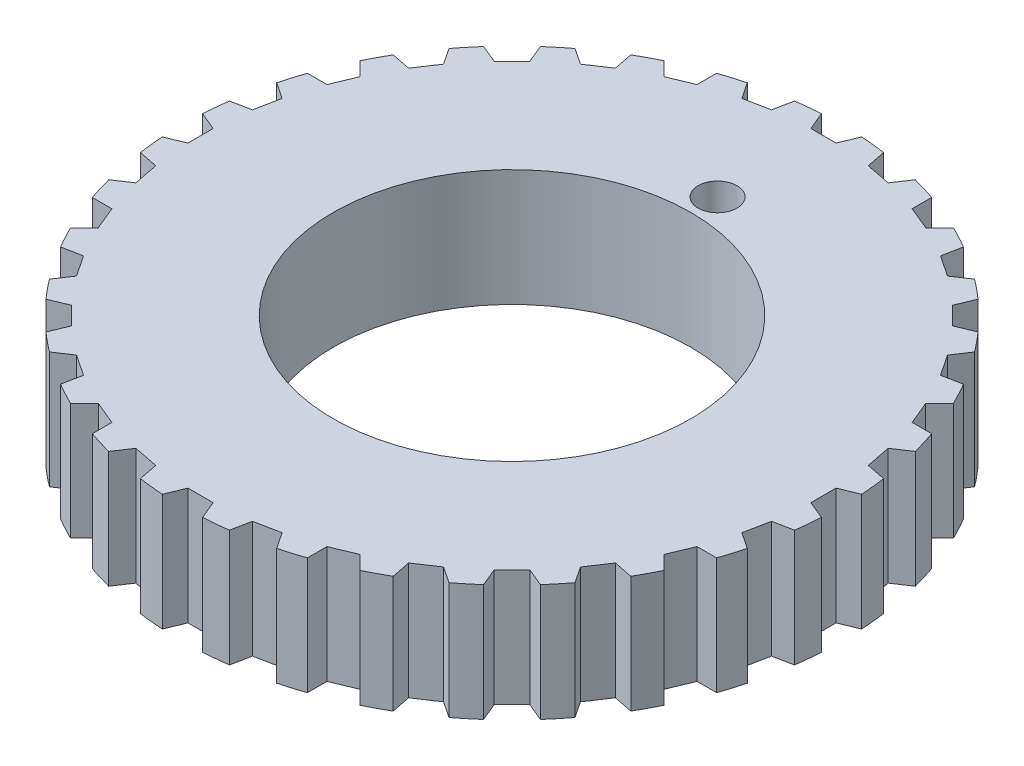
ISO-10303-21;
HEADER;
FILE_DESCRIPTION(('STEP AP214'),'2;1');
FILE_NAME('part.step','',(''),(''),'','','');
FILE_SCHEMA(('AUTOMOTIVE_DESIGN { 1 0 10303 214 1 1 1 1 }'));
ENDSEC;
DATA;
#1=APPLICATION_CONTEXT('core data for automotive mechanical design processes');
#2=APPLICATION_PROTOCOL_DEFINITION('international standard','automotive_design',2000,#1);
#3=PRODUCT_CONTEXT('',#1,'mechanical');
#4=PRODUCT('Part','Part','',(#3));
#5=PRODUCT_RELATED_PRODUCT_CATEGORY('part','',(#4));
#6=PRODUCT_DEFINITION_FORMATION('','',#4);
#7=PRODUCT_DEFINITION_CONTEXT('part definition',#1,'design');
#8=PRODUCT_DEFINITION('design','',#6,#7);
#9=PRODUCT_DEFINITION_SHAPE('','',#8);
#10=(LENGTH_UNIT() NAMED_UNIT(*) SI_UNIT(.MILLI.,.METRE.));
#11=(NAMED_UNIT(*) PLANE_ANGLE_UNIT() SI_UNIT($,.RADIAN.));
#12=(NAMED_UNIT(*) SI_UNIT($,.STERADIAN.) SOLID_ANGLE_UNIT());
#13=UNCERTAINTY_MEASURE_WITH_UNIT(LENGTH_MEASURE(1.E-05),#10,'distance_accuracy_value','');
#14=(GEOMETRIC_REPRESENTATION_CONTEXT(3) GLOBAL_UNCERTAINTY_ASSIGNED_CONTEXT((#13)) GLOBAL_UNIT_ASSIGNED_CONTEXT((#10,
#11,#12)) REPRESENTATION_CONTEXT('',''));
#15=CARTESIAN_POINT('',(0.,0.,0.));
#16=DIRECTION('',(0.,0.,1.));
#17=DIRECTION('',(1.,0.,0.));
#18=AXIS2_PLACEMENT_3D('',#15,#16,#17);
#19=CARTESIAN_POINT('',(0.,4.7625,0.));
#20=DIRECTION('',(0.,1.,0.));
#21=DIRECTION('',(0.,0.,1.));
#22=AXIS2_PLACEMENT_3D('',#19,#20,#21);
#23=PLANE('',#22);
#24=CARTESIAN_POINT('',(0.,4.7625,-8.382));
#25=DIRECTION('',(0.,1.,0.));
#26=DIRECTION('',(0.,0.,1.));
#27=AXIS2_PLACEMENT_3D('',#24,#25,#26);
#28=CIRCLE('',#27,0.79375);
#29=CARTESIAN_POINT('',(0.,4.7625,-7.58825));
#30=VERTEX_POINT('',#29);
#31=EDGE_CURVE('E2501',#30,#30,#28,.T.);
#32=ORIENTED_EDGE('',*,*,#31,.F.);
#33=EDGE_LOOP('',(#32));
#34=FACE_BOUND('',#33,.T.);
#35=CARTESIAN_POINT('',(0.,4.7625,0.));
#36=DIRECTION('',(0.,1.,0.));
#37=DIRECTION('',(0.,0.,1.));
#38=AXIS2_PLACEMENT_3D('',#35,#36,#37);
#39=CIRCLE('',#38,7.2898);
#40=CARTESIAN_POINT('',(0.,4.7625,-7.2898));
#41=VERTEX_POINT('',#40);
#42=EDGE_CURVE('E1496',#41,#41,#39,.T.);
#43=ORIENTED_EDGE('',*,*,#42,.F.);
#44=EDGE_LOOP('',(#43));
#45=FACE_BOUND('',#44,.T.);
#46=DIRECTION('',(0.195090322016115,0.,0.980785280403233));
#47=VECTOR('',#46,1.);
#48=CARTESIAN_POINT('',(12.55631776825,4.7625,-1.97318018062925));
#49=LINE('',#48,#47);
#50=CARTESIAN_POINT('',(12.3556283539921,4.7625,-2.98211399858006));
#51=VERTEX_POINT('',#50);
#52=CARTESIAN_POINT('',(12.55631776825,4.7625,-1.97318018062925));
#53=VERTEX_POINT('',#52);
#54=EDGE_CURVE('E824',#51,#53,#49,.T.);
#55=ORIENTED_EDGE('',*,*,#54,.F.);
#56=DIRECTION('',(-0.831469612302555,0.,0.555570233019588));
#57=VECTOR('',#56,1.);
#58=CARTESIAN_POINT('',(12.3556283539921,4.7625,-2.98211399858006));
#59=LINE('',#58,#57);
#60=CARTESIAN_POINT('',(13.0189333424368,4.7625,-3.42532022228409));
#61=VERTEX_POINT('',#60);
#62=EDGE_CURVE('E817',#61,#51,#59,.T.);
#63=ORIENTED_EDGE('',*,*,#62,.F.);
#64=CARTESIAN_POINT('',(0.,4.7625,0.));
#65=DIRECTION('',(0.,1.,0.));
#66=DIRECTION('',(0.,0.,1.));
#67=AXIS2_PLACEMENT_3D('',#64,#65,#66);
#68=CIRCLE('',#67,13.462);
#69=CARTESIAN_POINT('',(12.7278534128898,4.7625,-4.38488215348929));
#70=VERTEX_POINT('',#69);
#71=EDGE_CURVE('E54',#61,#70,#68,.T.);
#72=ORIENTED_EDGE('',*,*,#71,.T.);
#73=DIRECTION('',(1.,0.,0.));
#74=VECTOR('',#73,1.);
#75=CARTESIAN_POINT('',(13.3047413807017,4.7625,-4.38488215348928));
#76=LINE('',#75,#74);
#77=CARTESIAN_POINT('',(11.9301032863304,4.7625,-4.3848821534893));
#78=VERTEX_POINT('',#77);
#79=EDGE_CURVE('E851',#78,#70,#76,.T.);
#80=ORIENTED_EDGE('',*,*,#79,.F.);
#81=DIRECTION('',(0.382683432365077,0.,0.923879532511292));
#82=VECTOR('',#81,1.);
#83=CARTESIAN_POINT('',(11.9301032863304,4.7625,-4.3848821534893));
#84=LINE('',#83,#82);
#85=CARTESIAN_POINT('',(11.5364368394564,4.7625,-5.33527702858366));
#86=VERTEX_POINT('',#85);
#87=EDGE_CURVE('E848',#86,#78,#84,.T.);
#88=ORIENTED_EDGE('',*,*,#87,.F.);
#89=DIRECTION('',(-0.707106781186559,0.,0.707106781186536));
#90=VECTOR('',#89,1.);
#91=CARTESIAN_POINT('',(11.5364368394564,4.7625,-5.33527702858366));
#92=LINE('',#91,#90);
#93=CARTESIAN_POINT('',(12.100531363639,4.7625,-5.89937155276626));
#94=VERTEX_POINT('',#93);
#95=EDGE_CURVE('E846',#94,#86,#92,.T.);
#96=ORIENTED_EDGE('',*,*,#95,.F.);
#97=CARTESIAN_POINT('',(11.6278432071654,4.7625,-6.78370889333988));
#98=VERTEX_POINT('',#97);
#99=EDGE_CURVE('E1850',#94,#98,#68,.T.);
#100=ORIENTED_EDGE('',*,*,#99,.T.);
#101=DIRECTION('',(0.980785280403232,0.,-0.195090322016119));
#102=VECTOR('',#101,1.);
#103=CARTESIAN_POINT('',(12.193646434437,4.7625,-6.89625415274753));
#104=LINE('',#103,#102);
#105=CARTESIAN_POINT('',(10.845421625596,4.7625,-6.628075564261));
#106=VERTEX_POINT('',#105);
#107=EDGE_CURVE('E871',#106,#98,#104,.T.);
#108=ORIENTED_EDGE('',*,*,#107,.F.);
#109=DIRECTION('',(0.555570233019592,0.,0.831469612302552));
#110=VECTOR('',#109,1.);
#111=CARTESIAN_POINT('',(10.845421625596,4.7625,-6.628075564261));
#112=LINE('',#111,#110);
#113=CARTESIAN_POINT('',(10.2739065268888,4.7625,-7.48340835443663));
#114=VERTEX_POINT('',#113);
#115=EDGE_CURVE('E868',#114,#106,#112,.T.);
#116=ORIENTED_EDGE('',*,*,#115,.F.);
#117=DIRECTION('',(-0.555570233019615,0.,0.831469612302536));
#118=VECTOR('',#117,1.);
#119=CARTESIAN_POINT('',(10.2739065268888,4.7625,-7.48340835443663));
#120=LINE('',#119,#118);
#121=CARTESIAN_POINT('',(10.7171127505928,4.7625,-8.14671334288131));
#122=VERTEX_POINT('',#121);
#123=EDGE_CURVE('E866',#122,#114,#120,.T.);
#124=ORIENTED_EDGE('',*,*,#123,.F.);
#125=CARTESIAN_POINT('',(10.0809815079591,4.7625,-8.92184150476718));
#126=VERTEX_POINT('',#125);
#127=EDGE_CURVE('E1852',#122,#126,#68,.T.);
#128=ORIENTED_EDGE('',*,*,#127,.T.);
#129=DIRECTION('',(0.92387953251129,0.,-0.382683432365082));
#130=VECTOR('',#129,1.);
#131=CARTESIAN_POINT('',(10.6139564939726,4.7625,-9.14260697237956));
#132=LINE('',#131,#130);
#133=CARTESIAN_POINT('',(9.34395649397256,4.7625,-8.61655574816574));
#134=VERTEX_POINT('',#133);
#135=EDGE_CURVE('E892',#134,#126,#132,.T.);
#136=ORIENTED_EDGE('',*,*,#135,.F.);
#137=DIRECTION('',(0.707106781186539,0.,0.707106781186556));
#138=VECTOR('',#137,1.);
#139=CARTESIAN_POINT('',(9.34395649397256,4.7625,-8.61655574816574));
#140=LINE('',#139,#138);
#141=CARTESIAN_POINT('',(8.61655574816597,4.7625,-9.34395649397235));
#142=VERTEX_POINT('',#141);
#143=EDGE_CURVE('E889',#142,#134,#140,.T.);
#144=ORIENTED_EDGE('',*,*,#143,.F.);
#145=DIRECTION('',(-0.382683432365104,0.,0.923879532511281));
#146=VECTOR('',#145,1.);
#147=CARTESIAN_POINT('',(8.61655574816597,4.7625,-9.34395649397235));
#148=LINE('',#147,#146);
#149=CARTESIAN_POINT('',(8.92184150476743,4.7625,-10.0809815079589));
#150=VERTEX_POINT('',#149);
#151=EDGE_CURVE('E887',#150,#142,#148,.T.);
#152=ORIENTED_EDGE('',*,*,#151,.F.);
#153=CARTESIAN_POINT('',(8.14671334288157,4.7625,-10.7171127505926));
#154=VERTEX_POINT('',#153);
#155=EDGE_CURVE('E1853',#150,#154,#68,.T.);
#156=ORIENTED_EDGE('',*,*,#155,.T.);
#157=DIRECTION('',(0.83146961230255,0.,-0.555570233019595));
#158=VECTOR('',#157,1.);
#159=CARTESIAN_POINT('',(8.62637815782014,4.7625,-11.0376145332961));
#160=LINE('',#159,#158);
#161=CARTESIAN_POINT('',(7.48340835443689,4.7625,-10.2739065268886));
#162=VERTEX_POINT('',#161);
#163=EDGE_CURVE('E913',#162,#154,#160,.T.);
#164=ORIENTED_EDGE('',*,*,#163,.F.);
#165=DIRECTION('',(0.831469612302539,0.,0.555570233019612));
#166=VECTOR('',#165,1.);
#167=CARTESIAN_POINT('',(7.48340835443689,4.7625,-10.2739065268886));
#168=LINE('',#167,#166);
#169=CARTESIAN_POINT('',(6.62807556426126,4.7625,-10.8454216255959));
#170=VERTEX_POINT('',#169);
#171=EDGE_CURVE('E910',#170,#162,#168,.T.);
#172=ORIENTED_EDGE('',*,*,#171,.F.);
#173=DIRECTION('',(-0.195090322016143,0.,0.980785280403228));
#174=VECTOR('',#173,1.);
#175=CARTESIAN_POINT('',(6.62807556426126,4.7625,-10.8454216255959));
#176=LINE('',#175,#174);
#177=CARTESIAN_POINT('',(6.78370889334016,4.7625,-11.6278432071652));
#178=VERTEX_POINT('',#177);
#179=EDGE_CURVE('E908',#178,#170,#176,.T.);
#180=ORIENTED_EDGE('',*,*,#179,.F.);
#181=CARTESIAN_POINT('',(5.89937155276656,4.7625,-12.1005313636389));
#182=VERTEX_POINT('',#181);
#183=EDGE_CURVE('E1857',#178,#182,#68,.T.);
#184=ORIENTED_EDGE('',*,*,#183,.T.);
#185=DIRECTION('',(0.707106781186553,0.,-0.707106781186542));
#186=VECTOR('',#185,1.);
#187=CARTESIAN_POINT('',(6.30729294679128,4.7625,-12.5084527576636));
#188=LINE('',#187,#186);
#189=CARTESIAN_POINT('',(5.33527702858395,4.7625,-11.5364368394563));
#190=VERTEX_POINT('',#189);
#191=EDGE_CURVE('E934',#190,#182,#188,.T.);
#192=ORIENTED_EDGE('',*,*,#191,.F.);
#193=DIRECTION('',(0.923879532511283,0.,0.3826834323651));
#194=VECTOR('',#193,1.);
#195=CARTESIAN_POINT('',(5.33527702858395,4.7625,-11.5364368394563));
#196=LINE('',#195,#194);
#197=CARTESIAN_POINT('',(4.38488215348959,4.7625,-11.9301032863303));
#198=VERTEX_POINT('',#197);
#199=EDGE_CURVE('E931',#198,#190,#196,.T.);
#200=ORIENTED_EDGE('',*,*,#199,.F.);
#201=DIRECTION('',(0.,0.,1.));
#202=VECTOR('',#201,1.);
#203=CARTESIAN_POINT('',(4.38488215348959,4.7625,-11.9301032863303));
#204=LINE('',#203,#202);
#205=CARTESIAN_POINT('',(4.3848821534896,4.7625,-12.7278534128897));
#206=VERTEX_POINT('',#205);
#207=EDGE_CURVE('E929',#206,#198,#204,.T.);
#208=ORIENTED_EDGE('',*,*,#207,.F.);
#209=CARTESIAN_POINT('',(3.42532022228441,4.7625,-13.0189333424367));
#210=VERTEX_POINT('',#209);
#211=EDGE_CURVE('E1861',#206,#210,#68,.T.);
#212=ORIENTED_EDGE('',*,*,#211,.T.);
#213=DIRECTION('',(0.555570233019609,0.,-0.831469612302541));
#214=VECTOR('',#213,1.);
#215=CARTESIAN_POINT('',(3.74582200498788,4.7625,-13.4985981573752));
#216=LINE('',#215,#214);
#217=CARTESIAN_POINT('',(2.98211399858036,4.7625,-12.355628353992));
#218=VERTEX_POINT('',#217);
#219=EDGE_CURVE('E955',#218,#210,#216,.T.);
#220=ORIENTED_EDGE('',*,*,#219,.F.);
#221=DIRECTION('',(0.980785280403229,0.,0.195090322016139));
#222=VECTOR('',#221,1.);
#223=CARTESIAN_POINT('',(2.98211399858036,4.7625,-12.355628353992));
#224=LINE('',#223,#222);
#225=CARTESIAN_POINT('',(1.97318018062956,4.7625,-12.55631776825));
#226=VERTEX_POINT('',#225);
#227=EDGE_CURVE('E952',#226,#218,#224,.T.);
#228=ORIENTED_EDGE('',*,*,#227,.F.);
#229=DIRECTION('',(0.195090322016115,0.,0.980785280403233));
#230=VECTOR('',#229,1.);
#231=CARTESIAN_POINT('',(1.97318018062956,4.7625,-12.55631776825));
#232=LINE('',#231,#230);
#233=CARTESIAN_POINT('',(1.81754685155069,4.7625,-13.3387393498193));
#234=VERTEX_POINT('',#233);
#235=EDGE_CURVE('E950',#234,#226,#232,.T.);
#236=ORIENTED_EDGE('',*,*,#235,.F.);
#237=CARTESIAN_POINT('',(0.819635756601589,4.7625,-13.4370250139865));
#238=VERTEX_POINT('',#237);
#239=EDGE_CURVE('E1865',#234,#238,#68,.T.);
#240=ORIENTED_EDGE('',*,*,#239,.T.);
#241=DIRECTION('',(0.382683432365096,0.,-0.923879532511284));
#242=VECTOR('',#241,1.);
#243=CARTESIAN_POINT('',(1.04040122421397,4.7625,-13.97));
#244=LINE('',#243,#242);
#245=CARTESIAN_POINT('',(0.514350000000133,4.7625,-12.7));
#246=VERTEX_POINT('',#245);
#247=EDGE_CURVE('E976',#246,#238,#244,.T.);
#248=ORIENTED_EDGE('',*,*,#247,.F.);
#249=DIRECTION('',(1.,0.,0.));
#250=VECTOR('',#249,1.);
#251=CARTESIAN_POINT('',(0.514350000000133,4.7625,-12.7));
#252=LINE('',#251,#250);
#253=CARTESIAN_POINT('',(-0.514349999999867,4.7625,-12.7));
#254=VERTEX_POINT('',#253);
#255=EDGE_CURVE('E973',#254,#246,#252,.T.);
#256=ORIENTED_EDGE('',*,*,#255,.F.);
#257=DIRECTION('',(0.382683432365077,0.,0.923879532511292));
#258=VECTOR('',#257,1.);
#259=CARTESIAN_POINT('',(-0.514349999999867,4.7625,-12.7));
#260=LINE('',#259,#258);
#261=CARTESIAN_POINT('',(-0.819635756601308,4.7625,-13.4370250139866));
#262=VERTEX_POINT('',#261);
#263=EDGE_CURVE('E971',#262,#254,#260,.T.);
#264=ORIENTED_EDGE('',*,*,#263,.F.);
#265=CARTESIAN_POINT('',(-1.8175468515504,4.7625,-13.3387393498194));
#266=VERTEX_POINT('',#265);
#267=EDGE_CURVE('E1869',#262,#266,#68,.T.);
#268=ORIENTED_EDGE('',*,*,#267,.T.);
#269=DIRECTION('',(0.195090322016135,0.,-0.980785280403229));
#270=VECTOR('',#269,1.);
#271=CARTESIAN_POINT('',(-1.70500159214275,4.7625,-13.904542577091));
#272=LINE('',#271,#270);
#273=CARTESIAN_POINT('',(-1.9731801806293,4.7625,-12.55631776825));
#274=VERTEX_POINT('',#273);
#275=EDGE_CURVE('E997',#274,#266,#272,.T.);
#276=ORIENTED_EDGE('',*,*,#275,.F.);
#277=DIRECTION('',(0.980785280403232,0.,-0.195090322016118));
#278=VECTOR('',#277,1.);
#279=CARTESIAN_POINT('',(-1.9731801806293,4.7625,-12.55631776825));
#280=LINE('',#279,#278);
#281=CARTESIAN_POINT('',(-2.9821139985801,4.7625,-12.3556283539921));
#282=VERTEX_POINT('',#281);
#283=EDGE_CURVE('E994',#282,#274,#280,.T.);
#284=ORIENTED_EDGE('',*,*,#283,.F.);
#285=DIRECTION('',(0.555570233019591,0.,0.831469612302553));
#286=VECTOR('',#285,1.);
#287=CARTESIAN_POINT('',(-2.9821139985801,4.7625,-12.3556283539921));
#288=LINE('',#287,#286);
#289=CARTESIAN_POINT('',(-3.42532022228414,4.7625,-13.0189333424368));
#290=VERTEX_POINT('',#289);
#291=EDGE_CURVE('E992',#290,#282,#288,.T.);
#292=ORIENTED_EDGE('',*,*,#291,.F.);
#293=CARTESIAN_POINT('',(-4.38488215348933,4.7625,-12.7278534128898));
#294=VERTEX_POINT('',#293);
#295=EDGE_CURVE('E1873',#290,#294,#68,.T.);
#296=ORIENTED_EDGE('',*,*,#295,.T.);
#297=DIRECTION('',(0.,0.,-1.));
#298=VECTOR('',#297,1.);
#299=CARTESIAN_POINT('',(-4.38488215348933,4.7625,-13.3047413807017));
#300=LINE('',#299,#298);
#301=CARTESIAN_POINT('',(-4.38488215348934,4.7625,-11.9301032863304));
#302=VERTEX_POINT('',#301);
#303=EDGE_CURVE('E1018',#302,#294,#300,.T.);
#304=ORIENTED_EDGE('',*,*,#303,.F.);
#305=DIRECTION('',(0.923879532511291,0.,-0.382683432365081));
#306=VECTOR('',#305,1.);
#307=CARTESIAN_POINT('',(-4.38488215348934,4.7625,-11.9301032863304));
#308=LINE('',#307,#306);
#309=CARTESIAN_POINT('',(-5.3352770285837,4.7625,-11.5364368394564));
#310=VERTEX_POINT('',#309);
#311=EDGE_CURVE('E1015',#310,#302,#308,.T.);
#312=ORIENTED_EDGE('',*,*,#311,.F.);
#313=DIRECTION('',(0.707106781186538,0.,0.707106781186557));
#314=VECTOR('',#313,1.);
#315=CARTESIAN_POINT('',(-5.3352770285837,4.7625,-11.5364368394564));
#316=LINE('',#315,#314);
#317=CARTESIAN_POINT('',(-5.8993715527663,4.7625,-12.100531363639));
#318=VERTEX_POINT('',#317);
#319=EDGE_CURVE('E1013',#318,#310,#316,.T.);
#320=ORIENTED_EDGE('',*,*,#319,.F.);
#321=CARTESIAN_POINT('',(-6.78370889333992,4.7625,-11.6278432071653));
#322=VERTEX_POINT('',#321);
#323=EDGE_CURVE('E1877',#318,#322,#68,.T.);
#324=ORIENTED_EDGE('',*,*,#323,.T.);
#325=DIRECTION('',(-0.195090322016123,0.,-0.980785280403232));
#326=VECTOR('',#325,1.);
#327=CARTESIAN_POINT('',(-6.89625415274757,4.7625,-12.193646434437));
#328=LINE('',#327,#326);
#329=CARTESIAN_POINT('',(-6.62807556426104,4.7625,-10.845421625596));
#330=VERTEX_POINT('',#329);
#331=EDGE_CURVE('E1039',#330,#322,#328,.T.);
#332=ORIENTED_EDGE('',*,*,#331,.F.);
#333=DIRECTION('',(0.83146961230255,0.,-0.555570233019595));
#334=VECTOR('',#333,1.);
#335=CARTESIAN_POINT('',(-6.62807556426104,4.7625,-10.845421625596));
#336=LINE('',#335,#334);
#337=CARTESIAN_POINT('',(-7.48340835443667,4.7625,-10.2739065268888));
#338=VERTEX_POINT('',#337);
#339=EDGE_CURVE('E1036',#338,#330,#336,.T.);
#340=ORIENTED_EDGE('',*,*,#339,.F.);
#341=DIRECTION('',(0.831469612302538,0.,0.555570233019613));
#342=VECTOR('',#341,1.);
#343=CARTESIAN_POINT('',(-7.48340835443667,4.7625,-10.2739065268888));
#344=LINE('',#343,#342);
#345=CARTESIAN_POINT('',(-8.14671334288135,4.7625,-10.7171127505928));
#346=VERTEX_POINT('',#345);
#347=EDGE_CURVE('E1034',#346,#338,#344,.T.);
#348=ORIENTED_EDGE('',*,*,#347,.F.);
#349=CARTESIAN_POINT('',(-8.92184150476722,4.7625,-10.0809815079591));
#350=VERTEX_POINT('',#349);
#351=EDGE_CURVE('E1881',#346,#350,#68,.T.);
#352=ORIENTED_EDGE('',*,*,#351,.T.);
#353=DIRECTION('',(-0.382683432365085,0.,-0.923879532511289));
#354=VECTOR('',#353,1.);
#355=CARTESIAN_POINT('',(-9.14260697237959,4.7625,-10.6139564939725));
#356=LINE('',#355,#354);
#357=CARTESIAN_POINT('',(-8.61655574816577,4.7625,-9.34395649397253));
#358=VERTEX_POINT('',#357);
#359=EDGE_CURVE('E1060',#358,#350,#356,.T.);
#360=ORIENTED_EDGE('',*,*,#359,.F.);
#361=DIRECTION('',(0.707106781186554,0.,-0.707106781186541));
#362=VECTOR('',#361,1.);
#363=CARTESIAN_POINT('',(-8.61655574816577,4.7625,-9.34395649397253));
#364=LINE('',#363,#362);
#365=CARTESIAN_POINT('',(-9.34395649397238,4.7625,-8.61655574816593));
#366=VERTEX_POINT('',#365);
#367=EDGE_CURVE('E1057',#366,#358,#364,.T.);
#368=ORIENTED_EDGE('',*,*,#367,.F.);
#369=DIRECTION('',(0.923879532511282,0.,0.382683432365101));
#370=VECTOR('',#369,1.);
#371=CARTESIAN_POINT('',(-9.34395649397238,4.7625,-8.61655574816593));
#372=LINE('',#371,#370);
#373=CARTESIAN_POINT('',(-10.0809815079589,4.7625,-8.92184150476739));
#374=VERTEX_POINT('',#373);
#375=EDGE_CURVE('E1055',#374,#366,#372,.T.);
#376=ORIENTED_EDGE('',*,*,#375,.F.);
#377=CARTESIAN_POINT('',(-10.7171127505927,4.7625,-8.14671334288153));
#378=VERTEX_POINT('',#377);
#379=EDGE_CURVE('E1885',#374,#378,#68,.T.);
#380=ORIENTED_EDGE('',*,*,#379,.T.);
#381=DIRECTION('',(-0.555570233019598,0.,-0.831469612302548));
#382=VECTOR('',#381,1.);
#383=CARTESIAN_POINT('',(-11.0376145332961,4.7625,-8.6263781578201));
#384=LINE('',#383,#382);
#385=CARTESIAN_POINT('',(-10.2739065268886,4.7625,-7.48340835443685));
#386=VERTEX_POINT('',#385);
#387=EDGE_CURVE('E1081',#386,#378,#384,.T.);
#388=ORIENTED_EDGE('',*,*,#387,.F.);
#389=DIRECTION('',(0.555570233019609,0.,-0.831469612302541));
#390=VECTOR('',#389,1.);
#391=CARTESIAN_POINT('',(-10.2739065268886,4.7625,-7.48340835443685));
#392=LINE('',#391,#390);
#393=CARTESIAN_POINT('',(-10.8454216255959,4.7625,-6.62807556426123));
#394=VERTEX_POINT('',#393);
#395=EDGE_CURVE('E1078',#394,#386,#392,.T.);
#396=ORIENTED_EDGE('',*,*,#395,.F.);
#397=DIRECTION('',(0.980785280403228,0.,0.19509032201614));
#398=VECTOR('',#397,1.);
#399=CARTESIAN_POINT('',(-10.8454216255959,4.7625,-6.62807556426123));
#400=LINE('',#399,#398);
#401=CARTESIAN_POINT('',(-11.6278432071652,4.7625,-6.78370889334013));
#402=VERTEX_POINT('',#401);
#403=EDGE_CURVE('E1076',#402,#394,#400,.T.);
#404=ORIENTED_EDGE('',*,*,#403,.F.);
#405=CARTESIAN_POINT('',(-12.1005313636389,4.7625,-5.89937155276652));
#406=VERTEX_POINT('',#405);
#407=EDGE_CURVE('E1889',#402,#406,#68,.T.);
#408=ORIENTED_EDGE('',*,*,#407,.T.);
#409=DIRECTION('',(-0.707106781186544,0.,-0.707106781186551));
#410=VECTOR('',#409,1.);
#411=CARTESIAN_POINT('',(-12.5084527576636,4.7625,-6.30729294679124));
#412=LINE('',#411,#410);
#413=CARTESIAN_POINT('',(-11.5364368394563,4.7625,-5.33527702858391));
#414=VERTEX_POINT('',#413);
#415=EDGE_CURVE('E1102',#414,#406,#412,.T.);
#416=ORIENTED_EDGE('',*,*,#415,.F.);
#417=DIRECTION('',(0.382683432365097,0.,-0.923879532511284));
#418=VECTOR('',#417,1.);
#419=CARTESIAN_POINT('',(-11.5364368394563,4.7625,-5.33527702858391));
#420=LINE('',#419,#418);
#421=CARTESIAN_POINT('',(-11.9301032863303,4.7625,-4.38488215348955));
#422=VERTEX_POINT('',#421);
#423=EDGE_CURVE('E1099',#422,#414,#420,.T.);
#424=ORIENTED_EDGE('',*,*,#423,.F.);
#425=DIRECTION('',(1.,0.,0.));
#426=VECTOR('',#425,1.);
#427=CARTESIAN_POINT('',(-11.9301032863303,4.7625,-4.38488215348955));
#428=LINE('',#427,#426);
#429=CARTESIAN_POINT('',(-12.7278534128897,4.7625,-4.38488215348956));
#430=VERTEX_POINT('',#429);
#431=EDGE_CURVE('E1097',#430,#422,#428,.T.);
#432=ORIENTED_EDGE('',*,*,#431,.F.);
#433=CARTESIAN_POINT('',(-13.0189333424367,4.7625,-3.42532022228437));
#434=VERTEX_POINT('',#433);
#435=EDGE_CURVE('E1893',#430,#434,#68,.T.);
#436=ORIENTED_EDGE('',*,*,#435,.T.);
#437=DIRECTION('',(-0.831469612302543,0.,-0.555570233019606));
#438=VECTOR('',#437,1.);
#439=CARTESIAN_POINT('',(-13.4985981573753,4.7625,-3.74582200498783));
#440=LINE('',#439,#438);
#441=CARTESIAN_POINT('',(-12.355628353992,4.7625,-2.98211399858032));
#442=VERTEX_POINT('',#441);
#443=EDGE_CURVE('E1123',#442,#434,#440,.T.);
#444=ORIENTED_EDGE('',*,*,#443,.F.);
#445=DIRECTION('',(0.195090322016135,0.,-0.980785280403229));
#446=VECTOR('',#445,1.);
#447=CARTESIAN_POINT('',(-12.355628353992,4.7625,-2.98211399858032));
#448=LINE('',#447,#446);
#449=CARTESIAN_POINT('',(-12.55631776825,4.7625,-1.97318018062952));
#450=VERTEX_POINT('',#449);
#451=EDGE_CURVE('E1120',#450,#442,#448,.T.);
#452=ORIENTED_EDGE('',*,*,#451,.F.);
#453=DIRECTION('',(0.980785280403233,0.,-0.195090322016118));
#454=VECTOR('',#453,1.);
#455=CARTESIAN_POINT('',(-12.55631776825,4.7625,-1.97318018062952));
#456=LINE('',#455,#454);
#457=CARTESIAN_POINT('',(-13.3387393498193,4.7625,-1.81754685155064));
#458=VERTEX_POINT('',#457);
#459=EDGE_CURVE('E1118',#458,#450,#456,.T.);
#460=ORIENTED_EDGE('',*,*,#459,.F.);
#461=CARTESIAN_POINT('',(-13.4370250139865,4.7625,-0.819635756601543));
#462=VERTEX_POINT('',#461);
#463=EDGE_CURVE('E1897',#458,#462,#68,.T.);
#464=ORIENTED_EDGE('',*,*,#463,.T.);
#465=DIRECTION('',(-0.923879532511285,0.,-0.382683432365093));
#466=VECTOR('',#465,1.);
#467=CARTESIAN_POINT('',(-13.97,4.7625,-1.04040122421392));
#468=LINE('',#467,#466);
#469=CARTESIAN_POINT('',(-12.7,4.7625,-0.514350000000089));
#470=VERTEX_POINT('',#469);
#471=EDGE_CURVE('E1144',#470,#462,#468,.T.);
#472=ORIENTED_EDGE('',*,*,#471,.F.);
#473=DIRECTION('',(0.,0.,-1.));
#474=VECTOR('',#473,1.);
#475=CARTESIAN_POINT('',(-12.7,4.7625,-0.514350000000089));
#476=LINE('',#475,#474);
#477=CARTESIAN_POINT('',(-12.7,4.7625,0.514349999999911));
#478=VERTEX_POINT('',#477);
#479=EDGE_CURVE('E1141',#478,#470,#476,.T.);
#480=ORIENTED_EDGE('',*,*,#479,.F.);
#481=DIRECTION('',(0.923879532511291,0.,-0.38268343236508));
#482=VECTOR('',#481,1.);
#483=CARTESIAN_POINT('',(-12.7,4.7625,0.514349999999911));
#484=LINE('',#483,#482);
#485=CARTESIAN_POINT('',(-13.4370250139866,4.7625,0.819635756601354));
#486=VERTEX_POINT('',#485);
#487=EDGE_CURVE('E1139',#486,#478,#484,.T.);
#488=ORIENTED_EDGE('',*,*,#487,.F.);
#489=CARTESIAN_POINT('',(-13.3387393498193,4.7625,1.81754685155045));
#490=VERTEX_POINT('',#489);
#491=EDGE_CURVE('E1901',#486,#490,#68,.T.);
#492=ORIENTED_EDGE('',*,*,#491,.T.);
#493=DIRECTION('',(-0.98078528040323,0.,-0.195090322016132));
#494=VECTOR('',#493,1.);
#495=CARTESIAN_POINT('',(-13.904542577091,4.7625,1.7050015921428));
#496=LINE('',#495,#494);
#497=CARTESIAN_POINT('',(-12.55631776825,4.7625,1.97318018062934));
#498=VERTEX_POINT('',#497);
#499=EDGE_CURVE('E1165',#498,#490,#496,.T.);
#500=ORIENTED_EDGE('',*,*,#499,.F.);
#501=DIRECTION('',(-0.195090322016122,0.,-0.980785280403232));
#502=VECTOR('',#501,1.);
#503=CARTESIAN_POINT('',(-12.55631776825,4.7625,1.97318018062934));
#504=LINE('',#503,#502);
#505=CARTESIAN_POINT('',(-12.355628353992,4.7625,2.98211399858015));
#506=VERTEX_POINT('',#505);
#507=EDGE_CURVE('E1162',#506,#498,#504,.T.);
#508=ORIENTED_EDGE('',*,*,#507,.F.);
#509=DIRECTION('',(0.831469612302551,0.,-0.555570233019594));
#510=VECTOR('',#509,1.);
#511=CARTESIAN_POINT('',(-12.355628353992,4.7625,2.98211399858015));
#512=LINE('',#511,#510);
#513=CARTESIAN_POINT('',(-13.0189333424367,4.7625,3.42532022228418));
#514=VERTEX_POINT('',#513);
#515=EDGE_CURVE('E1160',#514,#506,#512,.T.);
#516=ORIENTED_EDGE('',*,*,#515,.F.);
#517=CARTESIAN_POINT('',(-12.7278534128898,4.7625,4.38488215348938));
#518=VERTEX_POINT('',#517);
#519=EDGE_CURVE('E1905',#514,#518,#68,.T.);
#520=ORIENTED_EDGE('',*,*,#519,.T.);
#521=DIRECTION('',(-1.,0.,0.));
#522=VECTOR('',#521,1.);
#523=CARTESIAN_POINT('',(-13.3047413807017,4.7625,4.38488215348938));
#524=LINE('',#523,#522);
#525=CARTESIAN_POINT('',(-11.9301032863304,4.7625,4.38488215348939));
#526=VERTEX_POINT('',#525);
#527=EDGE_CURVE('E1186',#526,#518,#524,.T.);
#528=ORIENTED_EDGE('',*,*,#527,.F.);
#529=DIRECTION('',(-0.382683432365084,0.,-0.923879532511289));
#530=VECTOR('',#529,1.);
#531=CARTESIAN_POINT('',(-11.9301032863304,4.7625,4.38488215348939));
#532=LINE('',#531,#530);
#533=CARTESIAN_POINT('',(-11.5364368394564,4.7625,5.33527702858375));
#534=VERTEX_POINT('',#533);
#535=EDGE_CURVE('E1183',#534,#526,#532,.T.);
#536=ORIENTED_EDGE('',*,*,#535,.F.);
#537=DIRECTION('',(0.707106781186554,0.,-0.707106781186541));
#538=VECTOR('',#537,1.);
#539=CARTESIAN_POINT('',(-11.5364368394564,4.7625,5.33527702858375));
#540=LINE('',#539,#538);
#541=CARTESIAN_POINT('',(-12.100531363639,4.7625,5.89937155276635));
#542=VERTEX_POINT('',#541);
#543=EDGE_CURVE('E1181',#542,#534,#540,.T.);
#544=ORIENTED_EDGE('',*,*,#543,.F.);
#545=CARTESIAN_POINT('',(-11.6278432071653,4.7625,6.78370889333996));
#546=VERTEX_POINT('',#545);
#547=EDGE_CURVE('E1909',#542,#546,#68,.T.);
#548=ORIENTED_EDGE('',*,*,#547,.T.);
#549=DIRECTION('',(-0.980785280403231,0.,0.195090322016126));
#550=VECTOR('',#549,1.);
#551=CARTESIAN_POINT('',(-12.1936464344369,4.7625,6.89625415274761));
#552=LINE('',#551,#550);
#553=CARTESIAN_POINT('',(-10.845421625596,4.7625,6.62807556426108));
#554=VERTEX_POINT('',#553);
#555=EDGE_CURVE('E1207',#554,#546,#552,.T.);
#556=ORIENTED_EDGE('',*,*,#555,.F.);
#557=DIRECTION('',(-0.555570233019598,0.,-0.831469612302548));
#558=VECTOR('',#557,1.);
#559=CARTESIAN_POINT('',(-10.845421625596,4.7625,6.62807556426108));
#560=LINE('',#559,#558);
#561=CARTESIAN_POINT('',(-10.2739065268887,4.7625,7.48340835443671));
#562=VERTEX_POINT('',#561);
#563=EDGE_CURVE('E1204',#562,#554,#560,.T.);
#564=ORIENTED_EDGE('',*,*,#563,.F.);
#565=DIRECTION('',(0.55557023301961,0.,-0.83146961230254));
#566=VECTOR('',#565,1.);
#567=CARTESIAN_POINT('',(-10.2739065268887,4.7625,7.48340835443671));
#568=LINE('',#567,#566);
#569=CARTESIAN_POINT('',(-10.7171127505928,4.7625,8.14671334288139));
#570=VERTEX_POINT('',#569);
#571=EDGE_CURVE('E1202',#570,#562,#568,.T.);
#572=ORIENTED_EDGE('',*,*,#571,.F.);
#573=CARTESIAN_POINT('',(-10.0809815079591,4.7625,8.92184150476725));
#574=VERTEX_POINT('',#573);
#575=EDGE_CURVE('E1913',#570,#574,#68,.T.);
#576=ORIENTED_EDGE('',*,*,#575,.T.);
#577=DIRECTION('',(-0.923879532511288,0.,0.382683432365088));
#578=VECTOR('',#577,1.);
#579=CARTESIAN_POINT('',(-10.6139564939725,4.7625,9.14260697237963));
#580=LINE('',#579,#578);
#581=CARTESIAN_POINT('',(-9.3439564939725,4.7625,8.6165557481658));
#582=VERTEX_POINT('',#581);
#583=EDGE_CURVE('E1228',#582,#574,#580,.T.);
#584=ORIENTED_EDGE('',*,*,#583,.F.);
#585=DIRECTION('',(-0.707106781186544,0.,-0.707106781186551));
#586=VECTOR('',#585,1.);
#587=CARTESIAN_POINT('',(-9.3439564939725,4.7625,8.6165557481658));
#588=LINE('',#587,#586);
#589=CARTESIAN_POINT('',(-8.6165557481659,4.7625,9.34395649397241));
#590=VERTEX_POINT('',#589);
#591=EDGE_CURVE('E1225',#590,#582,#588,.T.);
#592=ORIENTED_EDGE('',*,*,#591,.F.);
#593=DIRECTION('',(0.382683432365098,0.,-0.923879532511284));
#594=VECTOR('',#593,1.);
#595=CARTESIAN_POINT('',(-8.6165557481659,4.7625,9.34395649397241));
#596=LINE('',#595,#594);
#597=CARTESIAN_POINT('',(-8.92184150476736,4.7625,10.080981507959));
#598=VERTEX_POINT('',#597);
#599=EDGE_CURVE('E1223',#598,#590,#596,.T.);
#600=ORIENTED_EDGE('',*,*,#599,.F.);
#601=CARTESIAN_POINT('',(-8.1467133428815,4.7625,10.7171127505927));
#602=VERTEX_POINT('',#601);
#603=EDGE_CURVE('E1917',#598,#602,#68,.T.);
#604=ORIENTED_EDGE('',*,*,#603,.T.);
#605=DIRECTION('',(-0.831469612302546,0.,0.555570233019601));
#606=VECTOR('',#605,1.);
#607=CARTESIAN_POINT('',(-8.62637815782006,4.7625,11.0376145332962));
#608=LINE('',#607,#606);
#609=CARTESIAN_POINT('',(-7.48340835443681,4.7625,10.2739065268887));
#610=VERTEX_POINT('',#609);
#611=EDGE_CURVE('E1249',#610,#602,#608,.T.);
#612=ORIENTED_EDGE('',*,*,#611,.F.);
#613=DIRECTION('',(-0.831469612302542,0.,-0.555570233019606));
#614=VECTOR('',#613,1.);
#615=CARTESIAN_POINT('',(-7.48340835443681,4.7625,10.2739065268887));
#616=LINE('',#615,#614);
#617=CARTESIAN_POINT('',(-6.62807556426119,4.7625,10.8454216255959));
#618=VERTEX_POINT('',#617);
#619=EDGE_CURVE('E1246',#618,#610,#616,.T.);
#620=ORIENTED_EDGE('',*,*,#619,.F.);
#621=DIRECTION('',(0.195090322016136,0.,-0.980785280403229));
#622=VECTOR('',#621,1.);
#623=CARTESIAN_POINT('',(-6.62807556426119,4.7625,10.8454216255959));
#624=LINE('',#623,#622);
#625=CARTESIAN_POINT('',(-6.78370889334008,4.7625,11.6278432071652));
#626=VERTEX_POINT('',#625);
#627=EDGE_CURVE('E1244',#626,#618,#624,.T.);
#628=ORIENTED_EDGE('',*,*,#627,.F.);
#629=CARTESIAN_POINT('',(-5.89937155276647,4.7625,12.1005313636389));
#630=VERTEX_POINT('',#629);
#631=EDGE_CURVE('E1921',#626,#630,#68,.T.);
#632=ORIENTED_EDGE('',*,*,#631,.T.);
#633=DIRECTION('',(-0.707106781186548,0.,0.707106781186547));
#634=VECTOR('',#633,1.);
#635=CARTESIAN_POINT('',(-6.3072929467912,4.7625,12.5084527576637));
#636=LINE('',#635,#634);
#637=CARTESIAN_POINT('',(-5.33527702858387,4.7625,11.5364368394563));
#638=VERTEX_POINT('',#637);
#639=EDGE_CURVE('E1270',#638,#630,#636,.T.);
#640=ORIENTED_EDGE('',*,*,#639,.F.);
#641=DIRECTION('',(-0.923879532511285,0.,-0.382683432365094));
#642=VECTOR('',#641,1.);
#643=CARTESIAN_POINT('',(-5.33527702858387,4.7625,11.5364368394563));
#644=LINE('',#643,#642);
#645=CARTESIAN_POINT('',(-4.38488215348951,4.7625,11.9301032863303));
#646=VERTEX_POINT('',#645);
#647=EDGE_CURVE('E1267',#646,#638,#644,.T.);
#648=ORIENTED_EDGE('',*,*,#647,.F.);
#649=DIRECTION('',(0.,0.,-1.));
#650=VECTOR('',#649,1.);
#651=CARTESIAN_POINT('',(-4.38488215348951,4.7625,11.9301032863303));
#652=LINE('',#651,#650);
#653=CARTESIAN_POINT('',(-4.38488215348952,4.7625,12.7278534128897));
#654=VERTEX_POINT('',#653);
#655=EDGE_CURVE('E1265',#654,#646,#652,.T.);
#656=ORIENTED_EDGE('',*,*,#655,.F.);
#657=CARTESIAN_POINT('',(-3.42532022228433,4.7625,13.0189333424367));
#658=VERTEX_POINT('',#657);
#659=EDGE_CURVE('E1925',#654,#658,#68,.T.);
#660=ORIENTED_EDGE('',*,*,#659,.T.);
#661=DIRECTION('',(-0.555570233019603,0.,0.831469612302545));
#662=VECTOR('',#661,1.);
#663=CARTESIAN_POINT('',(-3.74582200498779,4.7625,13.4985981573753));
#664=LINE('',#663,#662);
#665=CARTESIAN_POINT('',(-2.98211399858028,4.7625,12.355628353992));
#666=VERTEX_POINT('',#665);
#667=EDGE_CURVE('E1291',#666,#658,#664,.T.);
#668=ORIENTED_EDGE('',*,*,#667,.F.);
#669=DIRECTION('',(-0.98078528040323,0.,-0.195090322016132));
#670=VECTOR('',#669,1.);
#671=CARTESIAN_POINT('',(-2.98211399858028,4.7625,12.355628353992));
#672=LINE('',#671,#670);
#673=CARTESIAN_POINT('',(-1.97318018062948,4.7625,12.55631776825));
#674=VERTEX_POINT('',#673);
#675=EDGE_CURVE('E1288',#674,#666,#672,.T.);
#676=ORIENTED_EDGE('',*,*,#675,.F.);
#677=DIRECTION('',(-0.195090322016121,0.,-0.980785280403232));
#678=VECTOR('',#677,1.);
#679=CARTESIAN_POINT('',(-1.97318018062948,4.7625,12.55631776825));
#680=LINE('',#679,#678);
#681=CARTESIAN_POINT('',(-1.8175468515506,4.7625,13.3387393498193));
#682=VERTEX_POINT('',#681);
#683=EDGE_CURVE('E1286',#682,#674,#680,.T.);
#684=ORIENTED_EDGE('',*,*,#683,.F.);
#685=CARTESIAN_POINT('',(-0.819635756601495,4.7625,13.4370250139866));
#686=VERTEX_POINT('',#685);
#687=EDGE_CURVE('E1929',#682,#686,#68,.T.);
#688=ORIENTED_EDGE('',*,*,#687,.T.);
#689=DIRECTION('',(-0.38268343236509,0.,0.923879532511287));
#690=VECTOR('',#689,1.);
#691=CARTESIAN_POINT('',(-1.04040122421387,4.7625,13.97));
#692=LINE('',#691,#690);
#693=CARTESIAN_POINT('',(-0.514350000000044,4.7625,12.7));
#694=VERTEX_POINT('',#693);
#695=EDGE_CURVE('E1312',#694,#686,#692,.T.);
#696=ORIENTED_EDGE('',*,*,#695,.F.);
#697=DIRECTION('',(-1.,0.,0.));
#698=VECTOR('',#697,1.);
#699=CARTESIAN_POINT('',(-0.514350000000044,4.7625,12.7));
#700=LINE('',#699,#698);
#701=CARTESIAN_POINT('',(0.514349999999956,4.7625,12.7));
#702=VERTEX_POINT('',#701);
#703=EDGE_CURVE('E1309',#702,#694,#700,.T.);
#704=ORIENTED_EDGE('',*,*,#703,.F.);
#705=DIRECTION('',(-0.382683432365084,0.,-0.923879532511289));
#706=VECTOR('',#705,1.);
#707=CARTESIAN_POINT('',(0.514349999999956,4.7625,12.7));
#708=LINE('',#707,#706);
#709=CARTESIAN_POINT('',(0.819635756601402,4.7625,13.4370250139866));
#710=VERTEX_POINT('',#709);
#711=EDGE_CURVE('E1307',#710,#702,#708,.T.);
#712=ORIENTED_EDGE('',*,*,#711,.F.);
#713=CARTESIAN_POINT('',(1.8175468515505,4.7625,13.3387393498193));
#714=VERTEX_POINT('',#713);
#715=EDGE_CURVE('E1933',#710,#714,#68,.T.);
#716=ORIENTED_EDGE('',*,*,#715,.T.);
#717=DIRECTION('',(-0.195090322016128,0.,0.980785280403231));
#718=VECTOR('',#717,1.);
#719=CARTESIAN_POINT('',(1.70500159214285,4.7625,13.904542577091));
#720=LINE('',#719,#718);
#721=CARTESIAN_POINT('',(1.97318018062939,4.7625,12.55631776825));
#722=VERTEX_POINT('',#721);
#723=EDGE_CURVE('E1333',#722,#714,#720,.T.);
#724=ORIENTED_EDGE('',*,*,#723,.F.);
#725=DIRECTION('',(-0.980785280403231,0.,0.195090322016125));
#726=VECTOR('',#725,1.);
#727=CARTESIAN_POINT('',(1.97318018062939,4.7625,12.55631776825));
#728=LINE('',#727,#726);
#729=CARTESIAN_POINT('',(2.98211399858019,4.7625,12.355628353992));
#730=VERTEX_POINT('',#729);
#731=EDGE_CURVE('E1330',#730,#722,#728,.T.);
#732=ORIENTED_EDGE('',*,*,#731,.F.);
#733=DIRECTION('',(-0.555570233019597,0.,-0.831469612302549));
#734=VECTOR('',#733,1.);
#735=CARTESIAN_POINT('',(2.98211399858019,4.7625,12.355628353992));
#736=LINE('',#735,#734);
#737=CARTESIAN_POINT('',(3.42532022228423,4.7625,13.0189333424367));
#738=VERTEX_POINT('',#737);
#739=EDGE_CURVE('E1328',#738,#730,#736,.T.);
#740=ORIENTED_EDGE('',*,*,#739,.F.);
#741=CARTESIAN_POINT('',(4.38488215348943,4.7625,12.7278534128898));
#742=VERTEX_POINT('',#741);
#743=EDGE_CURVE('E1937',#738,#742,#68,.T.);
#744=ORIENTED_EDGE('',*,*,#743,.T.);
#745=DIRECTION('',(0.,0.,1.));
#746=VECTOR('',#745,1.);
#747=CARTESIAN_POINT('',(4.38488215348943,4.7625,13.3047413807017));
#748=LINE('',#747,#746);
#749=CARTESIAN_POINT('',(4.38488215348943,4.7625,11.9301032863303));
#750=VERTEX_POINT('',#749);
#751=EDGE_CURVE('E1354',#750,#742,#748,.T.);
#752=ORIENTED_EDGE('',*,*,#751,.F.);
#753=DIRECTION('',(-0.923879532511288,0.,0.382683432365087));
#754=VECTOR('',#753,1.);
#755=CARTESIAN_POINT('',(4.38488215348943,4.7625,11.9301032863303));
#756=LINE('',#755,#754);
#757=CARTESIAN_POINT('',(5.33527702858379,4.7625,11.5364368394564));
#758=VERTEX_POINT('',#757);
#759=EDGE_CURVE('E1351',#758,#750,#756,.T.);
#760=ORIENTED_EDGE('',*,*,#759,.F.);
#761=DIRECTION('',(-0.707106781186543,0.,-0.707106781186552));
#762=VECTOR('',#761,1.);
#763=CARTESIAN_POINT('',(5.33527702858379,4.7625,11.5364368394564));
#764=LINE('',#763,#762);
#765=CARTESIAN_POINT('',(5.89937155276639,4.7625,12.100531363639));
#766=VERTEX_POINT('',#765);
#767=EDGE_CURVE('E1349',#766,#758,#764,.T.);
#768=ORIENTED_EDGE('',*,*,#767,.F.);
#769=CARTESIAN_POINT('',(6.78370889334,4.7625,11.6278432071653));
#770=VERTEX_POINT('',#769);
#771=EDGE_CURVE('E1941',#766,#770,#68,.T.);
#772=ORIENTED_EDGE('',*,*,#771,.T.);
#773=DIRECTION('',(0.195090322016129,0.,0.98078528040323));
#774=VECTOR('',#773,1.);
#775=CARTESIAN_POINT('',(6.89625415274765,4.7625,12.1936464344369));
#776=LINE('',#775,#774);
#777=CARTESIAN_POINT('',(6.62807556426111,4.7625,10.845421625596));
#778=VERTEX_POINT('',#777);
#779=EDGE_CURVE('E1375',#778,#770,#776,.T.);
#780=ORIENTED_EDGE('',*,*,#779,.F.);
#781=DIRECTION('',(-0.831469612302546,0.,0.5555702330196));
#782=VECTOR('',#781,1.);
#783=CARTESIAN_POINT('',(6.62807556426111,4.7625,10.845421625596));
#784=LINE('',#783,#782);
#785=CARTESIAN_POINT('',(7.48340835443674,4.7625,10.2739065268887));
#786=VERTEX_POINT('',#785);
#787=EDGE_CURVE('E1372',#786,#778,#784,.T.);
#788=ORIENTED_EDGE('',*,*,#787,.F.);
#789=DIRECTION('',(-0.831469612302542,0.,-0.555570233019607));
#790=VECTOR('',#789,1.);
#791=CARTESIAN_POINT('',(7.48340835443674,4.7625,10.2739065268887));
#792=LINE('',#791,#790);
#793=CARTESIAN_POINT('',(8.14671334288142,4.7625,10.7171127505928));
#794=VERTEX_POINT('',#793);
#795=EDGE_CURVE('E1370',#794,#786,#792,.T.);
#796=ORIENTED_EDGE('',*,*,#795,.F.);
#797=CARTESIAN_POINT('',(8.92184150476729,4.7625,10.080981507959));
#798=VERTEX_POINT('',#797);
#799=EDGE_CURVE('E1945',#794,#798,#68,.T.);
#800=ORIENTED_EDGE('',*,*,#799,.T.);
#801=DIRECTION('',(0.382683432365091,0.,0.923879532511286));
#802=VECTOR('',#801,1.);
#803=CARTESIAN_POINT('',(9.14260697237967,4.7625,10.6139564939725));
#804=LINE('',#803,#802);
#805=CARTESIAN_POINT('',(8.61655574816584,4.7625,9.34395649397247));
#806=VERTEX_POINT('',#805);
#807=EDGE_CURVE('E1396',#806,#798,#804,.T.);
#808=ORIENTED_EDGE('',*,*,#807,.F.);
#809=DIRECTION('',(-0.707106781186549,0.,0.707106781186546));
#810=VECTOR('',#809,1.);
#811=CARTESIAN_POINT('',(8.61655574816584,4.7625,9.34395649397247));
#812=LINE('',#811,#810);
#813=CARTESIAN_POINT('',(9.34395649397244,4.7625,8.61655574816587));
#814=VERTEX_POINT('',#813);
#815=EDGE_CURVE('E1393',#814,#806,#812,.T.);
#816=ORIENTED_EDGE('',*,*,#815,.F.);
#817=DIRECTION('',(-0.923879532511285,0.,-0.382683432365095));
#818=VECTOR('',#817,1.);
#819=CARTESIAN_POINT('',(9.34395649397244,4.7625,8.61655574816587));
#820=LINE('',#819,#818);
#821=CARTESIAN_POINT('',(10.080981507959,4.7625,8.92184150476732));
#822=VERTEX_POINT('',#821);
#823=EDGE_CURVE('E1391',#822,#814,#820,.T.);
#824=ORIENTED_EDGE('',*,*,#823,.F.);
#825=CARTESIAN_POINT('',(10.7171127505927,4.7625,8.14671334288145));
#826=VERTEX_POINT('',#825);
#827=EDGE_CURVE('E1949',#822,#826,#68,.T.);
#828=ORIENTED_EDGE('',*,*,#827,.T.);
#829=DIRECTION('',(0.555570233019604,0.,0.831469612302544));
#830=VECTOR('',#829,1.);
#831=CARTESIAN_POINT('',(11.0376145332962,4.7625,8.62637815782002));
#832=LINE('',#831,#830);
#833=CARTESIAN_POINT('',(10.2739065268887,4.7625,7.48340835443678));
#834=VERTEX_POINT('',#833);
#835=EDGE_CURVE('E1417',#834,#826,#832,.T.);
#836=ORIENTED_EDGE('',*,*,#835,.F.);
#837=DIRECTION('',(-0.555570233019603,0.,0.831469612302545));
#838=VECTOR('',#837,1.);
#839=CARTESIAN_POINT('',(10.2739065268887,4.7625,7.48340835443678));
#840=LINE('',#839,#838);
#841=CARTESIAN_POINT('',(10.845421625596,4.7625,6.62807556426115));
#842=VERTEX_POINT('',#841);
#843=EDGE_CURVE('E1414',#842,#834,#840,.T.);
#844=ORIENTED_EDGE('',*,*,#843,.F.);
#845=DIRECTION('',(-0.98078528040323,0.,-0.195090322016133));
#846=VECTOR('',#845,1.);
#847=CARTESIAN_POINT('',(10.845421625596,4.7625,6.62807556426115));
#848=LINE('',#847,#846);
#849=CARTESIAN_POINT('',(11.6278432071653,4.7625,6.78370889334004));
#850=VERTEX_POINT('',#849);
#851=EDGE_CURVE('E1412',#850,#842,#848,.T.);
#852=ORIENTED_EDGE('',*,*,#851,.F.);
#853=CARTESIAN_POINT('',(12.100531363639,4.7625,5.89937155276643));
#854=VERTEX_POINT('',#853);
#855=EDGE_CURVE('E1953',#850,#854,#68,.T.);
#856=ORIENTED_EDGE('',*,*,#855,.T.);
#857=DIRECTION('',(0.707106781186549,0.,0.707106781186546));
#858=VECTOR('',#857,1.);
#859=CARTESIAN_POINT('',(12.5084527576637,4.7625,6.30729294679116));
#860=LINE('',#859,#858);
#861=CARTESIAN_POINT('',(11.5364368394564,4.7625,5.33527702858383));
#862=VERTEX_POINT('',#861);
#863=EDGE_CURVE('E1438',#862,#854,#860,.T.);
#864=ORIENTED_EDGE('',*,*,#863,.F.);
#865=DIRECTION('',(-0.382683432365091,0.,0.923879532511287));
#866=VECTOR('',#865,1.);
#867=CARTESIAN_POINT('',(11.5364368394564,4.7625,5.33527702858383));
#868=LINE('',#867,#866);
#869=CARTESIAN_POINT('',(11.9301032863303,4.7625,4.38488215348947));
#870=VERTEX_POINT('',#869);
#871=EDGE_CURVE('E1435',#870,#862,#868,.T.);
#872=ORIENTED_EDGE('',*,*,#871,.F.);
#873=DIRECTION('',(-1.,0.,0.));
#874=VECTOR('',#873,1.);
#875=CARTESIAN_POINT('',(11.9301032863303,4.7625,4.38488215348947));
#876=LINE('',#875,#874);
#877=CARTESIAN_POINT('',(12.7278534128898,4.7625,4.38488215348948));
#878=VERTEX_POINT('',#877);
#879=EDGE_CURVE('E1433',#878,#870,#876,.T.);
#880=ORIENTED_EDGE('',*,*,#879,.F.);
#881=CARTESIAN_POINT('',(13.0189333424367,4.7625,3.42532022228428));
#882=VERTEX_POINT('',#881);
#883=EDGE_CURVE('E1957',#878,#882,#68,.T.);
#884=ORIENTED_EDGE('',*,*,#883,.T.);
#885=DIRECTION('',(0.831469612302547,0.,0.5555702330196));
#886=VECTOR('',#885,1.);
#887=CARTESIAN_POINT('',(13.4985981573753,4.7625,3.74582200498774));
#888=LINE('',#887,#886);
#889=CARTESIAN_POINT('',(12.355628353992,4.7625,2.98211399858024));
#890=VERTEX_POINT('',#889);
#891=EDGE_CURVE('E1459',#890,#882,#888,.T.);
#892=ORIENTED_EDGE('',*,*,#891,.F.);
#893=DIRECTION('',(-0.195090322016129,0.,0.980785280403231));
#894=VECTOR('',#893,1.);
#895=CARTESIAN_POINT('',(12.355628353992,4.7625,2.98211399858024));
#896=LINE('',#895,#894);
#897=CARTESIAN_POINT('',(12.55631776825,4.7625,1.97318018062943));
#898=VERTEX_POINT('',#897);
#899=EDGE_CURVE('E1456',#898,#890,#896,.T.);
#900=ORIENTED_EDGE('',*,*,#899,.F.);
#901=DIRECTION('',(-0.980785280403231,0.,0.195090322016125));
#902=VECTOR('',#901,1.);
#903=CARTESIAN_POINT('',(12.55631776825,4.7625,1.97318018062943));
#904=LINE('',#903,#902);
#905=CARTESIAN_POINT('',(13.3387393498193,4.7625,1.81754685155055));
#906=VERTEX_POINT('',#905);
#907=EDGE_CURVE('E1454',#906,#898,#904,.T.);
#908=ORIENTED_EDGE('',*,*,#907,.F.);
#909=CARTESIAN_POINT('',(13.4370250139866,4.7625,0.819635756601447));
#910=VERTEX_POINT('',#909);
#911=EDGE_CURVE('E1505',#906,#910,#68,.T.);
#912=ORIENTED_EDGE('',*,*,#911,.T.);
#913=DIRECTION('',(0.923879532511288,0.,0.382683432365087));
#914=VECTOR('',#913,1.);
#915=CARTESIAN_POINT('',(13.97,4.7625,1.04040122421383));
#916=LINE('',#915,#914);
#917=CARTESIAN_POINT('',(12.7,4.7625,0.51435));
#918=VERTEX_POINT('',#917);
#919=EDGE_CURVE('E1480',#918,#910,#916,.T.);
#920=ORIENTED_EDGE('',*,*,#919,.F.);
#921=DIRECTION('',(0.,0.,1.));
#922=VECTOR('',#921,1.);
#923=CARTESIAN_POINT('',(12.7,4.7625,0.51435));
#924=LINE('',#923,#922);
#925=CARTESIAN_POINT('',(12.7,4.7625,-0.51435));
#926=VERTEX_POINT('',#925);
#927=EDGE_CURVE('E1477',#926,#918,#924,.T.);
#928=ORIENTED_EDGE('',*,*,#927,.F.);
#929=DIRECTION('',(-0.923879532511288,0.,0.382683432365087));
#930=VECTOR('',#929,1.);
#931=CARTESIAN_POINT('',(12.7,4.7625,-0.51435));
#932=LINE('',#931,#930);
#933=CARTESIAN_POINT('',(13.4370250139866,4.7625,-0.819635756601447));
#934=VERTEX_POINT('',#933);
#935=EDGE_CURVE('E1475',#934,#926,#932,.T.);
#936=ORIENTED_EDGE('',*,*,#935,.F.);
#937=CARTESIAN_POINT('',(13.3387393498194,4.7625,-1.81754685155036));
#938=VERTEX_POINT('',#937);
#939=EDGE_CURVE('E1502',#934,#938,#68,.T.);
#940=ORIENTED_EDGE('',*,*,#939,.T.);
#941=DIRECTION('',(0.980785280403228,0.,0.195090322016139));
#942=VECTOR('',#941,1.);
#943=CARTESIAN_POINT('',(13.904542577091,4.7625,-1.7050015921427));
#944=LINE('',#943,#942);
#945=EDGE_CURVE('E46',#53,#938,#944,.T.);
#946=ORIENTED_EDGE('',*,*,#945,.F.);
#947=EDGE_LOOP('',(#55,#63,#72,#80,#88,#96,#100,#108,#116,#124,#128,#136,#144,#152,#156,#164,
#172,#180,#184,#192,#200,#208,#212,#220,#228,#236,#240,#248,#256,#264,#268,#276,#284,#292,#296,
#304,#312,#320,#324,#332,#340,#348,#352,#360,#368,#376,#380,#388,#396,#404,#408,#416,#424,#432,
#436,#444,#452,#460,#464,#472,#480,#488,#492,#500,#508,#516,#520,#528,#536,#544,#548,#556,#564,
#572,#576,#584,#592,#600,#604,#612,#620,#628,#632,#640,#648,#656,#660,#668,#676,#684,#688,#696,
#704,#712,#716,#724,#732,#740,#744,#752,#760,#768,#772,#780,#788,#796,#800,#808,#816,#824,#828,
#836,#844,#852,#856,#864,#872,#880,#884,#892,#900,#908,#912,#920,#928,#936,#940,#946));
#948=FACE_BOUND('',#947,.T.);
#949=ADVANCED_FACE('F31',(#34,#45,#948),#23,.T.);
#950=CARTESIAN_POINT('',(0.,0.,0.));
#951=DIRECTION('',(0.,1.,0.));
#952=DIRECTION('',(0.,0.,1.));
#953=AXIS2_PLACEMENT_3D('',#950,#951,#952);
#954=PLANE('',#953);
#955=CARTESIAN_POINT('',(0.,0.,-8.382));
#956=DIRECTION('',(0.,1.,0.));
#957=DIRECTION('',(0.,0.,1.));
#958=AXIS2_PLACEMENT_3D('',#955,#956,#957);
#959=CIRCLE('',#958,0.79375);
#960=CARTESIAN_POINT('',(0.,0.,-7.58825));
#961=VERTEX_POINT('',#960);
#962=EDGE_CURVE('E841',#961,#961,#959,.T.);
#963=ORIENTED_EDGE('',*,*,#962,.T.);
#964=EDGE_LOOP('',(#963));
#965=FACE_BOUND('',#964,.T.);
#966=CARTESIAN_POINT('',(0.,0.,0.));
#967=DIRECTION('',(0.,1.,0.));
#968=DIRECTION('',(0.,0.,1.));
#969=AXIS2_PLACEMENT_3D('',#966,#967,#968);
#970=CIRCLE('',#969,7.2898);
#971=CARTESIAN_POINT('',(0.,0.,-7.2898));
#972=VERTEX_POINT('',#971);
#973=EDGE_CURVE('E1495',#972,#972,#970,.T.);
#974=ORIENTED_EDGE('',*,*,#973,.T.);
#975=EDGE_LOOP('',(#974));
#976=FACE_BOUND('',#975,.T.);
#977=DIRECTION('',(-0.831469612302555,0.,0.555570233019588));
#978=VECTOR('',#977,1.);
#979=CARTESIAN_POINT('',(12.3556283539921,0.,-2.98211399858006));
#980=LINE('',#979,#978);
#981=CARTESIAN_POINT('',(13.0189333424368,0.,-3.42532022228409));
#982=VERTEX_POINT('',#981);
#983=CARTESIAN_POINT('',(12.3556283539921,0.,-2.98211399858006));
#984=VERTEX_POINT('',#983);
#985=EDGE_CURVE('E839',#982,#984,#980,.T.);
#986=ORIENTED_EDGE('',*,*,#985,.T.);
#987=DIRECTION('',(0.195090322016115,0.,0.980785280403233));
#988=VECTOR('',#987,1.);
#989=CARTESIAN_POINT('',(12.55631776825,0.,-1.97318018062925));
#990=LINE('',#989,#988);
#991=CARTESIAN_POINT('',(12.55631776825,0.,-1.97318018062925));
#992=VERTEX_POINT('',#991);
#993=EDGE_CURVE('E830',#984,#992,#990,.T.);
#994=ORIENTED_EDGE('',*,*,#993,.T.);
#995=DIRECTION('',(0.980785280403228,0.,0.195090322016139));
#996=VECTOR('',#995,1.);
#997=CARTESIAN_POINT('',(13.904542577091,0.,-1.7050015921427));
#998=LINE('',#997,#996);
#999=CARTESIAN_POINT('',(13.3387393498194,0.,-1.81754685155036));
#1000=VERTEX_POINT('',#999);
#1001=EDGE_CURVE('E825',#992,#1000,#998,.T.);
#1002=ORIENTED_EDGE('',*,*,#1001,.T.);
#1003=CARTESIAN_POINT('',(0.,0.,0.));
#1004=DIRECTION('',(0.,1.,0.));
#1005=DIRECTION('',(0.,0.,1.));
#1006=AXIS2_PLACEMENT_3D('',#1003,#1004,#1005);
#1007=CIRCLE('',#1006,13.462);
#1008=CARTESIAN_POINT('',(13.4370250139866,0.,-0.819635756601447));
#1009=VERTEX_POINT('',#1008);
#1010=EDGE_CURVE('E1506',#1009,#1000,#1007,.T.);
#1011=ORIENTED_EDGE('',*,*,#1010,.F.);
#1012=DIRECTION('',(-0.923879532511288,0.,0.382683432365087));
#1013=VECTOR('',#1012,1.);
#1014=CARTESIAN_POINT('',(12.7,0.,-0.51435));
#1015=LINE('',#1014,#1013);
#1016=CARTESIAN_POINT('',(12.7,0.,-0.51435));
#1017=VERTEX_POINT('',#1016);
#1018=EDGE_CURVE('E1474',#1009,#1017,#1015,.T.);
#1019=ORIENTED_EDGE('',*,*,#1018,.T.);
#1020=DIRECTION('',(0.,0.,1.));
#1021=VECTOR('',#1020,1.);
#1022=CARTESIAN_POINT('',(12.7,0.,0.51435));
#1023=LINE('',#1022,#1021);
#1024=CARTESIAN_POINT('',(12.7,0.,0.51435));
#1025=VERTEX_POINT('',#1024);
#1026=EDGE_CURVE('E1486',#1017,#1025,#1023,.T.);
#1027=ORIENTED_EDGE('',*,*,#1026,.T.);
#1028=DIRECTION('',(0.923879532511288,0.,0.382683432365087));
#1029=VECTOR('',#1028,1.);
#1030=CARTESIAN_POINT('',(13.97,0.,1.04040122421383));
#1031=LINE('',#1030,#1029);
#1032=CARTESIAN_POINT('',(13.4370250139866,0.,0.819635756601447));
#1033=VERTEX_POINT('',#1032);
#1034=EDGE_CURVE('E1478',#1025,#1033,#1031,.T.);
#1035=ORIENTED_EDGE('',*,*,#1034,.T.);
#1036=CARTESIAN_POINT('',(13.3387393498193,0.,1.81754685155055));
#1037=VERTEX_POINT('',#1036);
#1038=EDGE_CURVE('E1499',#1037,#1033,#1007,.T.);
#1039=ORIENTED_EDGE('',*,*,#1038,.F.);
#1040=DIRECTION('',(-0.980785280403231,0.,0.195090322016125));
#1041=VECTOR('',#1040,1.);
#1042=CARTESIAN_POINT('',(12.55631776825,0.,1.97318018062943));
#1043=LINE('',#1042,#1041);
#1044=CARTESIAN_POINT('',(12.55631776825,0.,1.97318018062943));
#1045=VERTEX_POINT('',#1044);
#1046=EDGE_CURVE('E1453',#1037,#1045,#1043,.T.);
#1047=ORIENTED_EDGE('',*,*,#1046,.T.);
#1048=DIRECTION('',(-0.195090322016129,0.,0.980785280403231));
#1049=VECTOR('',#1048,1.);
#1050=CARTESIAN_POINT('',(12.355628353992,0.,2.98211399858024));
#1051=LINE('',#1050,#1049);
#1052=CARTESIAN_POINT('',(12.355628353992,0.,2.98211399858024));
#1053=VERTEX_POINT('',#1052);
#1054=EDGE_CURVE('E1465',#1045,#1053,#1051,.T.);
#1055=ORIENTED_EDGE('',*,*,#1054,.T.);
#1056=DIRECTION('',(0.831469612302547,0.,0.5555702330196));
#1057=VECTOR('',#1056,1.);
#1058=CARTESIAN_POINT('',(13.4985981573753,0.,3.74582200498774));
#1059=LINE('',#1058,#1057);
#1060=CARTESIAN_POINT('',(13.0189333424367,0.,3.42532022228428));
#1061=VERTEX_POINT('',#1060);
#1062=EDGE_CURVE('E1457',#1053,#1061,#1059,.T.);
#1063=ORIENTED_EDGE('',*,*,#1062,.T.);
#1064=CARTESIAN_POINT('',(12.7278534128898,0.,4.38488215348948));
#1065=VERTEX_POINT('',#1064);
#1066=EDGE_CURVE('E1688',#1065,#1061,#1007,.T.);
#1067=ORIENTED_EDGE('',*,*,#1066,.F.);
#1068=DIRECTION('',(-1.,0.,0.));
#1069=VECTOR('',#1068,1.);
#1070=CARTESIAN_POINT('',(11.9301032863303,0.,4.38488215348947));
#1071=LINE('',#1070,#1069);
#1072=CARTESIAN_POINT('',(11.9301032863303,0.,4.38488215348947));
#1073=VERTEX_POINT('',#1072);
#1074=EDGE_CURVE('E1432',#1065,#1073,#1071,.T.);
#1075=ORIENTED_EDGE('',*,*,#1074,.T.);
#1076=DIRECTION('',(-0.382683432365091,0.,0.923879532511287));
#1077=VECTOR('',#1076,1.);
#1078=CARTESIAN_POINT('',(11.5364368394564,0.,5.33527702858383));
#1079=LINE('',#1078,#1077);
#1080=CARTESIAN_POINT('',(11.5364368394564,0.,5.33527702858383));
#1081=VERTEX_POINT('',#1080);
#1082=EDGE_CURVE('E1444',#1073,#1081,#1079,.T.);
#1083=ORIENTED_EDGE('',*,*,#1082,.T.);
#1084=DIRECTION('',(0.707106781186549,0.,0.707106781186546));
#1085=VECTOR('',#1084,1.);
#1086=CARTESIAN_POINT('',(12.5084527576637,0.,6.30729294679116));
#1087=LINE('',#1086,#1085);
#1088=CARTESIAN_POINT('',(12.100531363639,0.,5.89937155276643));
#1089=VERTEX_POINT('',#1088);
#1090=EDGE_CURVE('E1436',#1081,#1089,#1087,.T.);
#1091=ORIENTED_EDGE('',*,*,#1090,.T.);
#1092=CARTESIAN_POINT('',(11.6278432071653,0.,6.78370889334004));
#1093=VERTEX_POINT('',#1092);
#1094=EDGE_CURVE('E1689',#1093,#1089,#1007,.T.);
#1095=ORIENTED_EDGE('',*,*,#1094,.F.);
#1096=DIRECTION('',(-0.98078528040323,0.,-0.195090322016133));
#1097=VECTOR('',#1096,1.);
#1098=CARTESIAN_POINT('',(10.845421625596,0.,6.62807556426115));
#1099=LINE('',#1098,#1097);
#1100=CARTESIAN_POINT('',(10.845421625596,0.,6.62807556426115));
#1101=VERTEX_POINT('',#1100);
#1102=EDGE_CURVE('E1411',#1093,#1101,#1099,.T.);
#1103=ORIENTED_EDGE('',*,*,#1102,.T.);
#1104=DIRECTION('',(-0.555570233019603,0.,0.831469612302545));
#1105=VECTOR('',#1104,1.);
#1106=CARTESIAN_POINT('',(10.2739065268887,0.,7.48340835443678));
#1107=LINE('',#1106,#1105);
#1108=CARTESIAN_POINT('',(10.2739065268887,0.,7.48340835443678));
#1109=VERTEX_POINT('',#1108);
#1110=EDGE_CURVE('E1423',#1101,#1109,#1107,.T.);
#1111=ORIENTED_EDGE('',*,*,#1110,.T.);
#1112=DIRECTION('',(0.555570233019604,0.,0.831469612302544));
#1113=VECTOR('',#1112,1.);
#1114=CARTESIAN_POINT('',(11.0376145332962,0.,8.62637815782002));
#1115=LINE('',#1114,#1113);
#1116=CARTESIAN_POINT('',(10.7171127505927,0.,8.14671334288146));
#1117=VERTEX_POINT('',#1116);
#1118=EDGE_CURVE('E1415',#1109,#1117,#1115,.T.);
#1119=ORIENTED_EDGE('',*,*,#1118,.T.);
#1120=CARTESIAN_POINT('',(10.080981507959,0.,8.92184150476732));
#1121=VERTEX_POINT('',#1120);
#1122=EDGE_CURVE('E1694',#1121,#1117,#1007,.T.);
#1123=ORIENTED_EDGE('',*,*,#1122,.F.);
#1124=DIRECTION('',(-0.923879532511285,0.,-0.382683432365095));
#1125=VECTOR('',#1124,1.);
#1126=CARTESIAN_POINT('',(9.34395649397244,0.,8.61655574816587));
#1127=LINE('',#1126,#1125);
#1128=CARTESIAN_POINT('',(9.34395649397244,0.,8.61655574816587));
#1129=VERTEX_POINT('',#1128);
#1130=EDGE_CURVE('E1390',#1121,#1129,#1127,.T.);
#1131=ORIENTED_EDGE('',*,*,#1130,.T.);
#1132=DIRECTION('',(-0.707106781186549,0.,0.707106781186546));
#1133=VECTOR('',#1132,1.);
#1134=CARTESIAN_POINT('',(8.61655574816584,0.,9.34395649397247));
#1135=LINE('',#1134,#1133);
#1136=CARTESIAN_POINT('',(8.61655574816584,0.,9.34395649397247));
#1137=VERTEX_POINT('',#1136);
#1138=EDGE_CURVE('E1402',#1129,#1137,#1135,.T.);
#1139=ORIENTED_EDGE('',*,*,#1138,.T.);
#1140=DIRECTION('',(0.382683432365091,0.,0.923879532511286));
#1141=VECTOR('',#1140,1.);
#1142=CARTESIAN_POINT('',(9.14260697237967,0.,10.6139564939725));
#1143=LINE('',#1142,#1141);
#1144=CARTESIAN_POINT('',(8.92184150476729,0.,10.080981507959));
#1145=VERTEX_POINT('',#1144);
#1146=EDGE_CURVE('E1394',#1137,#1145,#1143,.T.);
#1147=ORIENTED_EDGE('',*,*,#1146,.T.);
#1148=CARTESIAN_POINT('',(8.14671334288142,0.,10.7171127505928));
#1149=VERTEX_POINT('',#1148);
#1150=EDGE_CURVE('E1699',#1149,#1145,#1007,.T.);
#1151=ORIENTED_EDGE('',*,*,#1150,.F.);
#1152=DIRECTION('',(-0.831469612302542,0.,-0.555570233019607));
#1153=VECTOR('',#1152,1.);
#1154=CARTESIAN_POINT('',(7.48340835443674,0.,10.2739065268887));
#1155=LINE('',#1154,#1153);
#1156=CARTESIAN_POINT('',(7.48340835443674,0.,10.2739065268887));
#1157=VERTEX_POINT('',#1156);
#1158=EDGE_CURVE('E1369',#1149,#1157,#1155,.T.);
#1159=ORIENTED_EDGE('',*,*,#1158,.T.);
#1160=DIRECTION('',(-0.831469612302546,0.,0.5555702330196));
#1161=VECTOR('',#1160,1.);
#1162=CARTESIAN_POINT('',(6.62807556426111,0.,10.845421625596));
#1163=LINE('',#1162,#1161);
#1164=CARTESIAN_POINT('',(6.62807556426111,0.,10.845421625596));
#1165=VERTEX_POINT('',#1164);
#1166=EDGE_CURVE('E1381',#1157,#1165,#1163,.T.);
#1167=ORIENTED_EDGE('',*,*,#1166,.T.);
#1168=DIRECTION('',(0.195090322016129,0.,0.98078528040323));
#1169=VECTOR('',#1168,1.);
#1170=CARTESIAN_POINT('',(6.89625415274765,0.,12.1936464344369));
#1171=LINE('',#1170,#1169);
#1172=CARTESIAN_POINT('',(6.78370889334,0.,11.6278432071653));
#1173=VERTEX_POINT('',#1172);
#1174=EDGE_CURVE('E1373',#1165,#1173,#1171,.T.);
#1175=ORIENTED_EDGE('',*,*,#1174,.T.);
#1176=CARTESIAN_POINT('',(5.89937155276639,0.,12.100531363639));
#1177=VERTEX_POINT('',#1176);
#1178=EDGE_CURVE('E1704',#1177,#1173,#1007,.T.);
#1179=ORIENTED_EDGE('',*,*,#1178,.F.);
#1180=DIRECTION('',(-0.707106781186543,0.,-0.707106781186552));
#1181=VECTOR('',#1180,1.);
#1182=CARTESIAN_POINT('',(5.33527702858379,0.,11.5364368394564));
#1183=LINE('',#1182,#1181);
#1184=CARTESIAN_POINT('',(5.33527702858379,0.,11.5364368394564));
#1185=VERTEX_POINT('',#1184);
#1186=EDGE_CURVE('E1348',#1177,#1185,#1183,.T.);
#1187=ORIENTED_EDGE('',*,*,#1186,.T.);
#1188=DIRECTION('',(-0.923879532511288,0.,0.382683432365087));
#1189=VECTOR('',#1188,1.);
#1190=CARTESIAN_POINT('',(4.38488215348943,0.,11.9301032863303));
#1191=LINE('',#1190,#1189);
#1192=CARTESIAN_POINT('',(4.38488215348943,0.,11.9301032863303));
#1193=VERTEX_POINT('',#1192);
#1194=EDGE_CURVE('E1360',#1185,#1193,#1191,.T.);
#1195=ORIENTED_EDGE('',*,*,#1194,.T.);
#1196=DIRECTION('',(0.,0.,1.));
#1197=VECTOR('',#1196,1.);
#1198=CARTESIAN_POINT('',(4.38488215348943,0.,13.3047413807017));
#1199=LINE('',#1198,#1197);
#1200=CARTESIAN_POINT('',(4.38488215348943,0.,12.7278534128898));
#1201=VERTEX_POINT('',#1200);
#1202=EDGE_CURVE('E1352',#1193,#1201,#1199,.T.);
#1203=ORIENTED_EDGE('',*,*,#1202,.T.);
#1204=CARTESIAN_POINT('',(3.42532022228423,0.,13.0189333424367));
#1205=VERTEX_POINT('',#1204);
#1206=EDGE_CURVE('E1709',#1205,#1201,#1007,.T.);
#1207=ORIENTED_EDGE('',*,*,#1206,.F.);
#1208=DIRECTION('',(-0.555570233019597,0.,-0.831469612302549));
#1209=VECTOR('',#1208,1.);
#1210=CARTESIAN_POINT('',(2.98211399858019,0.,12.355628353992));
#1211=LINE('',#1210,#1209);
#1212=CARTESIAN_POINT('',(2.98211399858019,0.,12.355628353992));
#1213=VERTEX_POINT('',#1212);
#1214=EDGE_CURVE('E1327',#1205,#1213,#1211,.T.);
#1215=ORIENTED_EDGE('',*,*,#1214,.T.);
#1216=DIRECTION('',(-0.980785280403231,0.,0.195090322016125));
#1217=VECTOR('',#1216,1.);
#1218=CARTESIAN_POINT('',(1.97318018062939,0.,12.55631776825));
#1219=LINE('',#1218,#1217);
#1220=CARTESIAN_POINT('',(1.97318018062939,0.,12.55631776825));
#1221=VERTEX_POINT('',#1220);
#1222=EDGE_CURVE('E1339',#1213,#1221,#1219,.T.);
#1223=ORIENTED_EDGE('',*,*,#1222,.T.);
#1224=DIRECTION('',(-0.195090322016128,0.,0.980785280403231));
#1225=VECTOR('',#1224,1.);
#1226=CARTESIAN_POINT('',(1.70500159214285,0.,13.904542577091));
#1227=LINE('',#1226,#1225);
#1228=CARTESIAN_POINT('',(1.8175468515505,0.,13.3387393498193));
#1229=VERTEX_POINT('',#1228);
#1230=EDGE_CURVE('E1331',#1221,#1229,#1227,.T.);
#1231=ORIENTED_EDGE('',*,*,#1230,.T.);
#1232=CARTESIAN_POINT('',(0.819635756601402,0.,13.4370250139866));
#1233=VERTEX_POINT('',#1232);
#1234=EDGE_CURVE('E1714',#1233,#1229,#1007,.T.);
#1235=ORIENTED_EDGE('',*,*,#1234,.F.);
#1236=DIRECTION('',(-0.382683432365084,0.,-0.923879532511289));
#1237=VECTOR('',#1236,1.);
#1238=CARTESIAN_POINT('',(0.514349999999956,0.,12.7));
#1239=LINE('',#1238,#1237);
#1240=CARTESIAN_POINT('',(0.514349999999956,0.,12.7));
#1241=VERTEX_POINT('',#1240);
#1242=EDGE_CURVE('E1306',#1233,#1241,#1239,.T.);
#1243=ORIENTED_EDGE('',*,*,#1242,.T.);
#1244=DIRECTION('',(-1.,0.,0.));
#1245=VECTOR('',#1244,1.);
#1246=CARTESIAN_POINT('',(-0.514350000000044,0.,12.7));
#1247=LINE('',#1246,#1245);
#1248=CARTESIAN_POINT('',(-0.514350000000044,0.,12.7));
#1249=VERTEX_POINT('',#1248);
#1250=EDGE_CURVE('E1318',#1241,#1249,#1247,.T.);
#1251=ORIENTED_EDGE('',*,*,#1250,.T.);
#1252=DIRECTION('',(-0.38268343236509,0.,0.923879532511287));
#1253=VECTOR('',#1252,1.);
#1254=CARTESIAN_POINT('',(-1.04040122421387,0.,13.97));
#1255=LINE('',#1254,#1253);
#1256=CARTESIAN_POINT('',(-0.819635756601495,0.,13.4370250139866));
#1257=VERTEX_POINT('',#1256);
#1258=EDGE_CURVE('E1310',#1249,#1257,#1255,.T.);
#1259=ORIENTED_EDGE('',*,*,#1258,.T.);
#1260=CARTESIAN_POINT('',(-1.8175468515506,0.,13.3387393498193));
#1261=VERTEX_POINT('',#1260);
#1262=EDGE_CURVE('E1719',#1261,#1257,#1007,.T.);
#1263=ORIENTED_EDGE('',*,*,#1262,.F.);
#1264=DIRECTION('',(-0.195090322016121,0.,-0.980785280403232));
#1265=VECTOR('',#1264,1.);
#1266=CARTESIAN_POINT('',(-1.97318018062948,0.,12.55631776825));
#1267=LINE('',#1266,#1265);
#1268=CARTESIAN_POINT('',(-1.97318018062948,0.,12.55631776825));
#1269=VERTEX_POINT('',#1268);
#1270=EDGE_CURVE('E1285',#1261,#1269,#1267,.T.);
#1271=ORIENTED_EDGE('',*,*,#1270,.T.);
#1272=DIRECTION('',(-0.98078528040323,0.,-0.195090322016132));
#1273=VECTOR('',#1272,1.);
#1274=CARTESIAN_POINT('',(-2.98211399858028,0.,12.355628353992));
#1275=LINE('',#1274,#1273);
#1276=CARTESIAN_POINT('',(-2.98211399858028,0.,12.355628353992));
#1277=VERTEX_POINT('',#1276);
#1278=EDGE_CURVE('E1297',#1269,#1277,#1275,.T.);
#1279=ORIENTED_EDGE('',*,*,#1278,.T.);
#1280=DIRECTION('',(-0.555570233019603,0.,0.831469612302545));
#1281=VECTOR('',#1280,1.);
#1282=CARTESIAN_POINT('',(-3.74582200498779,0.,13.4985981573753));
#1283=LINE('',#1282,#1281);
#1284=CARTESIAN_POINT('',(-3.42532022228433,0.,13.0189333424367));
#1285=VERTEX_POINT('',#1284);
#1286=EDGE_CURVE('E1289',#1277,#1285,#1283,.T.);
#1287=ORIENTED_EDGE('',*,*,#1286,.T.);
#1288=CARTESIAN_POINT('',(-4.38488215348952,0.,12.7278534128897));
#1289=VERTEX_POINT('',#1288);
#1290=EDGE_CURVE('E1724',#1289,#1285,#1007,.T.);
#1291=ORIENTED_EDGE('',*,*,#1290,.F.);
#1292=DIRECTION('',(0.,0.,-1.));
#1293=VECTOR('',#1292,1.);
#1294=CARTESIAN_POINT('',(-4.38488215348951,0.,11.9301032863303));
#1295=LINE('',#1294,#1293);
#1296=CARTESIAN_POINT('',(-4.38488215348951,0.,11.9301032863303));
#1297=VERTEX_POINT('',#1296);
#1298=EDGE_CURVE('E1264',#1289,#1297,#1295,.T.);
#1299=ORIENTED_EDGE('',*,*,#1298,.T.);
#1300=DIRECTION('',(-0.923879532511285,0.,-0.382683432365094));
#1301=VECTOR('',#1300,1.);
#1302=CARTESIAN_POINT('',(-5.33527702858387,0.,11.5364368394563));
#1303=LINE('',#1302,#1301);
#1304=CARTESIAN_POINT('',(-5.33527702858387,0.,11.5364368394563));
#1305=VERTEX_POINT('',#1304);
#1306=EDGE_CURVE('E1276',#1297,#1305,#1303,.T.);
#1307=ORIENTED_EDGE('',*,*,#1306,.T.);
#1308=DIRECTION('',(-0.707106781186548,0.,0.707106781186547));
#1309=VECTOR('',#1308,1.);
#1310=CARTESIAN_POINT('',(-6.3072929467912,0.,12.5084527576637));
#1311=LINE('',#1310,#1309);
#1312=CARTESIAN_POINT('',(-5.89937155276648,0.,12.1005313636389));
#1313=VERTEX_POINT('',#1312);
#1314=EDGE_CURVE('E1268',#1305,#1313,#1311,.T.);
#1315=ORIENTED_EDGE('',*,*,#1314,.T.);
#1316=CARTESIAN_POINT('',(-6.78370889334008,0.,11.6278432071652));
#1317=VERTEX_POINT('',#1316);
#1318=EDGE_CURVE('E1729',#1317,#1313,#1007,.T.);
#1319=ORIENTED_EDGE('',*,*,#1318,.F.);
#1320=DIRECTION('',(0.195090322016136,0.,-0.980785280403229));
#1321=VECTOR('',#1320,1.);
#1322=CARTESIAN_POINT('',(-6.62807556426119,0.,10.8454216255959));
#1323=LINE('',#1322,#1321);
#1324=CARTESIAN_POINT('',(-6.62807556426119,0.,10.8454216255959));
#1325=VERTEX_POINT('',#1324);
#1326=EDGE_CURVE('E1243',#1317,#1325,#1323,.T.);
#1327=ORIENTED_EDGE('',*,*,#1326,.T.);
#1328=DIRECTION('',(-0.831469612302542,0.,-0.555570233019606));
#1329=VECTOR('',#1328,1.);
#1330=CARTESIAN_POINT('',(-7.48340835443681,0.,10.2739065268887));
#1331=LINE('',#1330,#1329);
#1332=CARTESIAN_POINT('',(-7.48340835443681,0.,10.2739065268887));
#1333=VERTEX_POINT('',#1332);
#1334=EDGE_CURVE('E1255',#1325,#1333,#1331,.T.);
#1335=ORIENTED_EDGE('',*,*,#1334,.T.);
#1336=DIRECTION('',(-0.831469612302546,0.,0.555570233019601));
#1337=VECTOR('',#1336,1.);
#1338=CARTESIAN_POINT('',(-8.62637815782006,0.,11.0376145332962));
#1339=LINE('',#1338,#1337);
#1340=CARTESIAN_POINT('',(-8.1467133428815,0.,10.7171127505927));
#1341=VERTEX_POINT('',#1340);
#1342=EDGE_CURVE('E1247',#1333,#1341,#1339,.T.);
#1343=ORIENTED_EDGE('',*,*,#1342,.T.);
#1344=CARTESIAN_POINT('',(-8.92184150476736,0.,10.080981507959));
#1345=VERTEX_POINT('',#1344);
#1346=EDGE_CURVE('E1734',#1345,#1341,#1007,.T.);
#1347=ORIENTED_EDGE('',*,*,#1346,.F.);
#1348=DIRECTION('',(0.382683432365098,0.,-0.923879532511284));
#1349=VECTOR('',#1348,1.);
#1350=CARTESIAN_POINT('',(-8.6165557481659,0.,9.34395649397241));
#1351=LINE('',#1350,#1349);
#1352=CARTESIAN_POINT('',(-8.6165557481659,0.,9.34395649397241));
#1353=VERTEX_POINT('',#1352);
#1354=EDGE_CURVE('E1222',#1345,#1353,#1351,.T.);
#1355=ORIENTED_EDGE('',*,*,#1354,.T.);
#1356=DIRECTION('',(-0.707106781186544,0.,-0.707106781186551));
#1357=VECTOR('',#1356,1.);
#1358=CARTESIAN_POINT('',(-9.3439564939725,0.,8.6165557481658));
#1359=LINE('',#1358,#1357);
#1360=CARTESIAN_POINT('',(-9.3439564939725,0.,8.6165557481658));
#1361=VERTEX_POINT('',#1360);
#1362=EDGE_CURVE('E1234',#1353,#1361,#1359,.T.);
#1363=ORIENTED_EDGE('',*,*,#1362,.T.);
#1364=DIRECTION('',(-0.923879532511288,0.,0.382683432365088));
#1365=VECTOR('',#1364,1.);
#1366=CARTESIAN_POINT('',(-10.6139564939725,0.,9.14260697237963));
#1367=LINE('',#1366,#1365);
#1368=CARTESIAN_POINT('',(-10.0809815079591,0.,8.92184150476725));
#1369=VERTEX_POINT('',#1368);
#1370=EDGE_CURVE('E1226',#1361,#1369,#1367,.T.);
#1371=ORIENTED_EDGE('',*,*,#1370,.T.);
#1372=CARTESIAN_POINT('',(-10.7171127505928,0.,8.14671334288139));
#1373=VERTEX_POINT('',#1372);
#1374=EDGE_CURVE('E1739',#1373,#1369,#1007,.T.);
#1375=ORIENTED_EDGE('',*,*,#1374,.F.);
#1376=DIRECTION('',(0.55557023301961,0.,-0.83146961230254));
#1377=VECTOR('',#1376,1.);
#1378=CARTESIAN_POINT('',(-10.2739065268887,0.,7.48340835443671));
#1379=LINE('',#1378,#1377);
#1380=CARTESIAN_POINT('',(-10.2739065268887,0.,7.48340835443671));
#1381=VERTEX_POINT('',#1380);
#1382=EDGE_CURVE('E1201',#1373,#1381,#1379,.T.);
#1383=ORIENTED_EDGE('',*,*,#1382,.T.);
#1384=DIRECTION('',(-0.555570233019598,0.,-0.831469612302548));
#1385=VECTOR('',#1384,1.);
#1386=CARTESIAN_POINT('',(-10.845421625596,0.,6.62807556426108));
#1387=LINE('',#1386,#1385);
#1388=CARTESIAN_POINT('',(-10.845421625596,0.,6.62807556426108));
#1389=VERTEX_POINT('',#1388);
#1390=EDGE_CURVE('E1213',#1381,#1389,#1387,.T.);
#1391=ORIENTED_EDGE('',*,*,#1390,.T.);
#1392=DIRECTION('',(-0.980785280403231,0.,0.195090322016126));
#1393=VECTOR('',#1392,1.);
#1394=CARTESIAN_POINT('',(-12.1936464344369,0.,6.89625415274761));
#1395=LINE('',#1394,#1393);
#1396=CARTESIAN_POINT('',(-11.6278432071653,0.,6.78370889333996));
#1397=VERTEX_POINT('',#1396);
#1398=EDGE_CURVE('E1205',#1389,#1397,#1395,.T.);
#1399=ORIENTED_EDGE('',*,*,#1398,.T.);
#1400=CARTESIAN_POINT('',(-12.100531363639,0.,5.89937155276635));
#1401=VERTEX_POINT('',#1400);
#1402=EDGE_CURVE('E1744',#1401,#1397,#1007,.T.);
#1403=ORIENTED_EDGE('',*,*,#1402,.F.);
#1404=DIRECTION('',(0.707106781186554,0.,-0.707106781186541));
#1405=VECTOR('',#1404,1.);
#1406=CARTESIAN_POINT('',(-11.5364368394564,0.,5.33527702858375));
#1407=LINE('',#1406,#1405);
#1408=CARTESIAN_POINT('',(-11.5364368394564,0.,5.33527702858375));
#1409=VERTEX_POINT('',#1408);
#1410=EDGE_CURVE('E1180',#1401,#1409,#1407,.T.);
#1411=ORIENTED_EDGE('',*,*,#1410,.T.);
#1412=DIRECTION('',(-0.382683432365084,0.,-0.923879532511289));
#1413=VECTOR('',#1412,1.);
#1414=CARTESIAN_POINT('',(-11.9301032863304,0.,4.38488215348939));
#1415=LINE('',#1414,#1413);
#1416=CARTESIAN_POINT('',(-11.9301032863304,0.,4.38488215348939));
#1417=VERTEX_POINT('',#1416);
#1418=EDGE_CURVE('E1192',#1409,#1417,#1415,.T.);
#1419=ORIENTED_EDGE('',*,*,#1418,.T.);
#1420=DIRECTION('',(-1.,0.,0.));
#1421=VECTOR('',#1420,1.);
#1422=CARTESIAN_POINT('',(-13.3047413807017,0.,4.38488215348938));
#1423=LINE('',#1422,#1421);
#1424=CARTESIAN_POINT('',(-12.7278534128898,0.,4.38488215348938));
#1425=VERTEX_POINT('',#1424);
#1426=EDGE_CURVE('E1184',#1417,#1425,#1423,.T.);
#1427=ORIENTED_EDGE('',*,*,#1426,.T.);
#1428=CARTESIAN_POINT('',(-13.0189333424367,0.,3.42532022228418));
#1429=VERTEX_POINT('',#1428);
#1430=EDGE_CURVE('E1749',#1429,#1425,#1007,.T.);
#1431=ORIENTED_EDGE('',*,*,#1430,.F.);
#1432=DIRECTION('',(0.831469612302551,0.,-0.555570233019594));
#1433=VECTOR('',#1432,1.);
#1434=CARTESIAN_POINT('',(-12.355628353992,0.,2.98211399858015));
#1435=LINE('',#1434,#1433);
#1436=CARTESIAN_POINT('',(-12.355628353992,0.,2.98211399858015));
#1437=VERTEX_POINT('',#1436);
#1438=EDGE_CURVE('E1159',#1429,#1437,#1435,.T.);
#1439=ORIENTED_EDGE('',*,*,#1438,.T.);
#1440=DIRECTION('',(-0.195090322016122,0.,-0.980785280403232));
#1441=VECTOR('',#1440,1.);
#1442=CARTESIAN_POINT('',(-12.55631776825,0.,1.97318018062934));
#1443=LINE('',#1442,#1441);
#1444=CARTESIAN_POINT('',(-12.55631776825,0.,1.97318018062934));
#1445=VERTEX_POINT('',#1444);
#1446=EDGE_CURVE('E1171',#1437,#1445,#1443,.T.);
#1447=ORIENTED_EDGE('',*,*,#1446,.T.);
#1448=DIRECTION('',(-0.98078528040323,0.,-0.195090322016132));
#1449=VECTOR('',#1448,1.);
#1450=CARTESIAN_POINT('',(-13.904542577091,0.,1.7050015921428));
#1451=LINE('',#1450,#1449);
#1452=CARTESIAN_POINT('',(-13.3387393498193,0.,1.81754685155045));
#1453=VERTEX_POINT('',#1452);
#1454=EDGE_CURVE('E1163',#1445,#1453,#1451,.T.);
#1455=ORIENTED_EDGE('',*,*,#1454,.T.);
#1456=CARTESIAN_POINT('',(-13.4370250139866,0.,0.819635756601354));
#1457=VERTEX_POINT('',#1456);
#1458=EDGE_CURVE('E1754',#1457,#1453,#1007,.T.);
#1459=ORIENTED_EDGE('',*,*,#1458,.F.);
#1460=DIRECTION('',(0.923879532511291,0.,-0.38268343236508));
#1461=VECTOR('',#1460,1.);
#1462=CARTESIAN_POINT('',(-12.7,0.,0.514349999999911));
#1463=LINE('',#1462,#1461);
#1464=CARTESIAN_POINT('',(-12.7,0.,0.514349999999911));
#1465=VERTEX_POINT('',#1464);
#1466=EDGE_CURVE('E1138',#1457,#1465,#1463,.T.);
#1467=ORIENTED_EDGE('',*,*,#1466,.T.);
#1468=DIRECTION('',(0.,0.,-1.));
#1469=VECTOR('',#1468,1.);
#1470=CARTESIAN_POINT('',(-12.7,0.,-0.514350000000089));
#1471=LINE('',#1470,#1469);
#1472=CARTESIAN_POINT('',(-12.7,0.,-0.514350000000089));
#1473=VERTEX_POINT('',#1472);
#1474=EDGE_CURVE('E1150',#1465,#1473,#1471,.T.);
#1475=ORIENTED_EDGE('',*,*,#1474,.T.);
#1476=DIRECTION('',(-0.923879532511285,0.,-0.382683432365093));
#1477=VECTOR('',#1476,1.);
#1478=CARTESIAN_POINT('',(-13.97,0.,-1.04040122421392));
#1479=LINE('',#1478,#1477);
#1480=CARTESIAN_POINT('',(-13.4370250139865,0.,-0.819635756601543));
#1481=VERTEX_POINT('',#1480);
#1482=EDGE_CURVE('E1142',#1473,#1481,#1479,.T.);
#1483=ORIENTED_EDGE('',*,*,#1482,.T.);
#1484=CARTESIAN_POINT('',(-13.3387393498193,0.,-1.81754685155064));
#1485=VERTEX_POINT('',#1484);
#1486=EDGE_CURVE('E1759',#1485,#1481,#1007,.T.);
#1487=ORIENTED_EDGE('',*,*,#1486,.F.);
#1488=DIRECTION('',(0.980785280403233,0.,-0.195090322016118));
#1489=VECTOR('',#1488,1.);
#1490=CARTESIAN_POINT('',(-12.55631776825,0.,-1.97318018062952));
#1491=LINE('',#1490,#1489);
#1492=CARTESIAN_POINT('',(-12.55631776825,0.,-1.97318018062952));
#1493=VERTEX_POINT('',#1492);
#1494=EDGE_CURVE('E1117',#1485,#1493,#1491,.T.);
#1495=ORIENTED_EDGE('',*,*,#1494,.T.);
#1496=DIRECTION('',(0.195090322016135,0.,-0.980785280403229));
#1497=VECTOR('',#1496,1.);
#1498=CARTESIAN_POINT('',(-12.355628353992,0.,-2.98211399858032));
#1499=LINE('',#1498,#1497);
#1500=CARTESIAN_POINT('',(-12.355628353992,0.,-2.98211399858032));
#1501=VERTEX_POINT('',#1500);
#1502=EDGE_CURVE('E1129',#1493,#1501,#1499,.T.);
#1503=ORIENTED_EDGE('',*,*,#1502,.T.);
#1504=DIRECTION('',(-0.831469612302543,0.,-0.555570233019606));
#1505=VECTOR('',#1504,1.);
#1506=CARTESIAN_POINT('',(-13.4985981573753,0.,-3.74582200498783));
#1507=LINE('',#1506,#1505);
#1508=CARTESIAN_POINT('',(-13.0189333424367,0.,-3.42532022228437));
#1509=VERTEX_POINT('',#1508);
#1510=EDGE_CURVE('E1121',#1501,#1509,#1507,.T.);
#1511=ORIENTED_EDGE('',*,*,#1510,.T.);
#1512=CARTESIAN_POINT('',(-12.7278534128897,0.,-4.38488215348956));
#1513=VERTEX_POINT('',#1512);
#1514=EDGE_CURVE('E1764',#1513,#1509,#1007,.T.);
#1515=ORIENTED_EDGE('',*,*,#1514,.F.);
#1516=DIRECTION('',(1.,0.,0.));
#1517=VECTOR('',#1516,1.);
#1518=CARTESIAN_POINT('',(-11.9301032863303,0.,-4.38488215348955));
#1519=LINE('',#1518,#1517);
#1520=CARTESIAN_POINT('',(-11.9301032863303,0.,-4.38488215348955));
#1521=VERTEX_POINT('',#1520);
#1522=EDGE_CURVE('E1096',#1513,#1521,#1519,.T.);
#1523=ORIENTED_EDGE('',*,*,#1522,.T.);
#1524=DIRECTION('',(0.382683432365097,0.,-0.923879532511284));
#1525=VECTOR('',#1524,1.);
#1526=CARTESIAN_POINT('',(-11.5364368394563,0.,-5.33527702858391));
#1527=LINE('',#1526,#1525);
#1528=CARTESIAN_POINT('',(-11.5364368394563,0.,-5.33527702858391));
#1529=VERTEX_POINT('',#1528);
#1530=EDGE_CURVE('E1108',#1521,#1529,#1527,.T.);
#1531=ORIENTED_EDGE('',*,*,#1530,.T.);
#1532=DIRECTION('',(-0.707106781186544,0.,-0.707106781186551));
#1533=VECTOR('',#1532,1.);
#1534=CARTESIAN_POINT('',(-12.5084527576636,0.,-6.30729294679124));
#1535=LINE('',#1534,#1533);
#1536=CARTESIAN_POINT('',(-12.1005313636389,0.,-5.89937155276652));
#1537=VERTEX_POINT('',#1536);
#1538=EDGE_CURVE('E1100',#1529,#1537,#1535,.T.);
#1539=ORIENTED_EDGE('',*,*,#1538,.T.);
#1540=CARTESIAN_POINT('',(-11.6278432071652,0.,-6.78370889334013));
#1541=VERTEX_POINT('',#1540);
#1542=EDGE_CURVE('E1769',#1541,#1537,#1007,.T.);
#1543=ORIENTED_EDGE('',*,*,#1542,.F.);
#1544=DIRECTION('',(0.980785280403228,0.,0.19509032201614));
#1545=VECTOR('',#1544,1.);
#1546=CARTESIAN_POINT('',(-10.8454216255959,0.,-6.62807556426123));
#1547=LINE('',#1546,#1545);
#1548=CARTESIAN_POINT('',(-10.8454216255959,0.,-6.62807556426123));
#1549=VERTEX_POINT('',#1548);
#1550=EDGE_CURVE('E1075',#1541,#1549,#1547,.T.);
#1551=ORIENTED_EDGE('',*,*,#1550,.T.);
#1552=DIRECTION('',(0.555570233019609,0.,-0.831469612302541));
#1553=VECTOR('',#1552,1.);
#1554=CARTESIAN_POINT('',(-10.2739065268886,0.,-7.48340835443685));
#1555=LINE('',#1554,#1553);
#1556=CARTESIAN_POINT('',(-10.2739065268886,0.,-7.48340835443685));
#1557=VERTEX_POINT('',#1556);
#1558=EDGE_CURVE('E1087',#1549,#1557,#1555,.T.);
#1559=ORIENTED_EDGE('',*,*,#1558,.T.);
#1560=DIRECTION('',(-0.555570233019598,0.,-0.831469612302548));
#1561=VECTOR('',#1560,1.);
#1562=CARTESIAN_POINT('',(-11.0376145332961,0.,-8.6263781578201));
#1563=LINE('',#1562,#1561);
#1564=CARTESIAN_POINT('',(-10.7171127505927,0.,-8.14671334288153));
#1565=VERTEX_POINT('',#1564);
#1566=EDGE_CURVE('E1079',#1557,#1565,#1563,.T.);
#1567=ORIENTED_EDGE('',*,*,#1566,.T.);
#1568=CARTESIAN_POINT('',(-10.0809815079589,0.,-8.92184150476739));
#1569=VERTEX_POINT('',#1568);
#1570=EDGE_CURVE('E1774',#1569,#1565,#1007,.T.);
#1571=ORIENTED_EDGE('',*,*,#1570,.F.);
#1572=DIRECTION('',(0.923879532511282,0.,0.382683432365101));
#1573=VECTOR('',#1572,1.);
#1574=CARTESIAN_POINT('',(-9.34395649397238,0.,-8.61655574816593));
#1575=LINE('',#1574,#1573);
#1576=CARTESIAN_POINT('',(-9.34395649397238,0.,-8.61655574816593));
#1577=VERTEX_POINT('',#1576);
#1578=EDGE_CURVE('E1054',#1569,#1577,#1575,.T.);
#1579=ORIENTED_EDGE('',*,*,#1578,.T.);
#1580=DIRECTION('',(0.707106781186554,0.,-0.707106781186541));
#1581=VECTOR('',#1580,1.);
#1582=CARTESIAN_POINT('',(-8.61655574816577,0.,-9.34395649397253));
#1583=LINE('',#1582,#1581);
#1584=CARTESIAN_POINT('',(-8.61655574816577,0.,-9.34395649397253));
#1585=VERTEX_POINT('',#1584);
#1586=EDGE_CURVE('E1066',#1577,#1585,#1583,.T.);
#1587=ORIENTED_EDGE('',*,*,#1586,.T.);
#1588=DIRECTION('',(-0.382683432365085,0.,-0.923879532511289));
#1589=VECTOR('',#1588,1.);
#1590=CARTESIAN_POINT('',(-9.14260697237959,0.,-10.6139564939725));
#1591=LINE('',#1590,#1589);
#1592=CARTESIAN_POINT('',(-8.92184150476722,0.,-10.0809815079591));
#1593=VERTEX_POINT('',#1592);
#1594=EDGE_CURVE('E1058',#1585,#1593,#1591,.T.);
#1595=ORIENTED_EDGE('',*,*,#1594,.T.);
#1596=CARTESIAN_POINT('',(-8.14671334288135,0.,-10.7171127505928));
#1597=VERTEX_POINT('',#1596);
#1598=EDGE_CURVE('E1779',#1597,#1593,#1007,.T.);
#1599=ORIENTED_EDGE('',*,*,#1598,.F.);
#1600=DIRECTION('',(0.831469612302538,0.,0.555570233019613));
#1601=VECTOR('',#1600,1.);
#1602=CARTESIAN_POINT('',(-7.48340835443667,0.,-10.2739065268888));
#1603=LINE('',#1602,#1601);
#1604=CARTESIAN_POINT('',(-7.48340835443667,0.,-10.2739065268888));
#1605=VERTEX_POINT('',#1604);
#1606=EDGE_CURVE('E1033',#1597,#1605,#1603,.T.);
#1607=ORIENTED_EDGE('',*,*,#1606,.T.);
#1608=DIRECTION('',(0.83146961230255,0.,-0.555570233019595));
#1609=VECTOR('',#1608,1.);
#1610=CARTESIAN_POINT('',(-6.62807556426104,0.,-10.845421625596));
#1611=LINE('',#1610,#1609);
#1612=CARTESIAN_POINT('',(-6.62807556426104,0.,-10.845421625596));
#1613=VERTEX_POINT('',#1612);
#1614=EDGE_CURVE('E1045',#1605,#1613,#1611,.T.);
#1615=ORIENTED_EDGE('',*,*,#1614,.T.);
#1616=DIRECTION('',(-0.195090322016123,0.,-0.980785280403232));
#1617=VECTOR('',#1616,1.);
#1618=CARTESIAN_POINT('',(-6.89625415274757,0.,-12.193646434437));
#1619=LINE('',#1618,#1617);
#1620=CARTESIAN_POINT('',(-6.78370889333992,0.,-11.6278432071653));
#1621=VERTEX_POINT('',#1620);
#1622=EDGE_CURVE('E1037',#1613,#1621,#1619,.T.);
#1623=ORIENTED_EDGE('',*,*,#1622,.T.);
#1624=CARTESIAN_POINT('',(-5.8993715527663,0.,-12.100531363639));
#1625=VERTEX_POINT('',#1624);
#1626=EDGE_CURVE('E1784',#1625,#1621,#1007,.T.);
#1627=ORIENTED_EDGE('',*,*,#1626,.F.);
#1628=DIRECTION('',(0.707106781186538,0.,0.707106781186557));
#1629=VECTOR('',#1628,1.);
#1630=CARTESIAN_POINT('',(-5.3352770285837,0.,-11.5364368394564));
#1631=LINE('',#1630,#1629);
#1632=CARTESIAN_POINT('',(-5.3352770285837,0.,-11.5364368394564));
#1633=VERTEX_POINT('',#1632);
#1634=EDGE_CURVE('E1012',#1625,#1633,#1631,.T.);
#1635=ORIENTED_EDGE('',*,*,#1634,.T.);
#1636=DIRECTION('',(0.923879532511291,0.,-0.382683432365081));
#1637=VECTOR('',#1636,1.);
#1638=CARTESIAN_POINT('',(-4.38488215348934,0.,-11.9301032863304));
#1639=LINE('',#1638,#1637);
#1640=CARTESIAN_POINT('',(-4.38488215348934,0.,-11.9301032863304));
#1641=VERTEX_POINT('',#1640);
#1642=EDGE_CURVE('E1024',#1633,#1641,#1639,.T.);
#1643=ORIENTED_EDGE('',*,*,#1642,.T.);
#1644=DIRECTION('',(0.,0.,-1.));
#1645=VECTOR('',#1644,1.);
#1646=CARTESIAN_POINT('',(-4.38488215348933,0.,-13.3047413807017));
#1647=LINE('',#1646,#1645);
#1648=CARTESIAN_POINT('',(-4.38488215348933,0.,-12.7278534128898));
#1649=VERTEX_POINT('',#1648);
#1650=EDGE_CURVE('E1016',#1641,#1649,#1647,.T.);
#1651=ORIENTED_EDGE('',*,*,#1650,.T.);
#1652=CARTESIAN_POINT('',(-3.42532022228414,0.,-13.0189333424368));
#1653=VERTEX_POINT('',#1652);
#1654=EDGE_CURVE('E1789',#1653,#1649,#1007,.T.);
#1655=ORIENTED_EDGE('',*,*,#1654,.F.);
#1656=DIRECTION('',(0.555570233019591,0.,0.831469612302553));
#1657=VECTOR('',#1656,1.);
#1658=CARTESIAN_POINT('',(-2.9821139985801,0.,-12.3556283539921));
#1659=LINE('',#1658,#1657);
#1660=CARTESIAN_POINT('',(-2.9821139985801,0.,-12.3556283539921));
#1661=VERTEX_POINT('',#1660);
#1662=EDGE_CURVE('E991',#1653,#1661,#1659,.T.);
#1663=ORIENTED_EDGE('',*,*,#1662,.T.);
#1664=DIRECTION('',(0.980785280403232,0.,-0.195090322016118));
#1665=VECTOR('',#1664,1.);
#1666=CARTESIAN_POINT('',(-1.9731801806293,0.,-12.55631776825));
#1667=LINE('',#1666,#1665);
#1668=CARTESIAN_POINT('',(-1.9731801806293,0.,-12.55631776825));
#1669=VERTEX_POINT('',#1668);
#1670=EDGE_CURVE('E1003',#1661,#1669,#1667,.T.);
#1671=ORIENTED_EDGE('',*,*,#1670,.T.);
#1672=DIRECTION('',(0.195090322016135,0.,-0.980785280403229));
#1673=VECTOR('',#1672,1.);
#1674=CARTESIAN_POINT('',(-1.70500159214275,0.,-13.904542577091));
#1675=LINE('',#1674,#1673);
#1676=CARTESIAN_POINT('',(-1.8175468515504,0.,-13.3387393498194));
#1677=VERTEX_POINT('',#1676);
#1678=EDGE_CURVE('E995',#1669,#1677,#1675,.T.);
#1679=ORIENTED_EDGE('',*,*,#1678,.T.);
#1680=CARTESIAN_POINT('',(-0.819635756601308,0.,-13.4370250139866));
#1681=VERTEX_POINT('',#1680);
#1682=EDGE_CURVE('E1794',#1681,#1677,#1007,.T.);
#1683=ORIENTED_EDGE('',*,*,#1682,.F.);
#1684=DIRECTION('',(0.382683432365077,0.,0.923879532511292));
#1685=VECTOR('',#1684,1.);
#1686=CARTESIAN_POINT('',(-0.514349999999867,0.,-12.7));
#1687=LINE('',#1686,#1685);
#1688=CARTESIAN_POINT('',(-0.514349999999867,0.,-12.7));
#1689=VERTEX_POINT('',#1688);
#1690=EDGE_CURVE('E970',#1681,#1689,#1687,.T.);
#1691=ORIENTED_EDGE('',*,*,#1690,.T.);
#1692=DIRECTION('',(1.,0.,0.));
#1693=VECTOR('',#1692,1.);
#1694=CARTESIAN_POINT('',(0.514350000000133,0.,-12.7));
#1695=LINE('',#1694,#1693);
#1696=CARTESIAN_POINT('',(0.514350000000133,0.,-12.7));
#1697=VERTEX_POINT('',#1696);
#1698=EDGE_CURVE('E982',#1689,#1697,#1695,.T.);
#1699=ORIENTED_EDGE('',*,*,#1698,.T.);
#1700=DIRECTION('',(0.382683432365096,0.,-0.923879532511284));
#1701=VECTOR('',#1700,1.);
#1702=CARTESIAN_POINT('',(1.04040122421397,0.,-13.97));
#1703=LINE('',#1702,#1701);
#1704=CARTESIAN_POINT('',(0.819635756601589,0.,-13.4370250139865));
#1705=VERTEX_POINT('',#1704);
#1706=EDGE_CURVE('E974',#1697,#1705,#1703,.T.);
#1707=ORIENTED_EDGE('',*,*,#1706,.T.);
#1708=CARTESIAN_POINT('',(1.81754685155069,0.,-13.3387393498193));
#1709=VERTEX_POINT('',#1708);
#1710=EDGE_CURVE('E1799',#1709,#1705,#1007,.T.);
#1711=ORIENTED_EDGE('',*,*,#1710,.F.);
#1712=DIRECTION('',(0.195090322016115,0.,0.980785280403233));
#1713=VECTOR('',#1712,1.);
#1714=CARTESIAN_POINT('',(1.97318018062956,0.,-12.55631776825));
#1715=LINE('',#1714,#1713);
#1716=CARTESIAN_POINT('',(1.97318018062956,0.,-12.55631776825));
#1717=VERTEX_POINT('',#1716);
#1718=EDGE_CURVE('E949',#1709,#1717,#1715,.T.);
#1719=ORIENTED_EDGE('',*,*,#1718,.T.);
#1720=DIRECTION('',(0.980785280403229,0.,0.195090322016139));
#1721=VECTOR('',#1720,1.);
#1722=CARTESIAN_POINT('',(2.98211399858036,0.,-12.355628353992));
#1723=LINE('',#1722,#1721);
#1724=CARTESIAN_POINT('',(2.98211399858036,0.,-12.355628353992));
#1725=VERTEX_POINT('',#1724);
#1726=EDGE_CURVE('E961',#1717,#1725,#1723,.T.);
#1727=ORIENTED_EDGE('',*,*,#1726,.T.);
#1728=DIRECTION('',(0.555570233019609,0.,-0.831469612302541));
#1729=VECTOR('',#1728,1.);
#1730=CARTESIAN_POINT('',(3.74582200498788,0.,-13.4985981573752));
#1731=LINE('',#1730,#1729);
#1732=CARTESIAN_POINT('',(3.42532022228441,0.,-13.0189333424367));
#1733=VERTEX_POINT('',#1732);
#1734=EDGE_CURVE('E953',#1725,#1733,#1731,.T.);
#1735=ORIENTED_EDGE('',*,*,#1734,.T.);
#1736=CARTESIAN_POINT('',(4.3848821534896,0.,-12.7278534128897));
#1737=VERTEX_POINT('',#1736);
#1738=EDGE_CURVE('E1804',#1737,#1733,#1007,.T.);
#1739=ORIENTED_EDGE('',*,*,#1738,.F.);
#1740=DIRECTION('',(0.,0.,1.));
#1741=VECTOR('',#1740,1.);
#1742=CARTESIAN_POINT('',(4.38488215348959,0.,-11.9301032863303));
#1743=LINE('',#1742,#1741);
#1744=CARTESIAN_POINT('',(4.38488215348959,0.,-11.9301032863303));
#1745=VERTEX_POINT('',#1744);
#1746=EDGE_CURVE('E928',#1737,#1745,#1743,.T.);
#1747=ORIENTED_EDGE('',*,*,#1746,.T.);
#1748=DIRECTION('',(0.923879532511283,0.,0.3826834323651));
#1749=VECTOR('',#1748,1.);
#1750=CARTESIAN_POINT('',(5.33527702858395,0.,-11.5364368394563));
#1751=LINE('',#1750,#1749);
#1752=CARTESIAN_POINT('',(5.33527702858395,0.,-11.5364368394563));
#1753=VERTEX_POINT('',#1752);
#1754=EDGE_CURVE('E940',#1745,#1753,#1751,.T.);
#1755=ORIENTED_EDGE('',*,*,#1754,.T.);
#1756=DIRECTION('',(0.707106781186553,0.,-0.707106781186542));
#1757=VECTOR('',#1756,1.);
#1758=CARTESIAN_POINT('',(6.30729294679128,0.,-12.5084527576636));
#1759=LINE('',#1758,#1757);
#1760=CARTESIAN_POINT('',(5.89937155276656,0.,-12.1005313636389));
#1761=VERTEX_POINT('',#1760);
#1762=EDGE_CURVE('E932',#1753,#1761,#1759,.T.);
#1763=ORIENTED_EDGE('',*,*,#1762,.T.);
#1764=CARTESIAN_POINT('',(6.78370889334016,0.,-11.6278432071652));
#1765=VERTEX_POINT('',#1764);
#1766=EDGE_CURVE('E1809',#1765,#1761,#1007,.T.);
#1767=ORIENTED_EDGE('',*,*,#1766,.F.);
#1768=DIRECTION('',(-0.195090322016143,0.,0.980785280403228));
#1769=VECTOR('',#1768,1.);
#1770=CARTESIAN_POINT('',(6.62807556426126,0.,-10.8454216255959));
#1771=LINE('',#1770,#1769);
#1772=CARTESIAN_POINT('',(6.62807556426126,0.,-10.8454216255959));
#1773=VERTEX_POINT('',#1772);
#1774=EDGE_CURVE('E907',#1765,#1773,#1771,.T.);
#1775=ORIENTED_EDGE('',*,*,#1774,.T.);
#1776=DIRECTION('',(0.831469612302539,0.,0.555570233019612));
#1777=VECTOR('',#1776,1.);
#1778=CARTESIAN_POINT('',(7.48340835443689,0.,-10.2739065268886));
#1779=LINE('',#1778,#1777);
#1780=CARTESIAN_POINT('',(7.48340835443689,0.,-10.2739065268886));
#1781=VERTEX_POINT('',#1780);
#1782=EDGE_CURVE('E919',#1773,#1781,#1779,.T.);
#1783=ORIENTED_EDGE('',*,*,#1782,.T.);
#1784=DIRECTION('',(0.83146961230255,0.,-0.555570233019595));
#1785=VECTOR('',#1784,1.);
#1786=CARTESIAN_POINT('',(8.62637815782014,0.,-11.0376145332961));
#1787=LINE('',#1786,#1785);
#1788=CARTESIAN_POINT('',(8.14671334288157,0.,-10.7171127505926));
#1789=VERTEX_POINT('',#1788);
#1790=EDGE_CURVE('E911',#1781,#1789,#1787,.T.);
#1791=ORIENTED_EDGE('',*,*,#1790,.T.);
#1792=CARTESIAN_POINT('',(8.92184150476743,0.,-10.0809815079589));
#1793=VERTEX_POINT('',#1792);
#1794=EDGE_CURVE('E1814',#1793,#1789,#1007,.T.);
#1795=ORIENTED_EDGE('',*,*,#1794,.F.);
#1796=DIRECTION('',(-0.382683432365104,0.,0.923879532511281));
#1797=VECTOR('',#1796,1.);
#1798=CARTESIAN_POINT('',(8.61655574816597,0.,-9.34395649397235));
#1799=LINE('',#1798,#1797);
#1800=CARTESIAN_POINT('',(8.61655574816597,0.,-9.34395649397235));
#1801=VERTEX_POINT('',#1800);
#1802=EDGE_CURVE('E886',#1793,#1801,#1799,.T.);
#1803=ORIENTED_EDGE('',*,*,#1802,.T.);
#1804=DIRECTION('',(0.707106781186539,0.,0.707106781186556));
#1805=VECTOR('',#1804,1.);
#1806=CARTESIAN_POINT('',(9.34395649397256,0.,-8.61655574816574));
#1807=LINE('',#1806,#1805);
#1808=CARTESIAN_POINT('',(9.34395649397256,0.,-8.61655574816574));
#1809=VERTEX_POINT('',#1808);
#1810=EDGE_CURVE('E898',#1801,#1809,#1807,.T.);
#1811=ORIENTED_EDGE('',*,*,#1810,.T.);
#1812=DIRECTION('',(0.92387953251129,0.,-0.382683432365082));
#1813=VECTOR('',#1812,1.);
#1814=CARTESIAN_POINT('',(10.6139564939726,0.,-9.14260697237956));
#1815=LINE('',#1814,#1813);
#1816=CARTESIAN_POINT('',(10.0809815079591,0.,-8.92184150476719));
#1817=VERTEX_POINT('',#1816);
#1818=EDGE_CURVE('E890',#1809,#1817,#1815,.T.);
#1819=ORIENTED_EDGE('',*,*,#1818,.T.);
#1820=CARTESIAN_POINT('',(10.7171127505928,0.,-8.14671334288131));
#1821=VERTEX_POINT('',#1820);
#1822=EDGE_CURVE('E1819',#1821,#1817,#1007,.T.);
#1823=ORIENTED_EDGE('',*,*,#1822,.F.);
#1824=DIRECTION('',(-0.555570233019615,0.,0.831469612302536));
#1825=VECTOR('',#1824,1.);
#1826=CARTESIAN_POINT('',(10.2739065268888,0.,-7.48340835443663));
#1827=LINE('',#1826,#1825);
#1828=CARTESIAN_POINT('',(10.2739065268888,0.,-7.48340835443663));
#1829=VERTEX_POINT('',#1828);
#1830=EDGE_CURVE('E865',#1821,#1829,#1827,.T.);
#1831=ORIENTED_EDGE('',*,*,#1830,.T.);
#1832=DIRECTION('',(0.555570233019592,0.,0.831469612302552));
#1833=VECTOR('',#1832,1.);
#1834=CARTESIAN_POINT('',(10.845421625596,0.,-6.628075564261));
#1835=LINE('',#1834,#1833);
#1836=CARTESIAN_POINT('',(10.845421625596,0.,-6.628075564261));
#1837=VERTEX_POINT('',#1836);
#1838=EDGE_CURVE('E877',#1829,#1837,#1835,.T.);
#1839=ORIENTED_EDGE('',*,*,#1838,.T.);
#1840=DIRECTION('',(0.980785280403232,0.,-0.195090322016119));
#1841=VECTOR('',#1840,1.);
#1842=CARTESIAN_POINT('',(12.193646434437,0.,-6.89625415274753));
#1843=LINE('',#1842,#1841);
#1844=CARTESIAN_POINT('',(11.6278432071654,0.,-6.78370889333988));
#1845=VERTEX_POINT('',#1844);
#1846=EDGE_CURVE('E869',#1837,#1845,#1843,.T.);
#1847=ORIENTED_EDGE('',*,*,#1846,.T.);
#1848=CARTESIAN_POINT('',(12.100531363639,0.,-5.89937155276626));
#1849=VERTEX_POINT('',#1848);
#1850=EDGE_CURVE('E1824',#1849,#1845,#1007,.T.);
#1851=ORIENTED_EDGE('',*,*,#1850,.F.);
#1852=DIRECTION('',(-0.707106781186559,0.,0.707106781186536));
#1853=VECTOR('',#1852,1.);
#1854=CARTESIAN_POINT('',(11.5364368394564,0.,-5.33527702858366));
#1855=LINE('',#1854,#1853);
#1856=CARTESIAN_POINT('',(11.5364368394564,0.,-5.33527702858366));
#1857=VERTEX_POINT('',#1856);
#1858=EDGE_CURVE('E831',#1849,#1857,#1855,.T.);
#1859=ORIENTED_EDGE('',*,*,#1858,.T.);
#1860=DIRECTION('',(0.382683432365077,0.,0.923879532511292));
#1861=VECTOR('',#1860,1.);
#1862=CARTESIAN_POINT('',(11.9301032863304,0.,-4.3848821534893));
#1863=LINE('',#1862,#1861);
#1864=CARTESIAN_POINT('',(11.9301032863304,0.,-4.3848821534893));
#1865=VERTEX_POINT('',#1864);
#1866=EDGE_CURVE('E856',#1857,#1865,#1863,.T.);
#1867=ORIENTED_EDGE('',*,*,#1866,.T.);
#1868=DIRECTION('',(1.,0.,0.));
#1869=VECTOR('',#1868,1.);
#1870=CARTESIAN_POINT('',(13.3047413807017,0.,-4.38488215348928));
#1871=LINE('',#1870,#1869);
#1872=CARTESIAN_POINT('',(12.7278534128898,0.,-4.38488215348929));
#1873=VERTEX_POINT('',#1872);
#1874=EDGE_CURVE('E849',#1865,#1873,#1871,.T.);
#1875=ORIENTED_EDGE('',*,*,#1874,.T.);
#1876=EDGE_CURVE('E1509',#982,#1873,#1007,.T.);
#1877=ORIENTED_EDGE('',*,*,#1876,.F.);
#1878=EDGE_LOOP('',(#986,#994,#1002,#1011,#1019,#1027,#1035,#1039,#1047,#1055,#1063,#1067,#1075,
#1083,#1091,#1095,#1103,#1111,#1119,#1123,#1131,#1139,#1147,#1151,#1159,#1167,#1175,#1179,#1187,
#1195,#1203,#1207,#1215,#1223,#1231,#1235,#1243,#1251,#1259,#1263,#1271,#1279,#1287,#1291,#1299,
#1307,#1315,#1319,#1327,#1335,#1343,#1347,#1355,#1363,#1371,#1375,#1383,#1391,#1399,#1403,#1411,
#1419,#1427,#1431,#1439,#1447,#1455,#1459,#1467,#1475,#1483,#1487,#1495,#1503,#1511,#1515,#1523,
#1531,#1539,#1543,#1551,#1559,#1567,#1571,#1579,#1587,#1595,#1599,#1607,#1615,#1623,#1627,#1635,
#1643,#1651,#1655,#1663,#1671,#1679,#1683,#1691,#1699,#1707,#1711,#1719,#1727,#1735,#1739,#1747,
#1755,#1763,#1767,#1775,#1783,#1791,#1795,#1803,#1811,#1819,#1823,#1831,#1839,#1847,#1851,#1859,
#1867,#1875,#1877));
#1879=FACE_BOUND('',#1878,.T.);
#1880=ADVANCED_FACE('F1669',(#965,#976,#1879),#954,.F.);
#1881=CARTESIAN_POINT('',(0.,4.7625,0.));
#1882=DIRECTION('',(0.,-1.,0.));
#1883=DIRECTION('',(0.,0.,-1.));
#1884=AXIS2_PLACEMENT_3D('',#1881,#1882,#1883);
#1885=CYLINDRICAL_SURFACE('',#1884,13.462);
#1886=DIRECTION('',(0.,-1.,0.));
#1887=VECTOR('',#1886,1.);
#1888=CARTESIAN_POINT('',(13.0189333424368,4.7625,-3.42532022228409));
#1889=LINE('',#1888,#1887);
#1890=EDGE_CURVE('E11',#982,#61,#1889,.F.);
#1891=ORIENTED_EDGE('',*,*,#1890,.F.);
#1892=ORIENTED_EDGE('',*,*,#1876,.T.);
#1893=DIRECTION('',(0.,-1.,0.));
#1894=VECTOR('',#1893,1.);
#1895=CARTESIAN_POINT('',(12.7278534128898,4.7625,-4.38488215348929));
#1896=LINE('',#1895,#1894);
#1897=EDGE_CURVE('E1659',#70,#1873,#1896,.T.);
#1898=ORIENTED_EDGE('',*,*,#1897,.F.);
#1899=ORIENTED_EDGE('',*,*,#71,.F.);
#1900=EDGE_LOOP('',(#1891,#1892,#1898,#1899));
#1901=FACE_BOUND('',#1900,.T.);
#1902=ADVANCED_FACE('F1836',(#1901),#1885,.T.);
#1903=DIRECTION('',(0.,-1.,0.));
#1904=VECTOR('',#1903,1.);
#1905=CARTESIAN_POINT('',(13.3387393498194,4.7625,-1.81754685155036));
#1906=LINE('',#1905,#1904);
#1907=EDGE_CURVE('E39',#938,#1000,#1906,.T.);
#1908=ORIENTED_EDGE('',*,*,#1907,.F.);
#1909=ORIENTED_EDGE('',*,*,#939,.F.);
#1910=DIRECTION('',(0.,-1.,0.));
#1911=VECTOR('',#1910,1.);
#1912=CARTESIAN_POINT('',(13.4370250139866,4.7625,-0.819635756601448));
#1913=LINE('',#1912,#1911);
#1914=EDGE_CURVE('E1512',#1009,#934,#1913,.F.);
#1915=ORIENTED_EDGE('',*,*,#1914,.F.);
#1916=ORIENTED_EDGE('',*,*,#1010,.T.);
#1917=EDGE_LOOP('',(#1908,#1909,#1915,#1916));
#1918=FACE_BOUND('',#1917,.T.);
#1919=ADVANCED_FACE('F1671',(#1918),#1885,.T.);
#1920=DIRECTION('',(0.,-1.,0.));
#1921=VECTOR('',#1920,1.);
#1922=CARTESIAN_POINT('',(12.100531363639,4.7625,-5.89937155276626));
#1923=LINE('',#1922,#1921);
#1924=EDGE_CURVE('E1662',#1849,#94,#1923,.F.);
#1925=ORIENTED_EDGE('',*,*,#1924,.F.);
#1926=ORIENTED_EDGE('',*,*,#1850,.T.);
#1927=DIRECTION('',(0.,-1.,0.));
#1928=VECTOR('',#1927,1.);
#1929=CARTESIAN_POINT('',(11.6278432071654,4.7625,-6.78370889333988));
#1930=LINE('',#1929,#1928);
#1931=EDGE_CURVE('E1654',#98,#1845,#1930,.T.);
#1932=ORIENTED_EDGE('',*,*,#1931,.F.);
#1933=ORIENTED_EDGE('',*,*,#99,.F.);
#1934=EDGE_LOOP('',(#1925,#1926,#1932,#1933));
#1935=FACE_BOUND('',#1934,.T.);
#1936=ADVANCED_FACE('F1851',(#1935),#1885,.T.);
#1937=DIRECTION('',(0.,-1.,0.));
#1938=VECTOR('',#1937,1.);
#1939=CARTESIAN_POINT('',(10.7171127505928,4.7625,-8.14671334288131));
#1940=LINE('',#1939,#1938);
#1941=EDGE_CURVE('E1657',#1821,#122,#1940,.F.);
#1942=ORIENTED_EDGE('',*,*,#1941,.F.);
#1943=ORIENTED_EDGE('',*,*,#1822,.T.);
#1944=DIRECTION('',(0.,-1.,0.));
#1945=VECTOR('',#1944,1.);
#1946=CARTESIAN_POINT('',(10.0809815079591,4.7625,-8.92184150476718));
#1947=LINE('',#1946,#1945);
#1948=EDGE_CURVE('E1649',#126,#1817,#1947,.T.);
#1949=ORIENTED_EDGE('',*,*,#1948,.F.);
#1950=ORIENTED_EDGE('',*,*,#127,.F.);
#1951=EDGE_LOOP('',(#1942,#1943,#1949,#1950));
#1952=FACE_BOUND('',#1951,.T.);
#1953=ADVANCED_FACE('F2276',(#1952),#1885,.T.);
#1954=DIRECTION('',(0.,-1.,0.));
#1955=VECTOR('',#1954,1.);
#1956=CARTESIAN_POINT('',(8.92184150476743,4.7625,-10.0809815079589));
#1957=LINE('',#1956,#1955);
#1958=EDGE_CURVE('E1652',#1793,#150,#1957,.F.);
#1959=ORIENTED_EDGE('',*,*,#1958,.F.);
#1960=ORIENTED_EDGE('',*,*,#1794,.T.);
#1961=DIRECTION('',(0.,-1.,0.));
#1962=VECTOR('',#1961,1.);
#1963=CARTESIAN_POINT('',(8.14671334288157,4.7625,-10.7171127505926));
#1964=LINE('',#1963,#1962);
#1965=EDGE_CURVE('E1644',#154,#1789,#1964,.T.);
#1966=ORIENTED_EDGE('',*,*,#1965,.F.);
#1967=ORIENTED_EDGE('',*,*,#155,.F.);
#1968=EDGE_LOOP('',(#1959,#1960,#1966,#1967));
#1969=FACE_BOUND('',#1968,.T.);
#1970=ADVANCED_FACE('F2262',(#1969),#1885,.T.);
#1971=DIRECTION('',(0.,-1.,0.));
#1972=VECTOR('',#1971,1.);
#1973=CARTESIAN_POINT('',(6.78370889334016,4.7625,-11.6278432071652));
#1974=LINE('',#1973,#1972);
#1975=EDGE_CURVE('E1647',#1765,#178,#1974,.F.);
#1976=ORIENTED_EDGE('',*,*,#1975,.F.);
#1977=ORIENTED_EDGE('',*,*,#1766,.T.);
#1978=DIRECTION('',(0.,-1.,0.));
#1979=VECTOR('',#1978,1.);
#1980=CARTESIAN_POINT('',(5.89937155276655,4.7625,-12.1005313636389));
#1981=LINE('',#1980,#1979);
#1982=EDGE_CURVE('E1639',#182,#1761,#1981,.T.);
#1983=ORIENTED_EDGE('',*,*,#1982,.F.);
#1984=ORIENTED_EDGE('',*,*,#183,.F.);
#1985=EDGE_LOOP('',(#1976,#1977,#1983,#1984));
#1986=FACE_BOUND('',#1985,.T.);
#1987=ADVANCED_FACE('F2251',(#1986),#1885,.T.);
#1988=DIRECTION('',(0.,-1.,0.));
#1989=VECTOR('',#1988,1.);
#1990=CARTESIAN_POINT('',(4.3848821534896,4.7625,-12.7278534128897));
#1991=LINE('',#1990,#1989);
#1992=EDGE_CURVE('E1642',#1737,#206,#1991,.F.);
#1993=ORIENTED_EDGE('',*,*,#1992,.F.);
#1994=ORIENTED_EDGE('',*,*,#1738,.T.);
#1995=DIRECTION('',(0.,-1.,0.));
#1996=VECTOR('',#1995,1.);
#1997=CARTESIAN_POINT('',(3.42532022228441,4.7625,-13.0189333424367));
#1998=LINE('',#1997,#1996);
#1999=EDGE_CURVE('E1634',#210,#1733,#1998,.T.);
#2000=ORIENTED_EDGE('',*,*,#1999,.F.);
#2001=ORIENTED_EDGE('',*,*,#211,.F.);
#2002=EDGE_LOOP('',(#1993,#1994,#2000,#2001));
#2003=FACE_BOUND('',#2002,.T.);
#2004=ADVANCED_FACE('F2240',(#2003),#1885,.T.);
#2005=DIRECTION('',(0.,-1.,0.));
#2006=VECTOR('',#2005,1.);
#2007=CARTESIAN_POINT('',(1.81754685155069,4.7625,-13.3387393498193));
#2008=LINE('',#2007,#2006);
#2009=EDGE_CURVE('E1637',#1709,#234,#2008,.F.);
#2010=ORIENTED_EDGE('',*,*,#2009,.F.);
#2011=ORIENTED_EDGE('',*,*,#1710,.T.);
#2012=DIRECTION('',(0.,-1.,0.));
#2013=VECTOR('',#2012,1.);
#2014=CARTESIAN_POINT('',(0.819635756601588,4.7625,-13.4370250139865));
#2015=LINE('',#2014,#2013);
#2016=EDGE_CURVE('E1629',#238,#1705,#2015,.T.);
#2017=ORIENTED_EDGE('',*,*,#2016,.F.);
#2018=ORIENTED_EDGE('',*,*,#239,.F.);
#2019=EDGE_LOOP('',(#2010,#2011,#2017,#2018));
#2020=FACE_BOUND('',#2019,.T.);
#2021=ADVANCED_FACE('F2229',(#2020),#1885,.T.);
#2022=DIRECTION('',(0.,-1.,0.));
#2023=VECTOR('',#2022,1.);
#2024=CARTESIAN_POINT('',(-0.819635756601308,4.7625,-13.4370250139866));
#2025=LINE('',#2024,#2023);
#2026=EDGE_CURVE('E1632',#1681,#262,#2025,.F.);
#2027=ORIENTED_EDGE('',*,*,#2026,.F.);
#2028=ORIENTED_EDGE('',*,*,#1682,.T.);
#2029=DIRECTION('',(0.,-1.,0.));
#2030=VECTOR('',#2029,1.);
#2031=CARTESIAN_POINT('',(-1.8175468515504,4.7625,-13.3387393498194));
#2032=LINE('',#2031,#2030);
#2033=EDGE_CURVE('E1624',#266,#1677,#2032,.T.);
#2034=ORIENTED_EDGE('',*,*,#2033,.F.);
#2035=ORIENTED_EDGE('',*,*,#267,.F.);
#2036=EDGE_LOOP('',(#2027,#2028,#2034,#2035));
#2037=FACE_BOUND('',#2036,.T.);
#2038=ADVANCED_FACE('F2218',(#2037),#1885,.T.);
#2039=DIRECTION('',(0.,-1.,0.));
#2040=VECTOR('',#2039,1.);
#2041=CARTESIAN_POINT('',(-3.42532022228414,4.7625,-13.0189333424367));
#2042=LINE('',#2041,#2040);
#2043=EDGE_CURVE('E1627',#1653,#290,#2042,.F.);
#2044=ORIENTED_EDGE('',*,*,#2043,.F.);
#2045=ORIENTED_EDGE('',*,*,#1654,.T.);
#2046=DIRECTION('',(0.,-1.,0.));
#2047=VECTOR('',#2046,1.);
#2048=CARTESIAN_POINT('',(-4.38488215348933,4.7625,-12.7278534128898));
#2049=LINE('',#2048,#2047);
#2050=EDGE_CURVE('E1619',#294,#1649,#2049,.T.);
#2051=ORIENTED_EDGE('',*,*,#2050,.F.);
#2052=ORIENTED_EDGE('',*,*,#295,.F.);
#2053=EDGE_LOOP('',(#2044,#2045,#2051,#2052));
#2054=FACE_BOUND('',#2053,.T.);
#2055=ADVANCED_FACE('F2207',(#2054),#1885,.T.);
#2056=DIRECTION('',(0.,-1.,0.));
#2057=VECTOR('',#2056,1.);
#2058=CARTESIAN_POINT('',(-5.8993715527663,4.7625,-12.100531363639));
#2059=LINE('',#2058,#2057);
#2060=EDGE_CURVE('E1622',#1625,#318,#2059,.F.);
#2061=ORIENTED_EDGE('',*,*,#2060,.F.);
#2062=ORIENTED_EDGE('',*,*,#1626,.T.);
#2063=DIRECTION('',(0.,-1.,0.));
#2064=VECTOR('',#2063,1.);
#2065=CARTESIAN_POINT('',(-6.78370889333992,4.7625,-11.6278432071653));
#2066=LINE('',#2065,#2064);
#2067=EDGE_CURVE('E1614',#322,#1621,#2066,.T.);
#2068=ORIENTED_EDGE('',*,*,#2067,.F.);
#2069=ORIENTED_EDGE('',*,*,#323,.F.);
#2070=EDGE_LOOP('',(#2061,#2062,#2068,#2069));
#2071=FACE_BOUND('',#2070,.T.);
#2072=ADVANCED_FACE('F2196',(#2071),#1885,.T.);
#2073=DIRECTION('',(0.,-1.,0.));
#2074=VECTOR('',#2073,1.);
#2075=CARTESIAN_POINT('',(-8.14671334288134,4.7625,-10.7171127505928));
#2076=LINE('',#2075,#2074);
#2077=EDGE_CURVE('E1617',#1597,#346,#2076,.F.);
#2078=ORIENTED_EDGE('',*,*,#2077,.F.);
#2079=ORIENTED_EDGE('',*,*,#1598,.T.);
#2080=DIRECTION('',(0.,-1.,0.));
#2081=VECTOR('',#2080,1.);
#2082=CARTESIAN_POINT('',(-8.92184150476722,4.7625,-10.0809815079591));
#2083=LINE('',#2082,#2081);
#2084=EDGE_CURVE('E1609',#350,#1593,#2083,.T.);
#2085=ORIENTED_EDGE('',*,*,#2084,.F.);
#2086=ORIENTED_EDGE('',*,*,#351,.F.);
#2087=EDGE_LOOP('',(#2078,#2079,#2085,#2086));
#2088=FACE_BOUND('',#2087,.T.);
#2089=ADVANCED_FACE('F2185',(#2088),#1885,.T.);
#2090=DIRECTION('',(0.,-1.,0.));
#2091=VECTOR('',#2090,1.);
#2092=CARTESIAN_POINT('',(-10.0809815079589,4.7625,-8.92184150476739));
#2093=LINE('',#2092,#2091);
#2094=EDGE_CURVE('E1612',#1569,#374,#2093,.F.);
#2095=ORIENTED_EDGE('',*,*,#2094,.F.);
#2096=ORIENTED_EDGE('',*,*,#1570,.T.);
#2097=DIRECTION('',(0.,-1.,0.));
#2098=VECTOR('',#2097,1.);
#2099=CARTESIAN_POINT('',(-10.7171127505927,4.7625,-8.14671334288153));
#2100=LINE('',#2099,#2098);
#2101=EDGE_CURVE('E1604',#378,#1565,#2100,.T.);
#2102=ORIENTED_EDGE('',*,*,#2101,.F.);
#2103=ORIENTED_EDGE('',*,*,#379,.F.);
#2104=EDGE_LOOP('',(#2095,#2096,#2102,#2103));
#2105=FACE_BOUND('',#2104,.T.);
#2106=ADVANCED_FACE('F2174',(#2105),#1885,.T.);
#2107=DIRECTION('',(0.,-1.,0.));
#2108=VECTOR('',#2107,1.);
#2109=CARTESIAN_POINT('',(-11.6278432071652,4.7625,-6.78370889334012));
#2110=LINE('',#2109,#2108);
#2111=EDGE_CURVE('E1607',#1541,#402,#2110,.F.);
#2112=ORIENTED_EDGE('',*,*,#2111,.F.);
#2113=ORIENTED_EDGE('',*,*,#1542,.T.);
#2114=DIRECTION('',(0.,-1.,0.));
#2115=VECTOR('',#2114,1.);
#2116=CARTESIAN_POINT('',(-12.1005313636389,4.7625,-5.89937155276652));
#2117=LINE('',#2116,#2115);
#2118=EDGE_CURVE('E1599',#406,#1537,#2117,.T.);
#2119=ORIENTED_EDGE('',*,*,#2118,.F.);
#2120=ORIENTED_EDGE('',*,*,#407,.F.);
#2121=EDGE_LOOP('',(#2112,#2113,#2119,#2120));
#2122=FACE_BOUND('',#2121,.T.);
#2123=ADVANCED_FACE('F2163',(#2122),#1885,.T.);
#2124=DIRECTION('',(0.,-1.,0.));
#2125=VECTOR('',#2124,1.);
#2126=CARTESIAN_POINT('',(-12.7278534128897,4.7625,-4.38488215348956));
#2127=LINE('',#2126,#2125);
#2128=EDGE_CURVE('E1602',#1513,#430,#2127,.F.);
#2129=ORIENTED_EDGE('',*,*,#2128,.F.);
#2130=ORIENTED_EDGE('',*,*,#1514,.T.);
#2131=DIRECTION('',(0.,-1.,0.));
#2132=VECTOR('',#2131,1.);
#2133=CARTESIAN_POINT('',(-13.0189333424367,4.7625,-3.42532022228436));
#2134=LINE('',#2133,#2132);
#2135=EDGE_CURVE('E1594',#434,#1509,#2134,.T.);
#2136=ORIENTED_EDGE('',*,*,#2135,.F.);
#2137=ORIENTED_EDGE('',*,*,#435,.F.);
#2138=EDGE_LOOP('',(#2129,#2130,#2136,#2137));
#2139=FACE_BOUND('',#2138,.T.);
#2140=ADVANCED_FACE('F2152',(#2139),#1885,.T.);
#2141=DIRECTION('',(0.,-1.,0.));
#2142=VECTOR('',#2141,1.);
#2143=CARTESIAN_POINT('',(-13.3387393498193,4.7625,-1.81754685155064));
#2144=LINE('',#2143,#2142);
#2145=EDGE_CURVE('E1597',#1485,#458,#2144,.F.);
#2146=ORIENTED_EDGE('',*,*,#2145,.F.);
#2147=ORIENTED_EDGE('',*,*,#1486,.T.);
#2148=DIRECTION('',(0.,-1.,0.));
#2149=VECTOR('',#2148,1.);
#2150=CARTESIAN_POINT('',(-13.4370250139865,4.7625,-0.819635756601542));
#2151=LINE('',#2150,#2149);
#2152=EDGE_CURVE('E1589',#462,#1481,#2151,.T.);
#2153=ORIENTED_EDGE('',*,*,#2152,.F.);
#2154=ORIENTED_EDGE('',*,*,#463,.F.);
#2155=EDGE_LOOP('',(#2146,#2147,#2153,#2154));
#2156=FACE_BOUND('',#2155,.T.);
#2157=ADVANCED_FACE('F2141',(#2156),#1885,.T.);
#2158=DIRECTION('',(0.,-1.,0.));
#2159=VECTOR('',#2158,1.);
#2160=CARTESIAN_POINT('',(-13.4370250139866,4.7625,0.819635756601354));
#2161=LINE('',#2160,#2159);
#2162=EDGE_CURVE('E1592',#1457,#486,#2161,.F.);
#2163=ORIENTED_EDGE('',*,*,#2162,.F.);
#2164=ORIENTED_EDGE('',*,*,#1458,.T.);
#2165=DIRECTION('',(0.,-1.,0.));
#2166=VECTOR('',#2165,1.);
#2167=CARTESIAN_POINT('',(-13.3387393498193,4.7625,1.81754685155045));
#2168=LINE('',#2167,#2166);
#2169=EDGE_CURVE('E1584',#490,#1453,#2168,.T.);
#2170=ORIENTED_EDGE('',*,*,#2169,.F.);
#2171=ORIENTED_EDGE('',*,*,#491,.F.);
#2172=EDGE_LOOP('',(#2163,#2164,#2170,#2171));
#2173=FACE_BOUND('',#2172,.T.);
#2174=ADVANCED_FACE('F2130',(#2173),#1885,.T.);
#2175=DIRECTION('',(0.,-1.,0.));
#2176=VECTOR('',#2175,1.);
#2177=CARTESIAN_POINT('',(-13.0189333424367,4.7625,3.42532022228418));
#2178=LINE('',#2177,#2176);
#2179=EDGE_CURVE('E1587',#1429,#514,#2178,.F.);
#2180=ORIENTED_EDGE('',*,*,#2179,.F.);
#2181=ORIENTED_EDGE('',*,*,#1430,.T.);
#2182=DIRECTION('',(0.,-1.,0.));
#2183=VECTOR('',#2182,1.);
#2184=CARTESIAN_POINT('',(-12.7278534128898,4.7625,4.38488215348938));
#2185=LINE('',#2184,#2183);
#2186=EDGE_CURVE('E1579',#518,#1425,#2185,.T.);
#2187=ORIENTED_EDGE('',*,*,#2186,.F.);
#2188=ORIENTED_EDGE('',*,*,#519,.F.);
#2189=EDGE_LOOP('',(#2180,#2181,#2187,#2188));
#2190=FACE_BOUND('',#2189,.T.);
#2191=ADVANCED_FACE('F2119',(#2190),#1885,.T.);
#2192=DIRECTION('',(0.,-1.,0.));
#2193=VECTOR('',#2192,1.);
#2194=CARTESIAN_POINT('',(-12.100531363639,4.7625,5.89937155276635));
#2195=LINE('',#2194,#2193);
#2196=EDGE_CURVE('E1582',#1401,#542,#2195,.F.);
#2197=ORIENTED_EDGE('',*,*,#2196,.F.);
#2198=ORIENTED_EDGE('',*,*,#1402,.T.);
#2199=DIRECTION('',(0.,-1.,0.));
#2200=VECTOR('',#2199,1.);
#2201=CARTESIAN_POINT('',(-11.6278432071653,4.7625,6.78370889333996));
#2202=LINE('',#2201,#2200);
#2203=EDGE_CURVE('E1574',#546,#1397,#2202,.T.);
#2204=ORIENTED_EDGE('',*,*,#2203,.F.);
#2205=ORIENTED_EDGE('',*,*,#547,.F.);
#2206=EDGE_LOOP('',(#2197,#2198,#2204,#2205));
#2207=FACE_BOUND('',#2206,.T.);
#2208=ADVANCED_FACE('F2108',(#2207),#1885,.T.);
#2209=DIRECTION('',(0.,-1.,0.));
#2210=VECTOR('',#2209,1.);
#2211=CARTESIAN_POINT('',(-10.7171127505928,4.7625,8.14671334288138));
#2212=LINE('',#2211,#2210);
#2213=EDGE_CURVE('E1577',#1373,#570,#2212,.F.);
#2214=ORIENTED_EDGE('',*,*,#2213,.F.);
#2215=ORIENTED_EDGE('',*,*,#1374,.T.);
#2216=DIRECTION('',(0.,-1.,0.));
#2217=VECTOR('',#2216,1.);
#2218=CARTESIAN_POINT('',(-10.0809815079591,4.7625,8.92184150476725));
#2219=LINE('',#2218,#2217);
#2220=EDGE_CURVE('E1569',#574,#1369,#2219,.T.);
#2221=ORIENTED_EDGE('',*,*,#2220,.F.);
#2222=ORIENTED_EDGE('',*,*,#575,.F.);
#2223=EDGE_LOOP('',(#2214,#2215,#2221,#2222));
#2224=FACE_BOUND('',#2223,.T.);
#2225=ADVANCED_FACE('F2097',(#2224),#1885,.T.);
#2226=DIRECTION('',(0.,-1.,0.));
#2227=VECTOR('',#2226,1.);
#2228=CARTESIAN_POINT('',(-8.92184150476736,4.7625,10.080981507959));
#2229=LINE('',#2228,#2227);
#2230=EDGE_CURVE('E1572',#1345,#598,#2229,.F.);
#2231=ORIENTED_EDGE('',*,*,#2230,.F.);
#2232=ORIENTED_EDGE('',*,*,#1346,.T.);
#2233=DIRECTION('',(0.,-1.,0.));
#2234=VECTOR('',#2233,1.);
#2235=CARTESIAN_POINT('',(-8.1467133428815,4.7625,10.7171127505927));
#2236=LINE('',#2235,#2234);
#2237=EDGE_CURVE('E1564',#602,#1341,#2236,.T.);
#2238=ORIENTED_EDGE('',*,*,#2237,.F.);
#2239=ORIENTED_EDGE('',*,*,#603,.F.);
#2240=EDGE_LOOP('',(#2231,#2232,#2238,#2239));
#2241=FACE_BOUND('',#2240,.T.);
#2242=ADVANCED_FACE('F2086',(#2241),#1885,.T.);
#2243=DIRECTION('',(0.,-1.,0.));
#2244=VECTOR('',#2243,1.);
#2245=CARTESIAN_POINT('',(-6.78370889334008,4.7625,11.6278432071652));
#2246=LINE('',#2245,#2244);
#2247=EDGE_CURVE('E1567',#1317,#626,#2246,.F.);
#2248=ORIENTED_EDGE('',*,*,#2247,.F.);
#2249=ORIENTED_EDGE('',*,*,#1318,.T.);
#2250=DIRECTION('',(0.,-1.,0.));
#2251=VECTOR('',#2250,1.);
#2252=CARTESIAN_POINT('',(-5.89937155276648,4.7625,12.1005313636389));
#2253=LINE('',#2252,#2251);
#2254=EDGE_CURVE('E1559',#630,#1313,#2253,.T.);
#2255=ORIENTED_EDGE('',*,*,#2254,.F.);
#2256=ORIENTED_EDGE('',*,*,#631,.F.);
#2257=EDGE_LOOP('',(#2248,#2249,#2255,#2256));
#2258=FACE_BOUND('',#2257,.T.);
#2259=ADVANCED_FACE('F2075',(#2258),#1885,.T.);
#2260=DIRECTION('',(0.,-1.,0.));
#2261=VECTOR('',#2260,1.);
#2262=CARTESIAN_POINT('',(-4.38488215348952,4.7625,12.7278534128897));
#2263=LINE('',#2262,#2261);
#2264=EDGE_CURVE('E1562',#1289,#654,#2263,.F.);
#2265=ORIENTED_EDGE('',*,*,#2264,.F.);
#2266=ORIENTED_EDGE('',*,*,#1290,.T.);
#2267=DIRECTION('',(0.,-1.,0.));
#2268=VECTOR('',#2267,1.);
#2269=CARTESIAN_POINT('',(-3.42532022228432,4.7625,13.0189333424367));
#2270=LINE('',#2269,#2268);
#2271=EDGE_CURVE('E1554',#658,#1285,#2270,.T.);
#2272=ORIENTED_EDGE('',*,*,#2271,.F.);
#2273=ORIENTED_EDGE('',*,*,#659,.F.);
#2274=EDGE_LOOP('',(#2265,#2266,#2272,#2273));
#2275=FACE_BOUND('',#2274,.T.);
#2276=ADVANCED_FACE('F2064',(#2275),#1885,.T.);
#2277=DIRECTION('',(0.,-1.,0.));
#2278=VECTOR('',#2277,1.);
#2279=CARTESIAN_POINT('',(-1.8175468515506,4.7625,13.3387393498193));
#2280=LINE('',#2279,#2278);
#2281=EDGE_CURVE('E1557',#1261,#682,#2280,.F.);
#2282=ORIENTED_EDGE('',*,*,#2281,.F.);
#2283=ORIENTED_EDGE('',*,*,#1262,.T.);
#2284=DIRECTION('',(0.,-1.,0.));
#2285=VECTOR('',#2284,1.);
#2286=CARTESIAN_POINT('',(-0.819635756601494,4.7625,13.4370250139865));
#2287=LINE('',#2286,#2285);
#2288=EDGE_CURVE('E1549',#686,#1257,#2287,.T.);
#2289=ORIENTED_EDGE('',*,*,#2288,.F.);
#2290=ORIENTED_EDGE('',*,*,#687,.F.);
#2291=EDGE_LOOP('',(#2282,#2283,#2289,#2290));
#2292=FACE_BOUND('',#2291,.T.);
#2293=ADVANCED_FACE('F2053',(#2292),#1885,.T.);
#2294=DIRECTION('',(0.,-1.,0.));
#2295=VECTOR('',#2294,1.);
#2296=CARTESIAN_POINT('',(0.819635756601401,4.7625,13.4370250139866));
#2297=LINE('',#2296,#2295);
#2298=EDGE_CURVE('E1552',#1233,#710,#2297,.F.);
#2299=ORIENTED_EDGE('',*,*,#2298,.F.);
#2300=ORIENTED_EDGE('',*,*,#1234,.T.);
#2301=DIRECTION('',(0.,-1.,0.));
#2302=VECTOR('',#2301,1.);
#2303=CARTESIAN_POINT('',(1.8175468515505,4.7625,13.3387393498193));
#2304=LINE('',#2303,#2302);
#2305=EDGE_CURVE('E1544',#714,#1229,#2304,.T.);
#2306=ORIENTED_EDGE('',*,*,#2305,.F.);
#2307=ORIENTED_EDGE('',*,*,#715,.F.);
#2308=EDGE_LOOP('',(#2299,#2300,#2306,#2307));
#2309=FACE_BOUND('',#2308,.T.);
#2310=ADVANCED_FACE('F2042',(#2309),#1885,.T.);
#2311=DIRECTION('',(0.,-1.,0.));
#2312=VECTOR('',#2311,1.);
#2313=CARTESIAN_POINT('',(3.42532022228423,4.7625,13.0189333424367));
#2314=LINE('',#2313,#2312);
#2315=EDGE_CURVE('E1547',#1205,#738,#2314,.F.);
#2316=ORIENTED_EDGE('',*,*,#2315,.F.);
#2317=ORIENTED_EDGE('',*,*,#1206,.T.);
#2318=DIRECTION('',(0.,-1.,0.));
#2319=VECTOR('',#2318,1.);
#2320=CARTESIAN_POINT('',(4.38488215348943,4.7625,12.7278534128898));
#2321=LINE('',#2320,#2319);
#2322=EDGE_CURVE('E1539',#742,#1201,#2321,.T.);
#2323=ORIENTED_EDGE('',*,*,#2322,.F.);
#2324=ORIENTED_EDGE('',*,*,#743,.F.);
#2325=EDGE_LOOP('',(#2316,#2317,#2323,#2324));
#2326=FACE_BOUND('',#2325,.T.);
#2327=ADVANCED_FACE('F2031',(#2326),#1885,.T.);
#2328=DIRECTION('',(0.,-1.,0.));
#2329=VECTOR('',#2328,1.);
#2330=CARTESIAN_POINT('',(5.89937155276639,4.7625,12.100531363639));
#2331=LINE('',#2330,#2329);
#2332=EDGE_CURVE('E1542',#1177,#766,#2331,.F.);
#2333=ORIENTED_EDGE('',*,*,#2332,.F.);
#2334=ORIENTED_EDGE('',*,*,#1178,.T.);
#2335=DIRECTION('',(0.,-1.,0.));
#2336=VECTOR('',#2335,1.);
#2337=CARTESIAN_POINT('',(6.78370889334,4.7625,11.6278432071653));
#2338=LINE('',#2337,#2336);
#2339=EDGE_CURVE('E1534',#770,#1173,#2338,.T.);
#2340=ORIENTED_EDGE('',*,*,#2339,.F.);
#2341=ORIENTED_EDGE('',*,*,#771,.F.);
#2342=EDGE_LOOP('',(#2333,#2334,#2340,#2341));
#2343=FACE_BOUND('',#2342,.T.);
#2344=ADVANCED_FACE('F2020',(#2343),#1885,.T.);
#2345=DIRECTION('',(0.,-1.,0.));
#2346=VECTOR('',#2345,1.);
#2347=CARTESIAN_POINT('',(8.14671334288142,4.7625,10.7171127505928));
#2348=LINE('',#2347,#2346);
#2349=EDGE_CURVE('E1537',#1149,#794,#2348,.F.);
#2350=ORIENTED_EDGE('',*,*,#2349,.F.);
#2351=ORIENTED_EDGE('',*,*,#1150,.T.);
#2352=DIRECTION('',(0.,-1.,0.));
#2353=VECTOR('',#2352,1.);
#2354=CARTESIAN_POINT('',(8.92184150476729,4.7625,10.080981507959));
#2355=LINE('',#2354,#2353);
#2356=EDGE_CURVE('E1529',#798,#1145,#2355,.T.);
#2357=ORIENTED_EDGE('',*,*,#2356,.F.);
#2358=ORIENTED_EDGE('',*,*,#799,.F.);
#2359=EDGE_LOOP('',(#2350,#2351,#2357,#2358));
#2360=FACE_BOUND('',#2359,.T.);
#2361=ADVANCED_FACE('F2009',(#2360),#1885,.T.);
#2362=DIRECTION('',(0.,-1.,0.));
#2363=VECTOR('',#2362,1.);
#2364=CARTESIAN_POINT('',(10.080981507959,4.7625,8.92184150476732));
#2365=LINE('',#2364,#2363);
#2366=EDGE_CURVE('E1532',#1121,#822,#2365,.F.);
#2367=ORIENTED_EDGE('',*,*,#2366,.F.);
#2368=ORIENTED_EDGE('',*,*,#1122,.T.);
#2369=DIRECTION('',(0.,-1.,0.));
#2370=VECTOR('',#2369,1.);
#2371=CARTESIAN_POINT('',(10.7171127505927,4.7625,8.14671334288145));
#2372=LINE('',#2371,#2370);
#2373=EDGE_CURVE('E1524',#826,#1117,#2372,.T.);
#2374=ORIENTED_EDGE('',*,*,#2373,.F.);
#2375=ORIENTED_EDGE('',*,*,#827,.F.);
#2376=EDGE_LOOP('',(#2367,#2368,#2374,#2375));
#2377=FACE_BOUND('',#2376,.T.);
#2378=ADVANCED_FACE('F1998',(#2377),#1885,.T.);
#2379=DIRECTION('',(0.,-1.,0.));
#2380=VECTOR('',#2379,1.);
#2381=CARTESIAN_POINT('',(11.6278432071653,4.7625,6.78370889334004));
#2382=LINE('',#2381,#2380);
#2383=EDGE_CURVE('E1527',#1093,#850,#2382,.F.);
#2384=ORIENTED_EDGE('',*,*,#2383,.F.);
#2385=ORIENTED_EDGE('',*,*,#1094,.T.);
#2386=DIRECTION('',(0.,-1.,0.));
#2387=VECTOR('',#2386,1.);
#2388=CARTESIAN_POINT('',(12.100531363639,4.7625,5.89937155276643));
#2389=LINE('',#2388,#2387);
#2390=EDGE_CURVE('E1519',#854,#1089,#2389,.T.);
#2391=ORIENTED_EDGE('',*,*,#2390,.F.);
#2392=ORIENTED_EDGE('',*,*,#855,.F.);
#2393=EDGE_LOOP('',(#2384,#2385,#2391,#2392));
#2394=FACE_BOUND('',#2393,.T.);
#2395=ADVANCED_FACE('F1987',(#2394),#1885,.T.);
#2396=DIRECTION('',(0.,-1.,0.));
#2397=VECTOR('',#2396,1.);
#2398=CARTESIAN_POINT('',(12.7278534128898,4.7625,4.38488215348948));
#2399=LINE('',#2398,#2397);
#2400=EDGE_CURVE('E1522',#1065,#878,#2399,.F.);
#2401=ORIENTED_EDGE('',*,*,#2400,.F.);
#2402=ORIENTED_EDGE('',*,*,#1066,.T.);
#2403=DIRECTION('',(0.,-1.,0.));
#2404=VECTOR('',#2403,1.);
#2405=CARTESIAN_POINT('',(13.0189333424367,4.7625,3.42532022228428));
#2406=LINE('',#2405,#2404);
#2407=EDGE_CURVE('E1514',#882,#1061,#2406,.T.);
#2408=ORIENTED_EDGE('',*,*,#2407,.F.);
#2409=ORIENTED_EDGE('',*,*,#883,.F.);
#2410=EDGE_LOOP('',(#2401,#2402,#2408,#2409));
#2411=FACE_BOUND('',#2410,.T.);
#2412=ADVANCED_FACE('F1976',(#2411),#1885,.T.);
#2413=DIRECTION('',(0.,-1.,0.));
#2414=VECTOR('',#2413,1.);
#2415=CARTESIAN_POINT('',(13.3387393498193,4.7625,1.81754685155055));
#2416=LINE('',#2415,#2414);
#2417=EDGE_CURVE('E1517',#1037,#906,#2416,.F.);
#2418=ORIENTED_EDGE('',*,*,#2417,.F.);
#2419=ORIENTED_EDGE('',*,*,#1038,.T.);
#2420=DIRECTION('',(0.,-1.,0.));
#2421=VECTOR('',#2420,1.);
#2422=CARTESIAN_POINT('',(13.4370250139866,4.7625,0.819635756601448));
#2423=LINE('',#2422,#2421);
#2424=EDGE_CURVE('E1504',#910,#1033,#2423,.T.);
#2425=ORIENTED_EDGE('',*,*,#2424,.F.);
#2426=ORIENTED_EDGE('',*,*,#911,.F.);
#2427=EDGE_LOOP('',(#2418,#2419,#2425,#2426));
#2428=FACE_BOUND('',#2427,.T.);
#2429=ADVANCED_FACE('F33',(#2428),#1885,.T.);
#2430=CARTESIAN_POINT('',(0.,4.7625,0.));
#2431=DIRECTION('',(0.,-1.,0.));
#2432=DIRECTION('',(0.,0.,-1.));
#2433=AXIS2_PLACEMENT_3D('',#2430,#2431,#2432);
#2434=CYLINDRICAL_SURFACE('',#2433,7.2898);
#2435=CARTESIAN_POINT('',(0.,4.7625,-7.2898));
#2436=CARTESIAN_POINT('',(0.,4.712890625,-7.2898));
#2437=CARTESIAN_POINT('',(0.,4.66328125,-7.2898));
#2438=CARTESIAN_POINT('',(0.,4.5640625,-7.2898));
#2439=CARTESIAN_POINT('',(0.,4.514453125,-7.2898));
#2440=CARTESIAN_POINT('',(0.,4.415234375,-7.2898));
#2441=CARTESIAN_POINT('',(0.,4.365625,-7.2898));
#2442=CARTESIAN_POINT('',(0.,4.26640625,-7.2898));
#2443=CARTESIAN_POINT('',(0.,4.216796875,-7.2898));
#2444=CARTESIAN_POINT('',(0.,4.117578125,-7.2898));
#2445=CARTESIAN_POINT('',(0.,4.06796875,-7.2898));
#2446=CARTESIAN_POINT('',(0.,3.96875,-7.2898));
#2447=CARTESIAN_POINT('',(0.,3.919140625,-7.2898));
#2448=CARTESIAN_POINT('',(0.,3.819921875,-7.2898));
#2449=CARTESIAN_POINT('',(0.,3.7703125,-7.2898));
#2450=CARTESIAN_POINT('',(0.,3.67109375,-7.2898));
#2451=CARTESIAN_POINT('',(0.,3.621484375,-7.2898));
#2452=CARTESIAN_POINT('',(0.,3.522265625,-7.2898));
#2453=CARTESIAN_POINT('',(0.,3.47265625,-7.2898));
#2454=CARTESIAN_POINT('',(0.,3.3734375,-7.2898));
#2455=CARTESIAN_POINT('',(0.,3.323828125,-7.2898));
#2456=CARTESIAN_POINT('',(0.,3.224609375,-7.2898));
#2457=CARTESIAN_POINT('',(0.,3.175,-7.2898));
#2458=CARTESIAN_POINT('',(0.,3.07578125,-7.2898));
#2459=CARTESIAN_POINT('',(0.,3.026171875,-7.2898));
#2460=CARTESIAN_POINT('',(0.,2.926953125,-7.2898));
#2461=CARTESIAN_POINT('',(0.,2.87734375,-7.2898));
#2462=CARTESIAN_POINT('',(0.,2.778125,-7.2898));
#2463=CARTESIAN_POINT('',(0.,2.728515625,-7.2898));
#2464=CARTESIAN_POINT('',(0.,2.629296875,-7.2898));
#2465=CARTESIAN_POINT('',(0.,2.5796875,-7.2898));
#2466=CARTESIAN_POINT('',(0.,2.48046875,-7.2898));
#2467=CARTESIAN_POINT('',(0.,2.430859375,-7.2898));
#2468=CARTESIAN_POINT('',(0.,2.331640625,-7.2898));
#2469=CARTESIAN_POINT('',(0.,2.28203125,-7.2898));
#2470=CARTESIAN_POINT('',(0.,2.1828125,-7.2898));
#2471=CARTESIAN_POINT('',(0.,2.133203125,-7.2898));
#2472=CARTESIAN_POINT('',(0.,2.033984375,-7.2898));
#2473=CARTESIAN_POINT('',(0.,1.984375,-7.2898));
#2474=CARTESIAN_POINT('',(0.,1.88515625,-7.2898));
#2475=CARTESIAN_POINT('',(0.,1.835546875,-7.2898));
#2476=CARTESIAN_POINT('',(0.,1.736328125,-7.2898));
#2477=CARTESIAN_POINT('',(0.,1.68671875,-7.2898));
#2478=CARTESIAN_POINT('',(0.,1.5875,-7.2898));
#2479=CARTESIAN_POINT('',(0.,1.537890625,-7.2898));
#2480=CARTESIAN_POINT('',(0.,1.438671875,-7.2898));
#2481=CARTESIAN_POINT('',(0.,1.3890625,-7.2898));
#2482=CARTESIAN_POINT('',(0.,1.28984375,-7.2898));
#2483=CARTESIAN_POINT('',(0.,1.240234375,-7.2898));
#2484=CARTESIAN_POINT('',(0.,1.141015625,-7.2898));
#2485=CARTESIAN_POINT('',(0.,1.09140625,-7.2898));
#2486=CARTESIAN_POINT('',(0.,0.9921875,-7.2898));
#2487=CARTESIAN_POINT('',(0.,0.942578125,-7.2898));
#2488=CARTESIAN_POINT('',(0.,0.843359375,-7.2898));
#2489=CARTESIAN_POINT('',(0.,0.79375,-7.2898));
#2490=CARTESIAN_POINT('',(0.,0.69453125,-7.2898));
#2491=CARTESIAN_POINT('',(0.,0.644921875,-7.2898));
#2492=CARTESIAN_POINT('',(0.,0.545703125,-7.2898));
#2493=CARTESIAN_POINT('',(0.,0.49609375,-7.2898));
#2494=CARTESIAN_POINT('',(0.,0.396875,-7.2898));
#2495=CARTESIAN_POINT('',(0.,0.347265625,-7.2898));
#2496=CARTESIAN_POINT('',(0.,0.248046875,-7.2898));
#2497=CARTESIAN_POINT('',(0.,0.1984375,-7.2898));
#2498=CARTESIAN_POINT('',(0.,0.09921875,-7.2898));
#2499=CARTESIAN_POINT('',(0.,0.049609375,-7.2898));
#2500=CARTESIAN_POINT('',(0.,0.,-7.2898));
#2501=B_SPLINE_CURVE_WITH_KNOTS('',3,(#2435,#2436,#2437,#2438,#2439,#2440,#2441,#2442,#2443,
#2444,#2445,#2446,#2447,#2448,#2449,#2450,#2451,#2452,#2453,#2454,#2455,#2456,#2457,#2458,#2459,
#2460,#2461,#2462,#2463,#2464,#2465,#2466,#2467,#2468,#2469,#2470,#2471,#2472,#2473,#2474,#2475,
#2476,#2477,#2478,#2479,#2480,#2481,#2482,#2483,#2484,#2485,#2486,#2487,#2488,#2489,#2490,#2491,
#2492,#2493,#2494,#2495,#2496,#2497,#2498,#2499,#2500),.UNSPECIFIED.,.F.,.F.,(4,2,2,2,2,2,2,2,2,
2,2,2,2,2,2,2,2,2,2,2,2,2,2,2,2,2,2,2,2,2,2,2,4),(0.,0.148828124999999,0.297656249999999,
0.446484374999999,0.595312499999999,0.744140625,0.89296875,1.041796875,1.190625,1.339453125,
1.48828125,1.637109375,1.7859375,1.934765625,2.08359375,2.232421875,2.38125,2.530078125,
2.67890625,2.827734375,2.9765625,3.125390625,3.27421875,3.423046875,3.571875,3.720703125,
3.86953125,4.018359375,4.1671875,4.316015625,4.46484375,4.613671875,4.7625),.UNSPECIFIED.);
#2502=EDGE_CURVE('BSEAM2292',#41,#972,#2501,.T.);
#2503=ORIENTED_EDGE('',*,*,#42,.T.);
#2504=ORIENTED_EDGE('',*,*,#973,.F.);
#2505=ORIENTED_EDGE('',*,*,#2502,.T.);
#2506=ORIENTED_EDGE('',*,*,#2502,.F.);
#2507=EDGE_LOOP('',(#2503,#2505,#2504,#2506));
#2508=FACE_BOUND('',#2507,.T.);
#2509=ADVANCED_FACE('F2292',(#2508),#2434,.F.);
#2510=CARTESIAN_POINT('',(12.7,4.7625,-0.51435));
#2511=DIRECTION('',(0.382683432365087,0.,0.923879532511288));
#2512=DIRECTION('',(0.923879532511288,0.,-0.382683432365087));
#2513=AXIS2_PLACEMENT_3D('',#2510,#2511,#2512);
#2514=PLANE('',#2513);
#2515=ORIENTED_EDGE('',*,*,#1914,.T.);
#2516=ORIENTED_EDGE('',*,*,#935,.T.);
#2517=DIRECTION('',(0.,-1.,0.));
#2518=VECTOR('',#2517,1.);
#2519=CARTESIAN_POINT('',(12.7,4.7625,-0.51435));
#2520=LINE('',#2519,#2518);
#2521=EDGE_CURVE('E1492',#926,#1017,#2520,.T.);
#2522=ORIENTED_EDGE('',*,*,#2521,.T.);
#2523=ORIENTED_EDGE('',*,*,#1018,.F.);
#2524=EDGE_LOOP('',(#2515,#2516,#2522,#2523));
#2525=FACE_BOUND('',#2524,.T.);
#2526=ADVANCED_FACE('F1674',(#2525),#2514,.T.);
#2527=CARTESIAN_POINT('',(13.97,4.7625,1.04040122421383));
#2528=DIRECTION('',(0.382683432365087,0.,-0.923879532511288));
#2529=DIRECTION('',(-0.923879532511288,0.,-0.382683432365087));
#2530=AXIS2_PLACEMENT_3D('',#2527,#2528,#2529);
#2531=PLANE('',#2530);
#2532=ORIENTED_EDGE('',*,*,#2424,.T.);
#2533=ORIENTED_EDGE('',*,*,#1034,.F.);
#2534=DIRECTION('',(0.,-1.,0.));
#2535=VECTOR('',#2534,1.);
#2536=CARTESIAN_POINT('',(12.7,4.7625,0.51435));
#2537=LINE('',#2536,#2535);
#2538=EDGE_CURVE('E1483',#918,#1025,#2537,.T.);
#2539=ORIENTED_EDGE('',*,*,#2538,.F.);
#2540=ORIENTED_EDGE('',*,*,#919,.T.);
#2541=EDGE_LOOP('',(#2532,#2533,#2539,#2540));
#2542=FACE_BOUND('',#2541,.T.);
#2543=ADVANCED_FACE('F1683',(#2542),#2531,.T.);
#2544=CARTESIAN_POINT('',(12.7,4.7625,0.51435));
#2545=DIRECTION('',(1.,0.,0.));
#2546=DIRECTION('',(0.,0.,-1.));
#2547=AXIS2_PLACEMENT_3D('',#2544,#2545,#2546);
#2548=PLANE('',#2547);
#2549=ORIENTED_EDGE('',*,*,#1026,.F.);
#2550=ORIENTED_EDGE('',*,*,#2521,.F.);
#2551=ORIENTED_EDGE('',*,*,#927,.T.);
#2552=ORIENTED_EDGE('',*,*,#2538,.T.);
#2553=EDGE_LOOP('',(#2549,#2550,#2551,#2552));
#2554=FACE_BOUND('',#2553,.T.);
#2555=ADVANCED_FACE('F1680',(#2554),#2548,.T.);
#2556=CARTESIAN_POINT('',(12.55631776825,4.7625,1.97318018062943));
#2557=DIRECTION('',(0.195090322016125,0.,0.980785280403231));
#2558=DIRECTION('',(0.980785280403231,0.,-0.195090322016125));
#2559=AXIS2_PLACEMENT_3D('',#2556,#2557,#2558);
#2560=PLANE('',#2559);
#2561=ORIENTED_EDGE('',*,*,#2417,.T.);
#2562=ORIENTED_EDGE('',*,*,#907,.T.);
#2563=DIRECTION('',(0.,-1.,0.));
#2564=VECTOR('',#2563,1.);
#2565=CARTESIAN_POINT('',(12.55631776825,4.7625,1.97318018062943));
#2566=LINE('',#2565,#2564);
#2567=EDGE_CURVE('E1471',#898,#1045,#2566,.T.);
#2568=ORIENTED_EDGE('',*,*,#2567,.T.);
#2569=ORIENTED_EDGE('',*,*,#1046,.F.);
#2570=EDGE_LOOP('',(#2561,#2562,#2568,#2569));
#2571=FACE_BOUND('',#2570,.T.);
#2572=ADVANCED_FACE('F1968',(#2571),#2560,.T.);
#2573=CARTESIAN_POINT('',(13.4985981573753,4.7625,3.74582200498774));
#2574=DIRECTION('',(0.5555702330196,0.,-0.831469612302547));
#2575=DIRECTION('',(-0.831469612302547,0.,-0.5555702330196));
#2576=AXIS2_PLACEMENT_3D('',#2573,#2574,#2575);
#2577=PLANE('',#2576);
#2578=ORIENTED_EDGE('',*,*,#2407,.T.);
#2579=ORIENTED_EDGE('',*,*,#1062,.F.);
#2580=DIRECTION('',(0.,-1.,0.));
#2581=VECTOR('',#2580,1.);
#2582=CARTESIAN_POINT('',(12.355628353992,4.7625,2.98211399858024));
#2583=LINE('',#2582,#2581);
#2584=EDGE_CURVE('E1462',#890,#1053,#2583,.T.);
#2585=ORIENTED_EDGE('',*,*,#2584,.F.);
#2586=ORIENTED_EDGE('',*,*,#891,.T.);
#2587=EDGE_LOOP('',(#2578,#2579,#2585,#2586));
#2588=FACE_BOUND('',#2587,.T.);
#2589=ADVANCED_FACE('F1974',(#2588),#2577,.T.);
#2590=CARTESIAN_POINT('',(12.355628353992,4.7625,2.98211399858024));
#2591=DIRECTION('',(0.98078528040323,0.,0.195090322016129));
#2592=DIRECTION('',(0.195090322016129,0.,-0.980785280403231));
#2593=AXIS2_PLACEMENT_3D('',#2590,#2591,#2592);
#2594=PLANE('',#2593);
#2595=ORIENTED_EDGE('',*,*,#1054,.F.);
#2596=ORIENTED_EDGE('',*,*,#2567,.F.);
#2597=ORIENTED_EDGE('',*,*,#899,.T.);
#2598=ORIENTED_EDGE('',*,*,#2584,.T.);
#2599=EDGE_LOOP('',(#2595,#2596,#2597,#2598));
#2600=FACE_BOUND('',#2599,.T.);
#2601=ADVANCED_FACE('F1971',(#2600),#2594,.T.);
#2602=CARTESIAN_POINT('',(11.9301032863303,4.7625,4.38488215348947));
#2603=DIRECTION('',(0.,0.,1.));
#2604=DIRECTION('',(1.,0.,0.));
#2605=AXIS2_PLACEMENT_3D('',#2602,#2603,#2604);
#2606=PLANE('',#2605);
#2607=ORIENTED_EDGE('',*,*,#2400,.T.);
#2608=ORIENTED_EDGE('',*,*,#879,.T.);
#2609=DIRECTION('',(0.,-1.,0.));
#2610=VECTOR('',#2609,1.);
#2611=CARTESIAN_POINT('',(11.9301032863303,4.7625,4.38488215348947));
#2612=LINE('',#2611,#2610);
#2613=EDGE_CURVE('E1450',#870,#1073,#2612,.T.);
#2614=ORIENTED_EDGE('',*,*,#2613,.T.);
#2615=ORIENTED_EDGE('',*,*,#1074,.F.);
#2616=EDGE_LOOP('',(#2607,#2608,#2614,#2615));
#2617=FACE_BOUND('',#2616,.T.);
#2618=ADVANCED_FACE('F1978',(#2617),#2606,.T.);
#2619=CARTESIAN_POINT('',(12.5084527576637,4.7625,6.30729294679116));
#2620=DIRECTION('',(0.707106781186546,0.,-0.707106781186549));
#2621=DIRECTION('',(-0.707106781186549,0.,-0.707106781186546));
#2622=AXIS2_PLACEMENT_3D('',#2619,#2620,#2621);
#2623=PLANE('',#2622);
#2624=ORIENTED_EDGE('',*,*,#2390,.T.);
#2625=ORIENTED_EDGE('',*,*,#1090,.F.);
#2626=DIRECTION('',(0.,-1.,0.));
#2627=VECTOR('',#2626,1.);
#2628=CARTESIAN_POINT('',(11.5364368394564,4.7625,5.33527702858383));
#2629=LINE('',#2628,#2627);
#2630=EDGE_CURVE('E1441',#862,#1081,#2629,.T.);
#2631=ORIENTED_EDGE('',*,*,#2630,.F.);
#2632=ORIENTED_EDGE('',*,*,#863,.T.);
#2633=EDGE_LOOP('',(#2624,#2625,#2631,#2632));
#2634=FACE_BOUND('',#2633,.T.);
#2635=ADVANCED_FACE('F1985',(#2634),#2623,.T.);
#2636=CARTESIAN_POINT('',(11.5364368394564,4.7625,5.33527702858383));
#2637=DIRECTION('',(0.923879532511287,0.,0.382683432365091));
#2638=DIRECTION('',(0.382683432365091,0.,-0.923879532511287));
#2639=AXIS2_PLACEMENT_3D('',#2636,#2637,#2638);
#2640=PLANE('',#2639);
#2641=ORIENTED_EDGE('',*,*,#1082,.F.);
#2642=ORIENTED_EDGE('',*,*,#2613,.F.);
#2643=ORIENTED_EDGE('',*,*,#871,.T.);
#2644=ORIENTED_EDGE('',*,*,#2630,.T.);
#2645=EDGE_LOOP('',(#2641,#2642,#2643,#2644));
#2646=FACE_BOUND('',#2645,.T.);
#2647=ADVANCED_FACE('F1982',(#2646),#2640,.T.);
#2648=CARTESIAN_POINT('',(10.845421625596,4.7625,6.62807556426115));
#2649=DIRECTION('',(-0.195090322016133,0.,0.980785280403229));
#2650=DIRECTION('',(0.98078528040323,0.,0.195090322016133));
#2651=AXIS2_PLACEMENT_3D('',#2648,#2649,#2650);
#2652=PLANE('',#2651);
#2653=ORIENTED_EDGE('',*,*,#2383,.T.);
#2654=ORIENTED_EDGE('',*,*,#851,.T.);
#2655=DIRECTION('',(0.,-1.,0.));
#2656=VECTOR('',#2655,1.);
#2657=CARTESIAN_POINT('',(10.845421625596,4.7625,6.62807556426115));
#2658=LINE('',#2657,#2656);
#2659=EDGE_CURVE('E1429',#842,#1101,#2658,.T.);
#2660=ORIENTED_EDGE('',*,*,#2659,.T.);
#2661=ORIENTED_EDGE('',*,*,#1102,.F.);
#2662=EDGE_LOOP('',(#2653,#2654,#2660,#2661));
#2663=FACE_BOUND('',#2662,.T.);
#2664=ADVANCED_FACE('F1989',(#2663),#2652,.T.);
#2665=CARTESIAN_POINT('',(11.0376145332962,4.7625,8.62637815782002));
#2666=DIRECTION('',(0.831469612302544,0.,-0.555570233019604));
#2667=DIRECTION('',(-0.555570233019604,0.,-0.831469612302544));
#2668=AXIS2_PLACEMENT_3D('',#2665,#2666,#2667);
#2669=PLANE('',#2668);
#2670=ORIENTED_EDGE('',*,*,#2373,.T.);
#2671=ORIENTED_EDGE('',*,*,#1118,.F.);
#2672=DIRECTION('',(0.,-1.,0.));
#2673=VECTOR('',#2672,1.);
#2674=CARTESIAN_POINT('',(10.2739065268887,4.7625,7.48340835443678));
#2675=LINE('',#2674,#2673);
#2676=EDGE_CURVE('E1420',#834,#1109,#2675,.T.);
#2677=ORIENTED_EDGE('',*,*,#2676,.F.);
#2678=ORIENTED_EDGE('',*,*,#835,.T.);
#2679=EDGE_LOOP('',(#2670,#2671,#2677,#2678));
#2680=FACE_BOUND('',#2679,.T.);
#2681=ADVANCED_FACE('F1996',(#2680),#2669,.T.);
#2682=CARTESIAN_POINT('',(10.2739065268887,4.7625,7.48340835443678));
#2683=DIRECTION('',(0.831469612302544,0.,0.555570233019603));
#2684=DIRECTION('',(0.555570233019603,0.,-0.831469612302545));
#2685=AXIS2_PLACEMENT_3D('',#2682,#2683,#2684);
#2686=PLANE('',#2685);
#2687=ORIENTED_EDGE('',*,*,#1110,.F.);
#2688=ORIENTED_EDGE('',*,*,#2659,.F.);
#2689=ORIENTED_EDGE('',*,*,#843,.T.);
#2690=ORIENTED_EDGE('',*,*,#2676,.T.);
#2691=EDGE_LOOP('',(#2687,#2688,#2689,#2690));
#2692=FACE_BOUND('',#2691,.T.);
#2693=ADVANCED_FACE('F1993',(#2692),#2686,.T.);
#2694=CARTESIAN_POINT('',(9.34395649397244,4.7625,8.61655574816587));
#2695=DIRECTION('',(-0.382683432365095,0.,0.923879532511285));
#2696=DIRECTION('',(0.923879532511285,0.,0.382683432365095));
#2697=AXIS2_PLACEMENT_3D('',#2694,#2695,#2696);
#2698=PLANE('',#2697);
#2699=ORIENTED_EDGE('',*,*,#2366,.T.);
#2700=ORIENTED_EDGE('',*,*,#823,.T.);
#2701=DIRECTION('',(0.,-1.,0.));
#2702=VECTOR('',#2701,1.);
#2703=CARTESIAN_POINT('',(9.34395649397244,4.7625,8.61655574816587));
#2704=LINE('',#2703,#2702);
#2705=EDGE_CURVE('E1408',#814,#1129,#2704,.T.);
#2706=ORIENTED_EDGE('',*,*,#2705,.T.);
#2707=ORIENTED_EDGE('',*,*,#1130,.F.);
#2708=EDGE_LOOP('',(#2699,#2700,#2706,#2707));
#2709=FACE_BOUND('',#2708,.T.);
#2710=ADVANCED_FACE('F2000',(#2709),#2698,.T.);
#2711=CARTESIAN_POINT('',(9.14260697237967,4.7625,10.6139564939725));
#2712=DIRECTION('',(0.923879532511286,0.,-0.382683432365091));
#2713=DIRECTION('',(-0.382683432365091,0.,-0.923879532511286));
#2714=AXIS2_PLACEMENT_3D('',#2711,#2712,#2713);
#2715=PLANE('',#2714);
#2716=ORIENTED_EDGE('',*,*,#2356,.T.);
#2717=ORIENTED_EDGE('',*,*,#1146,.F.);
#2718=DIRECTION('',(0.,-1.,0.));
#2719=VECTOR('',#2718,1.);
#2720=CARTESIAN_POINT('',(8.61655574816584,4.7625,9.34395649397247));
#2721=LINE('',#2720,#2719);
#2722=EDGE_CURVE('E1399',#806,#1137,#2721,.T.);
#2723=ORIENTED_EDGE('',*,*,#2722,.F.);
#2724=ORIENTED_EDGE('',*,*,#807,.T.);
#2725=EDGE_LOOP('',(#2716,#2717,#2723,#2724));
#2726=FACE_BOUND('',#2725,.T.);
#2727=ADVANCED_FACE('F2007',(#2726),#2715,.T.);
#2728=CARTESIAN_POINT('',(8.61655574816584,4.7625,9.34395649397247));
#2729=DIRECTION('',(0.707106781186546,0.,0.707106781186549));
#2730=DIRECTION('',(0.707106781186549,0.,-0.707106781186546));
#2731=AXIS2_PLACEMENT_3D('',#2728,#2729,#2730);
#2732=PLANE('',#2731);
#2733=ORIENTED_EDGE('',*,*,#1138,.F.);
#2734=ORIENTED_EDGE('',*,*,#2705,.F.);
#2735=ORIENTED_EDGE('',*,*,#815,.T.);
#2736=ORIENTED_EDGE('',*,*,#2722,.T.);
#2737=EDGE_LOOP('',(#2733,#2734,#2735,#2736));
#2738=FACE_BOUND('',#2737,.T.);
#2739=ADVANCED_FACE('F2004',(#2738),#2732,.T.);
#2740=CARTESIAN_POINT('',(7.48340835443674,4.7625,10.2739065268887));
#2741=DIRECTION('',(-0.555570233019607,0.,0.831469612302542));
#2742=DIRECTION('',(0.831469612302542,0.,0.555570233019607));
#2743=AXIS2_PLACEMENT_3D('',#2740,#2741,#2742);
#2744=PLANE('',#2743);
#2745=ORIENTED_EDGE('',*,*,#2349,.T.);
#2746=ORIENTED_EDGE('',*,*,#795,.T.);
#2747=DIRECTION('',(0.,-1.,0.));
#2748=VECTOR('',#2747,1.);
#2749=CARTESIAN_POINT('',(7.48340835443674,4.7625,10.2739065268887));
#2750=LINE('',#2749,#2748);
#2751=EDGE_CURVE('E1387',#786,#1157,#2750,.T.);
#2752=ORIENTED_EDGE('',*,*,#2751,.T.);
#2753=ORIENTED_EDGE('',*,*,#1158,.F.);
#2754=EDGE_LOOP('',(#2745,#2746,#2752,#2753));
#2755=FACE_BOUND('',#2754,.T.);
#2756=ADVANCED_FACE('F2011',(#2755),#2744,.T.);
#2757=CARTESIAN_POINT('',(6.89625415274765,4.7625,12.1936464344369));
#2758=DIRECTION('',(0.98078528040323,0.,-0.195090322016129));
#2759=DIRECTION('',(-0.195090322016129,0.,-0.98078528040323));
#2760=AXIS2_PLACEMENT_3D('',#2757,#2758,#2759);
#2761=PLANE('',#2760);
#2762=ORIENTED_EDGE('',*,*,#2339,.T.);
#2763=ORIENTED_EDGE('',*,*,#1174,.F.);
#2764=DIRECTION('',(0.,-1.,0.));
#2765=VECTOR('',#2764,1.);
#2766=CARTESIAN_POINT('',(6.62807556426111,4.7625,10.845421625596));
#2767=LINE('',#2766,#2765);
#2768=EDGE_CURVE('E1378',#778,#1165,#2767,.T.);
#2769=ORIENTED_EDGE('',*,*,#2768,.F.);
#2770=ORIENTED_EDGE('',*,*,#779,.T.);
#2771=EDGE_LOOP('',(#2762,#2763,#2769,#2770));
#2772=FACE_BOUND('',#2771,.T.);
#2773=ADVANCED_FACE('F2018',(#2772),#2761,.T.);
#2774=CARTESIAN_POINT('',(6.62807556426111,4.7625,10.845421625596));
#2775=DIRECTION('',(0.555570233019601,0.,0.831469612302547));
#2776=DIRECTION('',(0.831469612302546,0.,-0.5555702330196));
#2777=AXIS2_PLACEMENT_3D('',#2774,#2775,#2776);
#2778=PLANE('',#2777);
#2779=ORIENTED_EDGE('',*,*,#1166,.F.);
#2780=ORIENTED_EDGE('',*,*,#2751,.F.);
#2781=ORIENTED_EDGE('',*,*,#787,.T.);
#2782=ORIENTED_EDGE('',*,*,#2768,.T.);
#2783=EDGE_LOOP('',(#2779,#2780,#2781,#2782));
#2784=FACE_BOUND('',#2783,.T.);
#2785=ADVANCED_FACE('F2015',(#2784),#2778,.T.);
#2786=CARTESIAN_POINT('',(5.33527702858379,4.7625,11.5364368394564));
#2787=DIRECTION('',(-0.707106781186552,0.,0.707106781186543));
#2788=DIRECTION('',(0.707106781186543,0.,0.707106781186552));
#2789=AXIS2_PLACEMENT_3D('',#2786,#2787,#2788);
#2790=PLANE('',#2789);
#2791=ORIENTED_EDGE('',*,*,#2332,.T.);
#2792=ORIENTED_EDGE('',*,*,#767,.T.);
#2793=DIRECTION('',(0.,-1.,0.));
#2794=VECTOR('',#2793,1.);
#2795=CARTESIAN_POINT('',(5.33527702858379,4.7625,11.5364368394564));
#2796=LINE('',#2795,#2794);
#2797=EDGE_CURVE('E1366',#758,#1185,#2796,.T.);
#2798=ORIENTED_EDGE('',*,*,#2797,.T.);
#2799=ORIENTED_EDGE('',*,*,#1186,.F.);
#2800=EDGE_LOOP('',(#2791,#2792,#2798,#2799));
#2801=FACE_BOUND('',#2800,.T.);
#2802=ADVANCED_FACE('F2022',(#2801),#2790,.T.);
#2803=CARTESIAN_POINT('',(4.38488215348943,4.7625,13.3047413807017));
#2804=DIRECTION('',(1.,0.,0.));
#2805=DIRECTION('',(0.,0.,-1.));
#2806=AXIS2_PLACEMENT_3D('',#2803,#2804,#2805);
#2807=PLANE('',#2806);
#2808=ORIENTED_EDGE('',*,*,#2322,.T.);
#2809=ORIENTED_EDGE('',*,*,#1202,.F.);
#2810=DIRECTION('',(0.,-1.,0.));
#2811=VECTOR('',#2810,1.);
#2812=CARTESIAN_POINT('',(4.38488215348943,4.7625,11.9301032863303));
#2813=LINE('',#2812,#2811);
#2814=EDGE_CURVE('E1357',#750,#1193,#2813,.T.);
#2815=ORIENTED_EDGE('',*,*,#2814,.F.);
#2816=ORIENTED_EDGE('',*,*,#751,.T.);
#2817=EDGE_LOOP('',(#2808,#2809,#2815,#2816));
#2818=FACE_BOUND('',#2817,.T.);
#2819=ADVANCED_FACE('F2029',(#2818),#2807,.T.);
#2820=CARTESIAN_POINT('',(4.38488215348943,4.7625,11.9301032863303));
#2821=DIRECTION('',(0.382683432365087,0.,0.923879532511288));
#2822=DIRECTION('',(0.923879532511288,0.,-0.382683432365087));
#2823=AXIS2_PLACEMENT_3D('',#2820,#2821,#2822);
#2824=PLANE('',#2823);
#2825=ORIENTED_EDGE('',*,*,#1194,.F.);
#2826=ORIENTED_EDGE('',*,*,#2797,.F.);
#2827=ORIENTED_EDGE('',*,*,#759,.T.);
#2828=ORIENTED_EDGE('',*,*,#2814,.T.);
#2829=EDGE_LOOP('',(#2825,#2826,#2827,#2828));
#2830=FACE_BOUND('',#2829,.T.);
#2831=ADVANCED_FACE('F2026',(#2830),#2824,.T.);
#2832=CARTESIAN_POINT('',(2.98211399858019,4.7625,12.355628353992));
#2833=DIRECTION('',(-0.831469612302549,0.,0.555570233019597));
#2834=DIRECTION('',(0.555570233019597,0.,0.831469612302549));
#2835=AXIS2_PLACEMENT_3D('',#2832,#2833,#2834);
#2836=PLANE('',#2835);
#2837=ORIENTED_EDGE('',*,*,#2315,.T.);
#2838=ORIENTED_EDGE('',*,*,#739,.T.);
#2839=DIRECTION('',(0.,-1.,0.));
#2840=VECTOR('',#2839,1.);
#2841=CARTESIAN_POINT('',(2.98211399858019,4.7625,12.355628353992));
#2842=LINE('',#2841,#2840);
#2843=EDGE_CURVE('E1345',#730,#1213,#2842,.T.);
#2844=ORIENTED_EDGE('',*,*,#2843,.T.);
#2845=ORIENTED_EDGE('',*,*,#1214,.F.);
#2846=EDGE_LOOP('',(#2837,#2838,#2844,#2845));
#2847=FACE_BOUND('',#2846,.T.);
#2848=ADVANCED_FACE('F2033',(#2847),#2836,.T.);
#2849=CARTESIAN_POINT('',(1.70500159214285,4.7625,13.904542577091));
#2850=DIRECTION('',(0.98078528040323,0.,0.195090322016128));
#2851=DIRECTION('',(0.195090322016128,0.,-0.980785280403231));
#2852=AXIS2_PLACEMENT_3D('',#2849,#2850,#2851);
#2853=PLANE('',#2852);
#2854=ORIENTED_EDGE('',*,*,#2305,.T.);
#2855=ORIENTED_EDGE('',*,*,#1230,.F.);
#2856=DIRECTION('',(0.,-1.,0.));
#2857=VECTOR('',#2856,1.);
#2858=CARTESIAN_POINT('',(1.97318018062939,4.7625,12.55631776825));
#2859=LINE('',#2858,#2857);
#2860=EDGE_CURVE('E1336',#722,#1221,#2859,.T.);
#2861=ORIENTED_EDGE('',*,*,#2860,.F.);
#2862=ORIENTED_EDGE('',*,*,#723,.T.);
#2863=EDGE_LOOP('',(#2854,#2855,#2861,#2862));
#2864=FACE_BOUND('',#2863,.T.);
#2865=ADVANCED_FACE('F2040',(#2864),#2853,.T.);
#2866=CARTESIAN_POINT('',(1.97318018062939,4.7625,12.55631776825));
#2867=DIRECTION('',(0.195090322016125,0.,0.980785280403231));
#2868=DIRECTION('',(0.980785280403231,0.,-0.195090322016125));
#2869=AXIS2_PLACEMENT_3D('',#2866,#2867,#2868);
#2870=PLANE('',#2869);
#2871=ORIENTED_EDGE('',*,*,#1222,.F.);
#2872=ORIENTED_EDGE('',*,*,#2843,.F.);
#2873=ORIENTED_EDGE('',*,*,#731,.T.);
#2874=ORIENTED_EDGE('',*,*,#2860,.T.);
#2875=EDGE_LOOP('',(#2871,#2872,#2873,#2874));
#2876=FACE_BOUND('',#2875,.T.);
#2877=ADVANCED_FACE('F2037',(#2876),#2870,.T.);
#2878=CARTESIAN_POINT('',(0.514349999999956,4.7625,12.7));
#2879=DIRECTION('',(-0.923879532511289,0.,0.382683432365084));
#2880=DIRECTION('',(0.382683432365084,0.,0.92387953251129));
#2881=AXIS2_PLACEMENT_3D('',#2878,#2879,#2880);
#2882=PLANE('',#2881);
#2883=ORIENTED_EDGE('',*,*,#2298,.T.);
#2884=ORIENTED_EDGE('',*,*,#711,.T.);
#2885=DIRECTION('',(0.,-1.,0.));
#2886=VECTOR('',#2885,1.);
#2887=CARTESIAN_POINT('',(0.514349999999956,4.7625,12.7));
#2888=LINE('',#2887,#2886);
#2889=EDGE_CURVE('E1324',#702,#1241,#2888,.T.);
#2890=ORIENTED_EDGE('',*,*,#2889,.T.);
#2891=ORIENTED_EDGE('',*,*,#1242,.F.);
#2892=EDGE_LOOP('',(#2883,#2884,#2890,#2891));
#2893=FACE_BOUND('',#2892,.T.);
#2894=ADVANCED_FACE('F2044',(#2893),#2882,.T.);
#2895=CARTESIAN_POINT('',(-1.04040122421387,4.7625,13.97));
#2896=DIRECTION('',(0.923879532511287,0.,0.38268343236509));
#2897=DIRECTION('',(0.38268343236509,0.,-0.923879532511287));
#2898=AXIS2_PLACEMENT_3D('',#2895,#2896,#2897);
#2899=PLANE('',#2898);
#2900=ORIENTED_EDGE('',*,*,#2288,.T.);
#2901=ORIENTED_EDGE('',*,*,#1258,.F.);
#2902=DIRECTION('',(0.,-1.,0.));
#2903=VECTOR('',#2902,1.);
#2904=CARTESIAN_POINT('',(-0.514350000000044,4.7625,12.7));
#2905=LINE('',#2904,#2903);
#2906=EDGE_CURVE('E1315',#694,#1249,#2905,.T.);
#2907=ORIENTED_EDGE('',*,*,#2906,.F.);
#2908=ORIENTED_EDGE('',*,*,#695,.T.);
#2909=EDGE_LOOP('',(#2900,#2901,#2907,#2908));
#2910=FACE_BOUND('',#2909,.T.);
#2911=ADVANCED_FACE('F2051',(#2910),#2899,.T.);
#2912=CARTESIAN_POINT('',(-0.514350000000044,4.7625,12.7));
#2913=DIRECTION('',(0.,0.,1.));
#2914=DIRECTION('',(1.,0.,0.));
#2915=AXIS2_PLACEMENT_3D('',#2912,#2913,#2914);
#2916=PLANE('',#2915);
#2917=ORIENTED_EDGE('',*,*,#1250,.F.);
#2918=ORIENTED_EDGE('',*,*,#2889,.F.);
#2919=ORIENTED_EDGE('',*,*,#703,.T.);
#2920=ORIENTED_EDGE('',*,*,#2906,.T.);
#2921=EDGE_LOOP('',(#2917,#2918,#2919,#2920));
#2922=FACE_BOUND('',#2921,.T.);
#2923=ADVANCED_FACE('F2048',(#2922),#2916,.T.);
#2924=CARTESIAN_POINT('',(-1.97318018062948,4.7625,12.55631776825));
#2925=DIRECTION('',(-0.980785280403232,0.,0.195090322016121));
#2926=DIRECTION('',(0.195090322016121,0.,0.980785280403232));
#2927=AXIS2_PLACEMENT_3D('',#2924,#2925,#2926);
#2928=PLANE('',#2927);
#2929=ORIENTED_EDGE('',*,*,#2281,.T.);
#2930=ORIENTED_EDGE('',*,*,#683,.T.);
#2931=DIRECTION('',(0.,-1.,0.));
#2932=VECTOR('',#2931,1.);
#2933=CARTESIAN_POINT('',(-1.97318018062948,4.7625,12.55631776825));
#2934=LINE('',#2933,#2932);
#2935=EDGE_CURVE('E1303',#674,#1269,#2934,.T.);
#2936=ORIENTED_EDGE('',*,*,#2935,.T.);
#2937=ORIENTED_EDGE('',*,*,#1270,.F.);
#2938=EDGE_LOOP('',(#2929,#2930,#2936,#2937));
#2939=FACE_BOUND('',#2938,.T.);
#2940=ADVANCED_FACE('F2055',(#2939),#2928,.T.);
#2941=CARTESIAN_POINT('',(-3.74582200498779,4.7625,13.4985981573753));
#2942=DIRECTION('',(0.831469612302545,0.,0.555570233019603));
#2943=DIRECTION('',(0.555570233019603,0.,-0.831469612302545));
#2944=AXIS2_PLACEMENT_3D('',#2941,#2942,#2943);
#2945=PLANE('',#2944);
#2946=ORIENTED_EDGE('',*,*,#2271,.T.);
#2947=ORIENTED_EDGE('',*,*,#1286,.F.);
#2948=DIRECTION('',(0.,-1.,0.));
#2949=VECTOR('',#2948,1.);
#2950=CARTESIAN_POINT('',(-2.98211399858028,4.7625,12.355628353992));
#2951=LINE('',#2950,#2949);
#2952=EDGE_CURVE('E1294',#666,#1277,#2951,.T.);
#2953=ORIENTED_EDGE('',*,*,#2952,.F.);
#2954=ORIENTED_EDGE('',*,*,#667,.T.);
#2955=EDGE_LOOP('',(#2946,#2947,#2953,#2954));
#2956=FACE_BOUND('',#2955,.T.);
#2957=ADVANCED_FACE('F2062',(#2956),#2945,.T.);
#2958=CARTESIAN_POINT('',(-2.98211399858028,4.7625,12.355628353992));
#2959=DIRECTION('',(-0.195090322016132,0.,0.98078528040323));
#2960=DIRECTION('',(0.98078528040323,0.,0.195090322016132));
#2961=AXIS2_PLACEMENT_3D('',#2958,#2959,#2960);
#2962=PLANE('',#2961);
#2963=ORIENTED_EDGE('',*,*,#1278,.F.);
#2964=ORIENTED_EDGE('',*,*,#2935,.F.);
#2965=ORIENTED_EDGE('',*,*,#675,.T.);
#2966=ORIENTED_EDGE('',*,*,#2952,.T.);
#2967=EDGE_LOOP('',(#2963,#2964,#2965,#2966));
#2968=FACE_BOUND('',#2967,.T.);
#2969=ADVANCED_FACE('F2059',(#2968),#2962,.T.);
#2970=CARTESIAN_POINT('',(-4.38488215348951,4.7625,11.9301032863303));
#2971=DIRECTION('',(-1.,0.,0.));
#2972=DIRECTION('',(0.,0.,1.));
#2973=AXIS2_PLACEMENT_3D('',#2970,#2971,#2972);
#2974=PLANE('',#2973);
#2975=ORIENTED_EDGE('',*,*,#2264,.T.);
#2976=ORIENTED_EDGE('',*,*,#655,.T.);
#2977=DIRECTION('',(0.,-1.,0.));
#2978=VECTOR('',#2977,1.);
#2979=CARTESIAN_POINT('',(-4.38488215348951,4.7625,11.9301032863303));
#2980=LINE('',#2979,#2978);
#2981=EDGE_CURVE('E1282',#646,#1297,#2980,.T.);
#2982=ORIENTED_EDGE('',*,*,#2981,.T.);
#2983=ORIENTED_EDGE('',*,*,#1298,.F.);
#2984=EDGE_LOOP('',(#2975,#2976,#2982,#2983));
#2985=FACE_BOUND('',#2984,.T.);
#2986=ADVANCED_FACE('F2066',(#2985),#2974,.T.);
#2987=CARTESIAN_POINT('',(-6.3072929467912,4.7625,12.5084527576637));
#2988=DIRECTION('',(0.707106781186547,0.,0.707106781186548));
#2989=DIRECTION('',(0.707106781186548,0.,-0.707106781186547));
#2990=AXIS2_PLACEMENT_3D('',#2987,#2988,#2989);
#2991=PLANE('',#2990);
#2992=ORIENTED_EDGE('',*,*,#2254,.T.);
#2993=ORIENTED_EDGE('',*,*,#1314,.F.);
#2994=DIRECTION('',(0.,-1.,0.));
#2995=VECTOR('',#2994,1.);
#2996=CARTESIAN_POINT('',(-5.33527702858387,4.7625,11.5364368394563));
#2997=LINE('',#2996,#2995);
#2998=EDGE_CURVE('E1273',#638,#1305,#2997,.T.);
#2999=ORIENTED_EDGE('',*,*,#2998,.F.);
#3000=ORIENTED_EDGE('',*,*,#639,.T.);
#3001=EDGE_LOOP('',(#2992,#2993,#2999,#3000));
#3002=FACE_BOUND('',#3001,.T.);
#3003=ADVANCED_FACE('F2073',(#3002),#2991,.T.);
#3004=CARTESIAN_POINT('',(-5.33527702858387,4.7625,11.5364368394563));
#3005=DIRECTION('',(-0.382683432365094,0.,0.923879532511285));
#3006=DIRECTION('',(0.923879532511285,0.,0.382683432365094));
#3007=AXIS2_PLACEMENT_3D('',#3004,#3005,#3006);
#3008=PLANE('',#3007);
#3009=ORIENTED_EDGE('',*,*,#1306,.F.);
#3010=ORIENTED_EDGE('',*,*,#2981,.F.);
#3011=ORIENTED_EDGE('',*,*,#647,.T.);
#3012=ORIENTED_EDGE('',*,*,#2998,.T.);
#3013=EDGE_LOOP('',(#3009,#3010,#3011,#3012));
#3014=FACE_BOUND('',#3013,.T.);
#3015=ADVANCED_FACE('F2070',(#3014),#3008,.T.);
#3016=CARTESIAN_POINT('',(-6.62807556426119,4.7625,10.8454216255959));
#3017=DIRECTION('',(-0.980785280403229,0.,-0.195090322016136));
#3018=DIRECTION('',(-0.195090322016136,0.,0.980785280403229));
#3019=AXIS2_PLACEMENT_3D('',#3016,#3017,#3018);
#3020=PLANE('',#3019);
#3021=ORIENTED_EDGE('',*,*,#2247,.T.);
#3022=ORIENTED_EDGE('',*,*,#627,.T.);
#3023=DIRECTION('',(0.,-1.,0.));
#3024=VECTOR('',#3023,1.);
#3025=CARTESIAN_POINT('',(-6.62807556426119,4.7625,10.8454216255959));
#3026=LINE('',#3025,#3024);
#3027=EDGE_CURVE('E1261',#618,#1325,#3026,.T.);
#3028=ORIENTED_EDGE('',*,*,#3027,.T.);
#3029=ORIENTED_EDGE('',*,*,#1326,.F.);
#3030=EDGE_LOOP('',(#3021,#3022,#3028,#3029));
#3031=FACE_BOUND('',#3030,.T.);
#3032=ADVANCED_FACE('F2077',(#3031),#3020,.T.);
#3033=CARTESIAN_POINT('',(-8.62637815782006,4.7625,11.0376145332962));
#3034=DIRECTION('',(0.555570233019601,0.,0.831469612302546));
#3035=DIRECTION('',(0.831469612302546,0.,-0.555570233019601));
#3036=AXIS2_PLACEMENT_3D('',#3033,#3034,#3035);
#3037=PLANE('',#3036);
#3038=ORIENTED_EDGE('',*,*,#2237,.T.);
#3039=ORIENTED_EDGE('',*,*,#1342,.F.);
#3040=DIRECTION('',(0.,-1.,0.));
#3041=VECTOR('',#3040,1.);
#3042=CARTESIAN_POINT('',(-7.48340835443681,4.7625,10.2739065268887));
#3043=LINE('',#3042,#3041);
#3044=EDGE_CURVE('E1252',#610,#1333,#3043,.T.);
#3045=ORIENTED_EDGE('',*,*,#3044,.F.);
#3046=ORIENTED_EDGE('',*,*,#611,.T.);
#3047=EDGE_LOOP('',(#3038,#3039,#3045,#3046));
#3048=FACE_BOUND('',#3047,.T.);
#3049=ADVANCED_FACE('F2084',(#3048),#3037,.T.);
#3050=CARTESIAN_POINT('',(-7.48340835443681,4.7625,10.2739065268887));
#3051=DIRECTION('',(-0.555570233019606,0.,0.831469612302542));
#3052=DIRECTION('',(0.831469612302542,0.,0.555570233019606));
#3053=AXIS2_PLACEMENT_3D('',#3050,#3051,#3052);
#3054=PLANE('',#3053);
#3055=ORIENTED_EDGE('',*,*,#1334,.F.);
#3056=ORIENTED_EDGE('',*,*,#3027,.F.);
#3057=ORIENTED_EDGE('',*,*,#619,.T.);
#3058=ORIENTED_EDGE('',*,*,#3044,.T.);
#3059=EDGE_LOOP('',(#3055,#3056,#3057,#3058));
#3060=FACE_BOUND('',#3059,.T.);
#3061=ADVANCED_FACE('F2081',(#3060),#3054,.T.);
#3062=CARTESIAN_POINT('',(-8.6165557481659,4.7625,9.34395649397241));
#3063=DIRECTION('',(-0.923879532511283,0.,-0.382683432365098));
#3064=DIRECTION('',(-0.382683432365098,0.,0.923879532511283));
#3065=AXIS2_PLACEMENT_3D('',#3062,#3063,#3064);
#3066=PLANE('',#3065);
#3067=ORIENTED_EDGE('',*,*,#2230,.T.);
#3068=ORIENTED_EDGE('',*,*,#599,.T.);
#3069=DIRECTION('',(0.,-1.,0.));
#3070=VECTOR('',#3069,1.);
#3071=CARTESIAN_POINT('',(-8.6165557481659,4.7625,9.34395649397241));
#3072=LINE('',#3071,#3070);
#3073=EDGE_CURVE('E1240',#590,#1353,#3072,.T.);
#3074=ORIENTED_EDGE('',*,*,#3073,.T.);
#3075=ORIENTED_EDGE('',*,*,#1354,.F.);
#3076=EDGE_LOOP('',(#3067,#3068,#3074,#3075));
#3077=FACE_BOUND('',#3076,.T.);
#3078=ADVANCED_FACE('F2088',(#3077),#3066,.T.);
#3079=CARTESIAN_POINT('',(-10.6139564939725,4.7625,9.14260697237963));
#3080=DIRECTION('',(0.382683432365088,0.,0.923879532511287));
#3081=DIRECTION('',(0.923879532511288,0.,-0.382683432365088));
#3082=AXIS2_PLACEMENT_3D('',#3079,#3080,#3081);
#3083=PLANE('',#3082);
#3084=ORIENTED_EDGE('',*,*,#2220,.T.);
#3085=ORIENTED_EDGE('',*,*,#1370,.F.);
#3086=DIRECTION('',(0.,-1.,0.));
#3087=VECTOR('',#3086,1.);
#3088=CARTESIAN_POINT('',(-9.3439564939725,4.7625,8.6165557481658));
#3089=LINE('',#3088,#3087);
#3090=EDGE_CURVE('E1231',#582,#1361,#3089,.T.);
#3091=ORIENTED_EDGE('',*,*,#3090,.F.);
#3092=ORIENTED_EDGE('',*,*,#583,.T.);
#3093=EDGE_LOOP('',(#3084,#3085,#3091,#3092));
#3094=FACE_BOUND('',#3093,.T.);
#3095=ADVANCED_FACE('F2095',(#3094),#3083,.T.);
#3096=CARTESIAN_POINT('',(-9.3439564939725,4.7625,8.6165557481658));
#3097=DIRECTION('',(-0.707106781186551,0.,0.707106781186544));
#3098=DIRECTION('',(0.707106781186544,0.,0.707106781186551));
#3099=AXIS2_PLACEMENT_3D('',#3096,#3097,#3098);
#3100=PLANE('',#3099);
#3101=ORIENTED_EDGE('',*,*,#1362,.F.);
#3102=ORIENTED_EDGE('',*,*,#3073,.F.);
#3103=ORIENTED_EDGE('',*,*,#591,.T.);
#3104=ORIENTED_EDGE('',*,*,#3090,.T.);
#3105=EDGE_LOOP('',(#3101,#3102,#3103,#3104));
#3106=FACE_BOUND('',#3105,.T.);
#3107=ADVANCED_FACE('F2092',(#3106),#3100,.T.);
#3108=CARTESIAN_POINT('',(-10.2739065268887,4.7625,7.48340835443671));
#3109=DIRECTION('',(-0.83146961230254,0.,-0.55557023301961));
#3110=DIRECTION('',(-0.55557023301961,0.,0.83146961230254));
#3111=AXIS2_PLACEMENT_3D('',#3108,#3109,#3110);
#3112=PLANE('',#3111);
#3113=ORIENTED_EDGE('',*,*,#2213,.T.);
#3114=ORIENTED_EDGE('',*,*,#571,.T.);
#3115=DIRECTION('',(0.,-1.,0.));
#3116=VECTOR('',#3115,1.);
#3117=CARTESIAN_POINT('',(-10.2739065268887,4.7625,7.48340835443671));
#3118=LINE('',#3117,#3116);
#3119=EDGE_CURVE('E1219',#562,#1381,#3118,.T.);
#3120=ORIENTED_EDGE('',*,*,#3119,.T.);
#3121=ORIENTED_EDGE('',*,*,#1382,.F.);
#3122=EDGE_LOOP('',(#3113,#3114,#3120,#3121));
#3123=FACE_BOUND('',#3122,.T.);
#3124=ADVANCED_FACE('F2099',(#3123),#3112,.T.);
#3125=CARTESIAN_POINT('',(-12.1936464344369,4.7625,6.89625415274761));
#3126=DIRECTION('',(0.195090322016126,0.,0.980785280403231));
#3127=DIRECTION('',(0.980785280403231,0.,-0.195090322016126));
#3128=AXIS2_PLACEMENT_3D('',#3125,#3126,#3127);
#3129=PLANE('',#3128);
#3130=ORIENTED_EDGE('',*,*,#2203,.T.);
#3131=ORIENTED_EDGE('',*,*,#1398,.F.);
#3132=DIRECTION('',(0.,-1.,0.));
#3133=VECTOR('',#3132,1.);
#3134=CARTESIAN_POINT('',(-10.845421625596,4.7625,6.62807556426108));
#3135=LINE('',#3134,#3133);
#3136=EDGE_CURVE('E1210',#554,#1389,#3135,.T.);
#3137=ORIENTED_EDGE('',*,*,#3136,.F.);
#3138=ORIENTED_EDGE('',*,*,#555,.T.);
#3139=EDGE_LOOP('',(#3130,#3131,#3137,#3138));
#3140=FACE_BOUND('',#3139,.T.);
#3141=ADVANCED_FACE('F2106',(#3140),#3129,.T.);
#3142=CARTESIAN_POINT('',(-10.845421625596,4.7625,6.62807556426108));
#3143=DIRECTION('',(-0.831469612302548,0.,0.555570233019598));
#3144=DIRECTION('',(0.555570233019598,0.,0.831469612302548));
#3145=AXIS2_PLACEMENT_3D('',#3142,#3143,#3144);
#3146=PLANE('',#3145);
#3147=ORIENTED_EDGE('',*,*,#1390,.F.);
#3148=ORIENTED_EDGE('',*,*,#3119,.F.);
#3149=ORIENTED_EDGE('',*,*,#563,.T.);
#3150=ORIENTED_EDGE('',*,*,#3136,.T.);
#3151=EDGE_LOOP('',(#3147,#3148,#3149,#3150));
#3152=FACE_BOUND('',#3151,.T.);
#3153=ADVANCED_FACE('F2103',(#3152),#3146,.T.);
#3154=CARTESIAN_POINT('',(-11.5364368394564,4.7625,5.33527702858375));
#3155=DIRECTION('',(-0.707106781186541,0.,-0.707106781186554));
#3156=DIRECTION('',(-0.707106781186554,0.,0.707106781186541));
#3157=AXIS2_PLACEMENT_3D('',#3154,#3155,#3156);
#3158=PLANE('',#3157);
#3159=ORIENTED_EDGE('',*,*,#2196,.T.);
#3160=ORIENTED_EDGE('',*,*,#543,.T.);
#3161=DIRECTION('',(0.,-1.,0.));
#3162=VECTOR('',#3161,1.);
#3163=CARTESIAN_POINT('',(-11.5364368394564,4.7625,5.33527702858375));
#3164=LINE('',#3163,#3162);
#3165=EDGE_CURVE('E1198',#534,#1409,#3164,.T.);
#3166=ORIENTED_EDGE('',*,*,#3165,.T.);
#3167=ORIENTED_EDGE('',*,*,#1410,.F.);
#3168=EDGE_LOOP('',(#3159,#3160,#3166,#3167));
#3169=FACE_BOUND('',#3168,.T.);
#3170=ADVANCED_FACE('F2110',(#3169),#3158,.T.);
#3171=CARTESIAN_POINT('',(-13.3047413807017,4.7625,4.38488215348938));
#3172=DIRECTION('',(0.,0.,1.));
#3173=DIRECTION('',(1.,0.,0.));
#3174=AXIS2_PLACEMENT_3D('',#3171,#3172,#3173);
#3175=PLANE('',#3174);
#3176=ORIENTED_EDGE('',*,*,#2186,.T.);
#3177=ORIENTED_EDGE('',*,*,#1426,.F.);
#3178=DIRECTION('',(0.,-1.,0.));
#3179=VECTOR('',#3178,1.);
#3180=CARTESIAN_POINT('',(-11.9301032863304,4.7625,4.38488215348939));
#3181=LINE('',#3180,#3179);
#3182=EDGE_CURVE('E1189',#526,#1417,#3181,.T.);
#3183=ORIENTED_EDGE('',*,*,#3182,.F.);
#3184=ORIENTED_EDGE('',*,*,#527,.T.);
#3185=EDGE_LOOP('',(#3176,#3177,#3183,#3184));
#3186=FACE_BOUND('',#3185,.T.);
#3187=ADVANCED_FACE('F2117',(#3186),#3175,.T.);
#3188=CARTESIAN_POINT('',(-11.9301032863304,4.7625,4.38488215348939));
#3189=DIRECTION('',(-0.923879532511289,0.,0.382683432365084));
#3190=DIRECTION('',(0.382683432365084,0.,0.923879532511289));
#3191=AXIS2_PLACEMENT_3D('',#3188,#3189,#3190);
#3192=PLANE('',#3191);
#3193=ORIENTED_EDGE('',*,*,#1418,.F.);
#3194=ORIENTED_EDGE('',*,*,#3165,.F.);
#3195=ORIENTED_EDGE('',*,*,#535,.T.);
#3196=ORIENTED_EDGE('',*,*,#3182,.T.);
#3197=EDGE_LOOP('',(#3193,#3194,#3195,#3196));
#3198=FACE_BOUND('',#3197,.T.);
#3199=ADVANCED_FACE('F2114',(#3198),#3192,.T.);
#3200=CARTESIAN_POINT('',(-12.355628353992,4.7625,2.98211399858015));
#3201=DIRECTION('',(-0.555570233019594,0.,-0.831469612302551));
#3202=DIRECTION('',(-0.831469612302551,0.,0.555570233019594));
#3203=AXIS2_PLACEMENT_3D('',#3200,#3201,#3202);
#3204=PLANE('',#3203);
#3205=ORIENTED_EDGE('',*,*,#2179,.T.);
#3206=ORIENTED_EDGE('',*,*,#515,.T.);
#3207=DIRECTION('',(0.,-1.,0.));
#3208=VECTOR('',#3207,1.);
#3209=CARTESIAN_POINT('',(-12.355628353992,4.7625,2.98211399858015));
#3210=LINE('',#3209,#3208);
#3211=EDGE_CURVE('E1177',#506,#1437,#3210,.T.);
#3212=ORIENTED_EDGE('',*,*,#3211,.T.);
#3213=ORIENTED_EDGE('',*,*,#1438,.F.);
#3214=EDGE_LOOP('',(#3205,#3206,#3212,#3213));
#3215=FACE_BOUND('',#3214,.T.);
#3216=ADVANCED_FACE('F2121',(#3215),#3204,.T.);
#3217=CARTESIAN_POINT('',(-13.904542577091,4.7625,1.7050015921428));
#3218=DIRECTION('',(-0.195090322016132,0.,0.98078528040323));
#3219=DIRECTION('',(0.98078528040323,0.,0.195090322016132));
#3220=AXIS2_PLACEMENT_3D('',#3217,#3218,#3219);
#3221=PLANE('',#3220);
#3222=ORIENTED_EDGE('',*,*,#2169,.T.);
#3223=ORIENTED_EDGE('',*,*,#1454,.F.);
#3224=DIRECTION('',(0.,-1.,0.));
#3225=VECTOR('',#3224,1.);
#3226=CARTESIAN_POINT('',(-12.55631776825,4.7625,1.97318018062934));
#3227=LINE('',#3226,#3225);
#3228=EDGE_CURVE('E1168',#498,#1445,#3227,.T.);
#3229=ORIENTED_EDGE('',*,*,#3228,.F.);
#3230=ORIENTED_EDGE('',*,*,#499,.T.);
#3231=EDGE_LOOP('',(#3222,#3223,#3229,#3230));
#3232=FACE_BOUND('',#3231,.T.);
#3233=ADVANCED_FACE('F2128',(#3232),#3221,.T.);
#3234=CARTESIAN_POINT('',(-12.55631776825,4.7625,1.97318018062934));
#3235=DIRECTION('',(-0.980785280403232,0.,0.195090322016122));
#3236=DIRECTION('',(0.195090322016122,0.,0.980785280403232));
#3237=AXIS2_PLACEMENT_3D('',#3234,#3235,#3236);
#3238=PLANE('',#3237);
#3239=ORIENTED_EDGE('',*,*,#1446,.F.);
#3240=ORIENTED_EDGE('',*,*,#3211,.F.);
#3241=ORIENTED_EDGE('',*,*,#507,.T.);
#3242=ORIENTED_EDGE('',*,*,#3228,.T.);
#3243=EDGE_LOOP('',(#3239,#3240,#3241,#3242));
#3244=FACE_BOUND('',#3243,.T.);
#3245=ADVANCED_FACE('F2125',(#3244),#3238,.T.);
#3246=CARTESIAN_POINT('',(-12.7,4.7625,0.514349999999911));
#3247=DIRECTION('',(-0.38268343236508,0.,-0.923879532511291));
#3248=DIRECTION('',(-0.923879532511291,0.,0.38268343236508));
#3249=AXIS2_PLACEMENT_3D('',#3246,#3247,#3248);
#3250=PLANE('',#3249);
#3251=ORIENTED_EDGE('',*,*,#2162,.T.);
#3252=ORIENTED_EDGE('',*,*,#487,.T.);
#3253=DIRECTION('',(0.,-1.,0.));
#3254=VECTOR('',#3253,1.);
#3255=CARTESIAN_POINT('',(-12.7,4.7625,0.514349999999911));
#3256=LINE('',#3255,#3254);
#3257=EDGE_CURVE('E1156',#478,#1465,#3256,.T.);
#3258=ORIENTED_EDGE('',*,*,#3257,.T.);
#3259=ORIENTED_EDGE('',*,*,#1466,.F.);
#3260=EDGE_LOOP('',(#3251,#3252,#3258,#3259));
#3261=FACE_BOUND('',#3260,.T.);
#3262=ADVANCED_FACE('F2132',(#3261),#3250,.T.);
#3263=CARTESIAN_POINT('',(-13.97,4.7625,-1.04040122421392));
#3264=DIRECTION('',(-0.382683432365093,0.,0.923879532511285));
#3265=DIRECTION('',(0.923879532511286,0.,0.382683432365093));
#3266=AXIS2_PLACEMENT_3D('',#3263,#3264,#3265);
#3267=PLANE('',#3266);
#3268=ORIENTED_EDGE('',*,*,#2152,.T.);
#3269=ORIENTED_EDGE('',*,*,#1482,.F.);
#3270=DIRECTION('',(0.,-1.,0.));
#3271=VECTOR('',#3270,1.);
#3272=CARTESIAN_POINT('',(-12.7,4.7625,-0.514350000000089));
#3273=LINE('',#3272,#3271);
#3274=EDGE_CURVE('E1147',#470,#1473,#3273,.T.);
#3275=ORIENTED_EDGE('',*,*,#3274,.F.);
#3276=ORIENTED_EDGE('',*,*,#471,.T.);
#3277=EDGE_LOOP('',(#3268,#3269,#3275,#3276));
#3278=FACE_BOUND('',#3277,.T.);
#3279=ADVANCED_FACE('F2139',(#3278),#3267,.T.);
#3280=CARTESIAN_POINT('',(-12.7,4.7625,-0.514350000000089));
#3281=DIRECTION('',(-1.,0.,0.));
#3282=DIRECTION('',(0.,0.,1.));
#3283=AXIS2_PLACEMENT_3D('',#3280,#3281,#3282);
#3284=PLANE('',#3283);
#3285=ORIENTED_EDGE('',*,*,#1474,.F.);
#3286=ORIENTED_EDGE('',*,*,#3257,.F.);
#3287=ORIENTED_EDGE('',*,*,#479,.T.);
#3288=ORIENTED_EDGE('',*,*,#3274,.T.);
#3289=EDGE_LOOP('',(#3285,#3286,#3287,#3288));
#3290=FACE_BOUND('',#3289,.T.);
#3291=ADVANCED_FACE('F2136',(#3290),#3284,.T.);
#3292=CARTESIAN_POINT('',(-12.55631776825,4.7625,-1.97318018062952));
#3293=DIRECTION('',(-0.195090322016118,0.,-0.980785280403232));
#3294=DIRECTION('',(-0.980785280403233,0.,0.195090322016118));
#3295=AXIS2_PLACEMENT_3D('',#3292,#3293,#3294);
#3296=PLANE('',#3295);
#3297=ORIENTED_EDGE('',*,*,#2145,.T.);
#3298=ORIENTED_EDGE('',*,*,#459,.T.);
#3299=DIRECTION('',(0.,-1.,0.));
#3300=VECTOR('',#3299,1.);
#3301=CARTESIAN_POINT('',(-12.55631776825,4.7625,-1.97318018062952));
#3302=LINE('',#3301,#3300);
#3303=EDGE_CURVE('E1135',#450,#1493,#3302,.T.);
#3304=ORIENTED_EDGE('',*,*,#3303,.T.);
#3305=ORIENTED_EDGE('',*,*,#1494,.F.);
#3306=EDGE_LOOP('',(#3297,#3298,#3304,#3305));
#3307=FACE_BOUND('',#3306,.T.);
#3308=ADVANCED_FACE('F2143',(#3307),#3296,.T.);
#3309=CARTESIAN_POINT('',(-13.4985981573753,4.7625,-3.74582200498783));
#3310=DIRECTION('',(-0.555570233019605,0.,0.831469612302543));
#3311=DIRECTION('',(0.831469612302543,0.,0.555570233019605));
#3312=AXIS2_PLACEMENT_3D('',#3309,#3310,#3311);
#3313=PLANE('',#3312);
#3314=ORIENTED_EDGE('',*,*,#2135,.T.);
#3315=ORIENTED_EDGE('',*,*,#1510,.F.);
#3316=DIRECTION('',(0.,-1.,0.));
#3317=VECTOR('',#3316,1.);
#3318=CARTESIAN_POINT('',(-12.355628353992,4.7625,-2.98211399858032));
#3319=LINE('',#3318,#3317);
#3320=EDGE_CURVE('E1126',#442,#1501,#3319,.T.);
#3321=ORIENTED_EDGE('',*,*,#3320,.F.);
#3322=ORIENTED_EDGE('',*,*,#443,.T.);
#3323=EDGE_LOOP('',(#3314,#3315,#3321,#3322));
#3324=FACE_BOUND('',#3323,.T.);
#3325=ADVANCED_FACE('F2150',(#3324),#3313,.T.);
#3326=CARTESIAN_POINT('',(-12.355628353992,4.7625,-2.98211399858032));
#3327=DIRECTION('',(-0.980785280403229,0.,-0.195090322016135));
#3328=DIRECTION('',(-0.195090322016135,0.,0.980785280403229));
#3329=AXIS2_PLACEMENT_3D('',#3326,#3327,#3328);
#3330=PLANE('',#3329);
#3331=ORIENTED_EDGE('',*,*,#1502,.F.);
#3332=ORIENTED_EDGE('',*,*,#3303,.F.);
#3333=ORIENTED_EDGE('',*,*,#451,.T.);
#3334=ORIENTED_EDGE('',*,*,#3320,.T.);
#3335=EDGE_LOOP('',(#3331,#3332,#3333,#3334));
#3336=FACE_BOUND('',#3335,.T.);
#3337=ADVANCED_FACE('F2147',(#3336),#3330,.T.);
#3338=CARTESIAN_POINT('',(-11.9301032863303,4.7625,-4.38488215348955));
#3339=DIRECTION('',(0.,0.,-1.));
#3340=DIRECTION('',(-1.,0.,0.));
#3341=AXIS2_PLACEMENT_3D('',#3338,#3339,#3340);
#3342=PLANE('',#3341);
#3343=ORIENTED_EDGE('',*,*,#2128,.T.);
#3344=ORIENTED_EDGE('',*,*,#431,.T.);
#3345=DIRECTION('',(0.,-1.,0.));
#3346=VECTOR('',#3345,1.);
#3347=CARTESIAN_POINT('',(-11.9301032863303,4.7625,-4.38488215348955));
#3348=LINE('',#3347,#3346);
#3349=EDGE_CURVE('E1114',#422,#1521,#3348,.T.);
#3350=ORIENTED_EDGE('',*,*,#3349,.T.);
#3351=ORIENTED_EDGE('',*,*,#1522,.F.);
#3352=EDGE_LOOP('',(#3343,#3344,#3350,#3351));
#3353=FACE_BOUND('',#3352,.T.);
#3354=ADVANCED_FACE('F2154',(#3353),#3342,.T.);
#3355=CARTESIAN_POINT('',(-12.5084527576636,4.7625,-6.30729294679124));
#3356=DIRECTION('',(-0.707106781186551,0.,0.707106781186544));
#3357=DIRECTION('',(0.707106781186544,0.,0.707106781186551));
#3358=AXIS2_PLACEMENT_3D('',#3355,#3356,#3357);
#3359=PLANE('',#3358);
#3360=ORIENTED_EDGE('',*,*,#2118,.T.);
#3361=ORIENTED_EDGE('',*,*,#1538,.F.);
#3362=DIRECTION('',(0.,-1.,0.));
#3363=VECTOR('',#3362,1.);
#3364=CARTESIAN_POINT('',(-11.5364368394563,4.7625,-5.33527702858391));
#3365=LINE('',#3364,#3363);
#3366=EDGE_CURVE('E1105',#414,#1529,#3365,.T.);
#3367=ORIENTED_EDGE('',*,*,#3366,.F.);
#3368=ORIENTED_EDGE('',*,*,#415,.T.);
#3369=EDGE_LOOP('',(#3360,#3361,#3367,#3368));
#3370=FACE_BOUND('',#3369,.T.);
#3371=ADVANCED_FACE('F2161',(#3370),#3359,.T.);
#3372=CARTESIAN_POINT('',(-11.5364368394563,4.7625,-5.33527702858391));
#3373=DIRECTION('',(-0.923879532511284,0.,-0.382683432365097));
#3374=DIRECTION('',(-0.382683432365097,0.,0.923879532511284));
#3375=AXIS2_PLACEMENT_3D('',#3372,#3373,#3374);
#3376=PLANE('',#3375);
#3377=ORIENTED_EDGE('',*,*,#1530,.F.);
#3378=ORIENTED_EDGE('',*,*,#3349,.F.);
#3379=ORIENTED_EDGE('',*,*,#423,.T.);
#3380=ORIENTED_EDGE('',*,*,#3366,.T.);
#3381=EDGE_LOOP('',(#3377,#3378,#3379,#3380));
#3382=FACE_BOUND('',#3381,.T.);
#3383=ADVANCED_FACE('F2158',(#3382),#3376,.T.);
#3384=CARTESIAN_POINT('',(-10.8454216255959,4.7625,-6.62807556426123));
#3385=DIRECTION('',(0.19509032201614,0.,-0.980785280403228));
#3386=DIRECTION('',(-0.980785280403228,0.,-0.19509032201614));
#3387=AXIS2_PLACEMENT_3D('',#3384,#3385,#3386);
#3388=PLANE('',#3387);
#3389=ORIENTED_EDGE('',*,*,#2111,.T.);
#3390=ORIENTED_EDGE('',*,*,#403,.T.);
#3391=DIRECTION('',(0.,-1.,0.));
#3392=VECTOR('',#3391,1.);
#3393=CARTESIAN_POINT('',(-10.8454216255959,4.7625,-6.62807556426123));
#3394=LINE('',#3393,#3392);
#3395=EDGE_CURVE('E1093',#394,#1549,#3394,.T.);
#3396=ORIENTED_EDGE('',*,*,#3395,.T.);
#3397=ORIENTED_EDGE('',*,*,#1550,.F.);
#3398=EDGE_LOOP('',(#3389,#3390,#3396,#3397));
#3399=FACE_BOUND('',#3398,.T.);
#3400=ADVANCED_FACE('F2165',(#3399),#3388,.T.);
#3401=CARTESIAN_POINT('',(-11.0376145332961,4.7625,-8.6263781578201));
#3402=DIRECTION('',(-0.831469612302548,0.,0.555570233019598));
#3403=DIRECTION('',(0.555570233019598,0.,0.831469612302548));
#3404=AXIS2_PLACEMENT_3D('',#3401,#3402,#3403);
#3405=PLANE('',#3404);
#3406=ORIENTED_EDGE('',*,*,#2101,.T.);
#3407=ORIENTED_EDGE('',*,*,#1566,.F.);
#3408=DIRECTION('',(0.,-1.,0.));
#3409=VECTOR('',#3408,1.);
#3410=CARTESIAN_POINT('',(-10.2739065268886,4.7625,-7.48340835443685));
#3411=LINE('',#3410,#3409);
#3412=EDGE_CURVE('E1084',#386,#1557,#3411,.T.);
#3413=ORIENTED_EDGE('',*,*,#3412,.F.);
#3414=ORIENTED_EDGE('',*,*,#387,.T.);
#3415=EDGE_LOOP('',(#3406,#3407,#3413,#3414));
#3416=FACE_BOUND('',#3415,.T.);
#3417=ADVANCED_FACE('F2172',(#3416),#3405,.T.);
#3418=CARTESIAN_POINT('',(-10.2739065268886,4.7625,-7.48340835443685));
#3419=DIRECTION('',(-0.83146961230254,0.,-0.555570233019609));
#3420=DIRECTION('',(-0.555570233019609,0.,0.831469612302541));
#3421=AXIS2_PLACEMENT_3D('',#3418,#3419,#3420);
#3422=PLANE('',#3421);
#3423=ORIENTED_EDGE('',*,*,#1558,.F.);
#3424=ORIENTED_EDGE('',*,*,#3395,.F.);
#3425=ORIENTED_EDGE('',*,*,#395,.T.);
#3426=ORIENTED_EDGE('',*,*,#3412,.T.);
#3427=EDGE_LOOP('',(#3423,#3424,#3425,#3426));
#3428=FACE_BOUND('',#3427,.T.);
#3429=ADVANCED_FACE('F2169',(#3428),#3422,.T.);
#3430=CARTESIAN_POINT('',(-9.34395649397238,4.7625,-8.61655574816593));
#3431=DIRECTION('',(0.382683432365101,0.,-0.923879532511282));
#3432=DIRECTION('',(-0.923879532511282,0.,-0.382683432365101));
#3433=AXIS2_PLACEMENT_3D('',#3430,#3431,#3432);
#3434=PLANE('',#3433);
#3435=ORIENTED_EDGE('',*,*,#2094,.T.);
#3436=ORIENTED_EDGE('',*,*,#375,.T.);
#3437=DIRECTION('',(0.,-1.,0.));
#3438=VECTOR('',#3437,1.);
#3439=CARTESIAN_POINT('',(-9.34395649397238,4.7625,-8.61655574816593));
#3440=LINE('',#3439,#3438);
#3441=EDGE_CURVE('E1072',#366,#1577,#3440,.T.);
#3442=ORIENTED_EDGE('',*,*,#3441,.T.);
#3443=ORIENTED_EDGE('',*,*,#1578,.F.);
#3444=EDGE_LOOP('',(#3435,#3436,#3442,#3443));
#3445=FACE_BOUND('',#3444,.T.);
#3446=ADVANCED_FACE('F2176',(#3445),#3434,.T.);
#3447=CARTESIAN_POINT('',(-9.14260697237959,4.7625,-10.6139564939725));
#3448=DIRECTION('',(-0.923879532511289,0.,0.382683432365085));
#3449=DIRECTION('',(0.382683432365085,0.,0.923879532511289));
#3450=AXIS2_PLACEMENT_3D('',#3447,#3448,#3449);
#3451=PLANE('',#3450);
#3452=ORIENTED_EDGE('',*,*,#2084,.T.);
#3453=ORIENTED_EDGE('',*,*,#1594,.F.);
#3454=DIRECTION('',(0.,-1.,0.));
#3455=VECTOR('',#3454,1.);
#3456=CARTESIAN_POINT('',(-8.61655574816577,4.7625,-9.34395649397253));
#3457=LINE('',#3456,#3455);
#3458=EDGE_CURVE('E1063',#358,#1585,#3457,.T.);
#3459=ORIENTED_EDGE('',*,*,#3458,.F.);
#3460=ORIENTED_EDGE('',*,*,#359,.T.);
#3461=EDGE_LOOP('',(#3452,#3453,#3459,#3460));
#3462=FACE_BOUND('',#3461,.T.);
#3463=ADVANCED_FACE('F2183',(#3462),#3451,.T.);
#3464=CARTESIAN_POINT('',(-8.61655574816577,4.7625,-9.34395649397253));
#3465=DIRECTION('',(-0.707106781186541,0.,-0.707106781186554));
#3466=DIRECTION('',(-0.707106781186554,0.,0.707106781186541));
#3467=AXIS2_PLACEMENT_3D('',#3464,#3465,#3466);
#3468=PLANE('',#3467);
#3469=ORIENTED_EDGE('',*,*,#1586,.F.);
#3470=ORIENTED_EDGE('',*,*,#3441,.F.);
#3471=ORIENTED_EDGE('',*,*,#367,.T.);
#3472=ORIENTED_EDGE('',*,*,#3458,.T.);
#3473=EDGE_LOOP('',(#3469,#3470,#3471,#3472));
#3474=FACE_BOUND('',#3473,.T.);
#3475=ADVANCED_FACE('F2180',(#3474),#3468,.T.);
#3476=CARTESIAN_POINT('',(-7.48340835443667,4.7625,-10.2739065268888));
#3477=DIRECTION('',(0.555570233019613,0.,-0.831469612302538));
#3478=DIRECTION('',(-0.831469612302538,0.,-0.555570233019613));
#3479=AXIS2_PLACEMENT_3D('',#3476,#3477,#3478);
#3480=PLANE('',#3479);
#3481=ORIENTED_EDGE('',*,*,#2077,.T.);
#3482=ORIENTED_EDGE('',*,*,#347,.T.);
#3483=DIRECTION('',(0.,-1.,0.));
#3484=VECTOR('',#3483,1.);
#3485=CARTESIAN_POINT('',(-7.48340835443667,4.7625,-10.2739065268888));
#3486=LINE('',#3485,#3484);
#3487=EDGE_CURVE('E1051',#338,#1605,#3486,.T.);
#3488=ORIENTED_EDGE('',*,*,#3487,.T.);
#3489=ORIENTED_EDGE('',*,*,#1606,.F.);
#3490=EDGE_LOOP('',(#3481,#3482,#3488,#3489));
#3491=FACE_BOUND('',#3490,.T.);
#3492=ADVANCED_FACE('F2187',(#3491),#3480,.T.);
#3493=CARTESIAN_POINT('',(-6.89625415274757,4.7625,-12.193646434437));
#3494=DIRECTION('',(-0.980785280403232,0.,0.195090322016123));
#3495=DIRECTION('',(0.195090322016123,0.,0.980785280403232));
#3496=AXIS2_PLACEMENT_3D('',#3493,#3494,#3495);
#3497=PLANE('',#3496);
#3498=ORIENTED_EDGE('',*,*,#2067,.T.);
#3499=ORIENTED_EDGE('',*,*,#1622,.F.);
#3500=DIRECTION('',(0.,-1.,0.));
#3501=VECTOR('',#3500,1.);
#3502=CARTESIAN_POINT('',(-6.62807556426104,4.7625,-10.845421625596));
#3503=LINE('',#3502,#3501);
#3504=EDGE_CURVE('E1042',#330,#1613,#3503,.T.);
#3505=ORIENTED_EDGE('',*,*,#3504,.F.);
#3506=ORIENTED_EDGE('',*,*,#331,.T.);
#3507=EDGE_LOOP('',(#3498,#3499,#3505,#3506));
#3508=FACE_BOUND('',#3507,.T.);
#3509=ADVANCED_FACE('F2194',(#3508),#3497,.T.);
#3510=CARTESIAN_POINT('',(-6.62807556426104,4.7625,-10.845421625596));
#3511=DIRECTION('',(-0.555570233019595,0.,-0.83146961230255));
#3512=DIRECTION('',(-0.83146961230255,0.,0.555570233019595));
#3513=AXIS2_PLACEMENT_3D('',#3510,#3511,#3512);
#3514=PLANE('',#3513);
#3515=ORIENTED_EDGE('',*,*,#1614,.F.);
#3516=ORIENTED_EDGE('',*,*,#3487,.F.);
#3517=ORIENTED_EDGE('',*,*,#339,.T.);
#3518=ORIENTED_EDGE('',*,*,#3504,.T.);
#3519=EDGE_LOOP('',(#3515,#3516,#3517,#3518));
#3520=FACE_BOUND('',#3519,.T.);
#3521=ADVANCED_FACE('F2191',(#3520),#3514,.T.);
#3522=CARTESIAN_POINT('',(-5.3352770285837,4.7625,-11.5364368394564));
#3523=DIRECTION('',(0.707106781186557,0.,-0.707106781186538));
#3524=DIRECTION('',(-0.707106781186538,0.,-0.707106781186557));
#3525=AXIS2_PLACEMENT_3D('',#3522,#3523,#3524);
#3526=PLANE('',#3525);
#3527=ORIENTED_EDGE('',*,*,#2060,.T.);
#3528=ORIENTED_EDGE('',*,*,#319,.T.);
#3529=DIRECTION('',(0.,-1.,0.));
#3530=VECTOR('',#3529,1.);
#3531=CARTESIAN_POINT('',(-5.3352770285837,4.7625,-11.5364368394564));
#3532=LINE('',#3531,#3530);
#3533=EDGE_CURVE('E1030',#310,#1633,#3532,.T.);
#3534=ORIENTED_EDGE('',*,*,#3533,.T.);
#3535=ORIENTED_EDGE('',*,*,#1634,.F.);
#3536=EDGE_LOOP('',(#3527,#3528,#3534,#3535));
#3537=FACE_BOUND('',#3536,.T.);
#3538=ADVANCED_FACE('F2198',(#3537),#3526,.T.);
#3539=CARTESIAN_POINT('',(-4.38488215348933,4.7625,-13.3047413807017));
#3540=DIRECTION('',(-1.,0.,0.));
#3541=DIRECTION('',(0.,0.,1.));
#3542=AXIS2_PLACEMENT_3D('',#3539,#3540,#3541);
#3543=PLANE('',#3542);
#3544=ORIENTED_EDGE('',*,*,#2050,.T.);
#3545=ORIENTED_EDGE('',*,*,#1650,.F.);
#3546=DIRECTION('',(0.,-1.,0.));
#3547=VECTOR('',#3546,1.);
#3548=CARTESIAN_POINT('',(-4.38488215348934,4.7625,-11.9301032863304));
#3549=LINE('',#3548,#3547);
#3550=EDGE_CURVE('E1021',#302,#1641,#3549,.T.);
#3551=ORIENTED_EDGE('',*,*,#3550,.F.);
#3552=ORIENTED_EDGE('',*,*,#303,.T.);
#3553=EDGE_LOOP('',(#3544,#3545,#3551,#3552));
#3554=FACE_BOUND('',#3553,.T.);
#3555=ADVANCED_FACE('F2205',(#3554),#3543,.T.);
#3556=CARTESIAN_POINT('',(-4.38488215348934,4.7625,-11.9301032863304));
#3557=DIRECTION('',(-0.382683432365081,0.,-0.923879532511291));
#3558=DIRECTION('',(-0.923879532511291,0.,0.382683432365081));
#3559=AXIS2_PLACEMENT_3D('',#3556,#3557,#3558);
#3560=PLANE('',#3559);
#3561=ORIENTED_EDGE('',*,*,#1642,.F.);
#3562=ORIENTED_EDGE('',*,*,#3533,.F.);
#3563=ORIENTED_EDGE('',*,*,#311,.T.);
#3564=ORIENTED_EDGE('',*,*,#3550,.T.);
#3565=EDGE_LOOP('',(#3561,#3562,#3563,#3564));
#3566=FACE_BOUND('',#3565,.T.);
#3567=ADVANCED_FACE('F2202',(#3566),#3560,.T.);
#3568=CARTESIAN_POINT('',(-2.9821139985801,4.7625,-12.3556283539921));
#3569=DIRECTION('',(0.831469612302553,0.,-0.555570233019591));
#3570=DIRECTION('',(-0.555570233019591,0.,-0.831469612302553));
#3571=AXIS2_PLACEMENT_3D('',#3568,#3569,#3570);
#3572=PLANE('',#3571);
#3573=ORIENTED_EDGE('',*,*,#2043,.T.);
#3574=ORIENTED_EDGE('',*,*,#291,.T.);
#3575=DIRECTION('',(0.,-1.,0.));
#3576=VECTOR('',#3575,1.);
#3577=CARTESIAN_POINT('',(-2.9821139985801,4.7625,-12.3556283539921));
#3578=LINE('',#3577,#3576);
#3579=EDGE_CURVE('E1009',#282,#1661,#3578,.T.);
#3580=ORIENTED_EDGE('',*,*,#3579,.T.);
#3581=ORIENTED_EDGE('',*,*,#1662,.F.);
#3582=EDGE_LOOP('',(#3573,#3574,#3580,#3581));
#3583=FACE_BOUND('',#3582,.T.);
#3584=ADVANCED_FACE('F2209',(#3583),#3572,.T.);
#3585=CARTESIAN_POINT('',(-1.70500159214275,4.7625,-13.904542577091));
#3586=DIRECTION('',(-0.980785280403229,0.,-0.195090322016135));
#3587=DIRECTION('',(-0.195090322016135,0.,0.980785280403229));
#3588=AXIS2_PLACEMENT_3D('',#3585,#3586,#3587);
#3589=PLANE('',#3588);
#3590=ORIENTED_EDGE('',*,*,#2033,.T.);
#3591=ORIENTED_EDGE('',*,*,#1678,.F.);
#3592=DIRECTION('',(0.,-1.,0.));
#3593=VECTOR('',#3592,1.);
#3594=CARTESIAN_POINT('',(-1.9731801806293,4.7625,-12.55631776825));
#3595=LINE('',#3594,#3593);
#3596=EDGE_CURVE('E1000',#274,#1669,#3595,.T.);
#3597=ORIENTED_EDGE('',*,*,#3596,.F.);
#3598=ORIENTED_EDGE('',*,*,#275,.T.);
#3599=EDGE_LOOP('',(#3590,#3591,#3597,#3598));
#3600=FACE_BOUND('',#3599,.T.);
#3601=ADVANCED_FACE('F2216',(#3600),#3589,.T.);
#3602=CARTESIAN_POINT('',(-1.9731801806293,4.7625,-12.55631776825));
#3603=DIRECTION('',(-0.195090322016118,0.,-0.980785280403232));
#3604=DIRECTION('',(-0.980785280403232,0.,0.195090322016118));
#3605=AXIS2_PLACEMENT_3D('',#3602,#3603,#3604);
#3606=PLANE('',#3605);
#3607=ORIENTED_EDGE('',*,*,#1670,.F.);
#3608=ORIENTED_EDGE('',*,*,#3579,.F.);
#3609=ORIENTED_EDGE('',*,*,#283,.T.);
#3610=ORIENTED_EDGE('',*,*,#3596,.T.);
#3611=EDGE_LOOP('',(#3607,#3608,#3609,#3610));
#3612=FACE_BOUND('',#3611,.T.);
#3613=ADVANCED_FACE('F2213',(#3612),#3606,.T.);
#3614=CARTESIAN_POINT('',(-0.514349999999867,4.7625,-12.7));
#3615=DIRECTION('',(0.923879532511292,0.,-0.382683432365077));
#3616=DIRECTION('',(-0.382683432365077,0.,-0.923879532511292));
#3617=AXIS2_PLACEMENT_3D('',#3614,#3615,#3616);
#3618=PLANE('',#3617);
#3619=ORIENTED_EDGE('',*,*,#2026,.T.);
#3620=ORIENTED_EDGE('',*,*,#263,.T.);
#3621=DIRECTION('',(0.,-1.,0.));
#3622=VECTOR('',#3621,1.);
#3623=CARTESIAN_POINT('',(-0.514349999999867,4.7625,-12.7));
#3624=LINE('',#3623,#3622);
#3625=EDGE_CURVE('E988',#254,#1689,#3624,.T.);
#3626=ORIENTED_EDGE('',*,*,#3625,.T.);
#3627=ORIENTED_EDGE('',*,*,#1690,.F.);
#3628=EDGE_LOOP('',(#3619,#3620,#3626,#3627));
#3629=FACE_BOUND('',#3628,.T.);
#3630=ADVANCED_FACE('F2220',(#3629),#3618,.T.);
#3631=CARTESIAN_POINT('',(1.04040122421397,4.7625,-13.97));
#3632=DIRECTION('',(-0.923879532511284,0.,-0.382683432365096));
#3633=DIRECTION('',(-0.382683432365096,0.,0.923879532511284));
#3634=AXIS2_PLACEMENT_3D('',#3631,#3632,#3633);
#3635=PLANE('',#3634);
#3636=ORIENTED_EDGE('',*,*,#2016,.T.);
#3637=ORIENTED_EDGE('',*,*,#1706,.F.);
#3638=DIRECTION('',(0.,-1.,0.));
#3639=VECTOR('',#3638,1.);
#3640=CARTESIAN_POINT('',(0.514350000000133,4.7625,-12.7));
#3641=LINE('',#3640,#3639);
#3642=EDGE_CURVE('E979',#246,#1697,#3641,.T.);
#3643=ORIENTED_EDGE('',*,*,#3642,.F.);
#3644=ORIENTED_EDGE('',*,*,#247,.T.);
#3645=EDGE_LOOP('',(#3636,#3637,#3643,#3644));
#3646=FACE_BOUND('',#3645,.T.);
#3647=ADVANCED_FACE('F2227',(#3646),#3635,.T.);
#3648=CARTESIAN_POINT('',(0.514350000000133,4.7625,-12.7));
#3649=DIRECTION('',(0.,0.,-1.));
#3650=DIRECTION('',(-1.,0.,0.));
#3651=AXIS2_PLACEMENT_3D('',#3648,#3649,#3650);
#3652=PLANE('',#3651);
#3653=ORIENTED_EDGE('',*,*,#1698,.F.);
#3654=ORIENTED_EDGE('',*,*,#3625,.F.);
#3655=ORIENTED_EDGE('',*,*,#255,.T.);
#3656=ORIENTED_EDGE('',*,*,#3642,.T.);
#3657=EDGE_LOOP('',(#3653,#3654,#3655,#3656));
#3658=FACE_BOUND('',#3657,.T.);
#3659=ADVANCED_FACE('F2224',(#3658),#3652,.T.);
#3660=CARTESIAN_POINT('',(1.97318018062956,4.7625,-12.55631776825));
#3661=DIRECTION('',(0.980785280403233,0.,-0.195090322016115));
#3662=DIRECTION('',(-0.195090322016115,0.,-0.980785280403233));
#3663=AXIS2_PLACEMENT_3D('',#3660,#3661,#3662);
#3664=PLANE('',#3663);
#3665=ORIENTED_EDGE('',*,*,#2009,.T.);
#3666=ORIENTED_EDGE('',*,*,#235,.T.);
#3667=DIRECTION('',(0.,-1.,0.));
#3668=VECTOR('',#3667,1.);
#3669=CARTESIAN_POINT('',(1.97318018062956,4.7625,-12.55631776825));
#3670=LINE('',#3669,#3668);
#3671=EDGE_CURVE('E967',#226,#1717,#3670,.T.);
#3672=ORIENTED_EDGE('',*,*,#3671,.T.);
#3673=ORIENTED_EDGE('',*,*,#1718,.F.);
#3674=EDGE_LOOP('',(#3665,#3666,#3672,#3673));
#3675=FACE_BOUND('',#3674,.T.);
#3676=ADVANCED_FACE('F2231',(#3675),#3664,.T.);
#3677=CARTESIAN_POINT('',(3.74582200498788,4.7625,-13.4985981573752));
#3678=DIRECTION('',(-0.831469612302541,0.,-0.555570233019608));
#3679=DIRECTION('',(-0.555570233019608,0.,0.831469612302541));
#3680=AXIS2_PLACEMENT_3D('',#3677,#3678,#3679);
#3681=PLANE('',#3680);
#3682=ORIENTED_EDGE('',*,*,#1999,.T.);
#3683=ORIENTED_EDGE('',*,*,#1734,.F.);
#3684=DIRECTION('',(0.,-1.,0.));
#3685=VECTOR('',#3684,1.);
#3686=CARTESIAN_POINT('',(2.98211399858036,4.7625,-12.355628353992));
#3687=LINE('',#3686,#3685);
#3688=EDGE_CURVE('E958',#218,#1725,#3687,.T.);
#3689=ORIENTED_EDGE('',*,*,#3688,.F.);
#3690=ORIENTED_EDGE('',*,*,#219,.T.);
#3691=EDGE_LOOP('',(#3682,#3683,#3689,#3690));
#3692=FACE_BOUND('',#3691,.T.);
#3693=ADVANCED_FACE('F2238',(#3692),#3681,.T.);
#3694=CARTESIAN_POINT('',(2.98211399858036,4.7625,-12.355628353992));
#3695=DIRECTION('',(0.195090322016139,0.,-0.980785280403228));
#3696=DIRECTION('',(-0.980785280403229,0.,-0.195090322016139));
#3697=AXIS2_PLACEMENT_3D('',#3694,#3695,#3696);
#3698=PLANE('',#3697);
#3699=ORIENTED_EDGE('',*,*,#1726,.F.);
#3700=ORIENTED_EDGE('',*,*,#3671,.F.);
#3701=ORIENTED_EDGE('',*,*,#227,.T.);
#3702=ORIENTED_EDGE('',*,*,#3688,.T.);
#3703=EDGE_LOOP('',(#3699,#3700,#3701,#3702));
#3704=FACE_BOUND('',#3703,.T.);
#3705=ADVANCED_FACE('F2235',(#3704),#3698,.T.);
#3706=CARTESIAN_POINT('',(4.38488215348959,4.7625,-11.9301032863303));
#3707=DIRECTION('',(1.,0.,0.));
#3708=DIRECTION('',(0.,0.,-1.));
#3709=AXIS2_PLACEMENT_3D('',#3706,#3707,#3708);
#3710=PLANE('',#3709);
#3711=ORIENTED_EDGE('',*,*,#1992,.T.);
#3712=ORIENTED_EDGE('',*,*,#207,.T.);
#3713=DIRECTION('',(0.,-1.,0.));
#3714=VECTOR('',#3713,1.);
#3715=CARTESIAN_POINT('',(4.38488215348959,4.7625,-11.9301032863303));
#3716=LINE('',#3715,#3714);
#3717=EDGE_CURVE('E946',#198,#1745,#3716,.T.);
#3718=ORIENTED_EDGE('',*,*,#3717,.T.);
#3719=ORIENTED_EDGE('',*,*,#1746,.F.);
#3720=EDGE_LOOP('',(#3711,#3712,#3718,#3719));
#3721=FACE_BOUND('',#3720,.T.);
#3722=ADVANCED_FACE('F2242',(#3721),#3710,.T.);
#3723=CARTESIAN_POINT('',(6.30729294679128,4.7625,-12.5084527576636));
#3724=DIRECTION('',(-0.707106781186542,0.,-0.707106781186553));
#3725=DIRECTION('',(-0.707106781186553,0.,0.707106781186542));
#3726=AXIS2_PLACEMENT_3D('',#3723,#3724,#3725);
#3727=PLANE('',#3726);
#3728=ORIENTED_EDGE('',*,*,#1982,.T.);
#3729=ORIENTED_EDGE('',*,*,#1762,.F.);
#3730=DIRECTION('',(0.,-1.,0.));
#3731=VECTOR('',#3730,1.);
#3732=CARTESIAN_POINT('',(5.33527702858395,4.7625,-11.5364368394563));
#3733=LINE('',#3732,#3731);
#3734=EDGE_CURVE('E937',#190,#1753,#3733,.T.);
#3735=ORIENTED_EDGE('',*,*,#3734,.F.);
#3736=ORIENTED_EDGE('',*,*,#191,.T.);
#3737=EDGE_LOOP('',(#3728,#3729,#3735,#3736));
#3738=FACE_BOUND('',#3737,.T.);
#3739=ADVANCED_FACE('F2249',(#3738),#3727,.T.);
#3740=CARTESIAN_POINT('',(5.33527702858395,4.7625,-11.5364368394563));
#3741=DIRECTION('',(0.3826834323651,0.,-0.923879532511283));
#3742=DIRECTION('',(-0.923879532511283,0.,-0.3826834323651));
#3743=AXIS2_PLACEMENT_3D('',#3740,#3741,#3742);
#3744=PLANE('',#3743);
#3745=ORIENTED_EDGE('',*,*,#1754,.F.);
#3746=ORIENTED_EDGE('',*,*,#3717,.F.);
#3747=ORIENTED_EDGE('',*,*,#199,.T.);
#3748=ORIENTED_EDGE('',*,*,#3734,.T.);
#3749=EDGE_LOOP('',(#3745,#3746,#3747,#3748));
#3750=FACE_BOUND('',#3749,.T.);
#3751=ADVANCED_FACE('F2246',(#3750),#3744,.T.);
#3752=CARTESIAN_POINT('',(6.62807556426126,4.7625,-10.8454216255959));
#3753=DIRECTION('',(0.980785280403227,0.,0.195090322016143));
#3754=DIRECTION('',(0.195090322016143,0.,-0.980785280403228));
#3755=AXIS2_PLACEMENT_3D('',#3752,#3753,#3754);
#3756=PLANE('',#3755);
#3757=ORIENTED_EDGE('',*,*,#1975,.T.);
#3758=ORIENTED_EDGE('',*,*,#179,.T.);
#3759=DIRECTION('',(0.,-1.,0.));
#3760=VECTOR('',#3759,1.);
#3761=CARTESIAN_POINT('',(6.62807556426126,4.7625,-10.8454216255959));
#3762=LINE('',#3761,#3760);
#3763=EDGE_CURVE('E925',#170,#1773,#3762,.T.);
#3764=ORIENTED_EDGE('',*,*,#3763,.T.);
#3765=ORIENTED_EDGE('',*,*,#1774,.F.);
#3766=EDGE_LOOP('',(#3757,#3758,#3764,#3765));
#3767=FACE_BOUND('',#3766,.T.);
#3768=ADVANCED_FACE('F2253',(#3767),#3756,.T.);
#3769=CARTESIAN_POINT('',(8.62637815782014,4.7625,-11.0376145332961));
#3770=DIRECTION('',(-0.555570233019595,0.,-0.83146961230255));
#3771=DIRECTION('',(-0.83146961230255,0.,0.555570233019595));
#3772=AXIS2_PLACEMENT_3D('',#3769,#3770,#3771);
#3773=PLANE('',#3772);
#3774=ORIENTED_EDGE('',*,*,#1965,.T.);
#3775=ORIENTED_EDGE('',*,*,#1790,.F.);
#3776=DIRECTION('',(0.,-1.,0.));
#3777=VECTOR('',#3776,1.);
#3778=CARTESIAN_POINT('',(7.48340835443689,4.7625,-10.2739065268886));
#3779=LINE('',#3778,#3777);
#3780=EDGE_CURVE('E916',#162,#1781,#3779,.T.);
#3781=ORIENTED_EDGE('',*,*,#3780,.F.);
#3782=ORIENTED_EDGE('',*,*,#163,.T.);
#3783=EDGE_LOOP('',(#3774,#3775,#3781,#3782));
#3784=FACE_BOUND('',#3783,.T.);
#3785=ADVANCED_FACE('F2260',(#3784),#3773,.T.);
#3786=CARTESIAN_POINT('',(7.48340835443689,4.7625,-10.2739065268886));
#3787=DIRECTION('',(0.555570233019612,0.,-0.831469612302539));
#3788=DIRECTION('',(-0.831469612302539,0.,-0.555570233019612));
#3789=AXIS2_PLACEMENT_3D('',#3786,#3787,#3788);
#3790=PLANE('',#3789);
#3791=ORIENTED_EDGE('',*,*,#1782,.F.);
#3792=ORIENTED_EDGE('',*,*,#3763,.F.);
#3793=ORIENTED_EDGE('',*,*,#171,.T.);
#3794=ORIENTED_EDGE('',*,*,#3780,.T.);
#3795=EDGE_LOOP('',(#3791,#3792,#3793,#3794));
#3796=FACE_BOUND('',#3795,.T.);
#3797=ADVANCED_FACE('F2257',(#3796),#3790,.T.);
#3798=CARTESIAN_POINT('',(8.61655574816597,4.7625,-9.34395649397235));
#3799=DIRECTION('',(0.923879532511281,0.,0.382683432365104));
#3800=DIRECTION('',(0.382683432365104,0.,-0.923879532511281));
#3801=AXIS2_PLACEMENT_3D('',#3798,#3799,#3800);
#3802=PLANE('',#3801);
#3803=ORIENTED_EDGE('',*,*,#1958,.T.);
#3804=ORIENTED_EDGE('',*,*,#151,.T.);
#3805=DIRECTION('',(0.,-1.,0.));
#3806=VECTOR('',#3805,1.);
#3807=CARTESIAN_POINT('',(8.61655574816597,4.7625,-9.34395649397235));
#3808=LINE('',#3807,#3806);
#3809=EDGE_CURVE('E904',#142,#1801,#3808,.T.);
#3810=ORIENTED_EDGE('',*,*,#3809,.T.);
#3811=ORIENTED_EDGE('',*,*,#1802,.F.);
#3812=EDGE_LOOP('',(#3803,#3804,#3810,#3811));
#3813=FACE_BOUND('',#3812,.T.);
#3814=ADVANCED_FACE('F2264',(#3813),#3802,.T.);
#3815=CARTESIAN_POINT('',(10.6139564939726,4.7625,-9.14260697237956));
#3816=DIRECTION('',(-0.382683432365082,0.,-0.92387953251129));
#3817=DIRECTION('',(-0.92387953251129,0.,0.382683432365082));
#3818=AXIS2_PLACEMENT_3D('',#3815,#3816,#3817);
#3819=PLANE('',#3818);
#3820=ORIENTED_EDGE('',*,*,#1948,.T.);
#3821=ORIENTED_EDGE('',*,*,#1818,.F.);
#3822=DIRECTION('',(0.,-1.,0.));
#3823=VECTOR('',#3822,1.);
#3824=CARTESIAN_POINT('',(9.34395649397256,4.7625,-8.61655574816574));
#3825=LINE('',#3824,#3823);
#3826=EDGE_CURVE('E895',#134,#1809,#3825,.T.);
#3827=ORIENTED_EDGE('',*,*,#3826,.F.);
#3828=ORIENTED_EDGE('',*,*,#135,.T.);
#3829=EDGE_LOOP('',(#3820,#3821,#3827,#3828));
#3830=FACE_BOUND('',#3829,.T.);
#3831=ADVANCED_FACE('F2271',(#3830),#3819,.T.);
#3832=CARTESIAN_POINT('',(9.34395649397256,4.7625,-8.61655574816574));
#3833=DIRECTION('',(0.707106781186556,0.,-0.707106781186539));
#3834=DIRECTION('',(-0.707106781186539,0.,-0.707106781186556));
#3835=AXIS2_PLACEMENT_3D('',#3832,#3833,#3834);
#3836=PLANE('',#3835);
#3837=ORIENTED_EDGE('',*,*,#1810,.F.);
#3838=ORIENTED_EDGE('',*,*,#3809,.F.);
#3839=ORIENTED_EDGE('',*,*,#143,.T.);
#3840=ORIENTED_EDGE('',*,*,#3826,.T.);
#3841=EDGE_LOOP('',(#3837,#3838,#3839,#3840));
#3842=FACE_BOUND('',#3841,.T.);
#3843=ADVANCED_FACE('F2268',(#3842),#3836,.T.);
#3844=CARTESIAN_POINT('',(10.2739065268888,4.7625,-7.48340835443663));
#3845=DIRECTION('',(0.831469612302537,0.,0.555570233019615));
#3846=DIRECTION('',(0.555570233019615,0.,-0.831469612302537));
#3847=AXIS2_PLACEMENT_3D('',#3844,#3845,#3846);
#3848=PLANE('',#3847);
#3849=ORIENTED_EDGE('',*,*,#1941,.T.);
#3850=ORIENTED_EDGE('',*,*,#123,.T.);
#3851=DIRECTION('',(0.,-1.,0.));
#3852=VECTOR('',#3851,1.);
#3853=CARTESIAN_POINT('',(10.2739065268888,4.7625,-7.48340835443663));
#3854=LINE('',#3853,#3852);
#3855=EDGE_CURVE('E883',#114,#1829,#3854,.T.);
#3856=ORIENTED_EDGE('',*,*,#3855,.T.);
#3857=ORIENTED_EDGE('',*,*,#1830,.F.);
#3858=EDGE_LOOP('',(#3849,#3850,#3856,#3857));
#3859=FACE_BOUND('',#3858,.T.);
#3860=ADVANCED_FACE('F2274',(#3859),#3848,.T.);
#3861=CARTESIAN_POINT('',(12.193646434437,4.7625,-6.89625415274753));
#3862=DIRECTION('',(-0.195090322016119,0.,-0.980785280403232));
#3863=DIRECTION('',(-0.980785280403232,0.,0.195090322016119));
#3864=AXIS2_PLACEMENT_3D('',#3861,#3862,#3863);
#3865=PLANE('',#3864);
#3866=ORIENTED_EDGE('',*,*,#1931,.T.);
#3867=ORIENTED_EDGE('',*,*,#1846,.F.);
#3868=DIRECTION('',(0.,-1.,0.));
#3869=VECTOR('',#3868,1.);
#3870=CARTESIAN_POINT('',(10.845421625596,4.7625,-6.628075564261));
#3871=LINE('',#3870,#3869);
#3872=EDGE_CURVE('E874',#106,#1837,#3871,.T.);
#3873=ORIENTED_EDGE('',*,*,#3872,.F.);
#3874=ORIENTED_EDGE('',*,*,#107,.T.);
#3875=EDGE_LOOP('',(#3866,#3867,#3873,#3874));
#3876=FACE_BOUND('',#3875,.T.);
#3877=ADVANCED_FACE('F2472',(#3876),#3865,.T.);
#3878=CARTESIAN_POINT('',(10.845421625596,4.7625,-6.628075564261));
#3879=DIRECTION('',(0.831469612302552,0.,-0.555570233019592));
#3880=DIRECTION('',(-0.555570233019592,0.,-0.831469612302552));
#3881=AXIS2_PLACEMENT_3D('',#3878,#3879,#3880);
#3882=PLANE('',#3881);
#3883=ORIENTED_EDGE('',*,*,#1838,.F.);
#3884=ORIENTED_EDGE('',*,*,#3855,.F.);
#3885=ORIENTED_EDGE('',*,*,#115,.T.);
#3886=ORIENTED_EDGE('',*,*,#3872,.T.);
#3887=EDGE_LOOP('',(#3883,#3884,#3885,#3886));
#3888=FACE_BOUND('',#3887,.T.);
#3889=ADVANCED_FACE('F2473',(#3888),#3882,.T.);
#3890=CARTESIAN_POINT('',(11.5364368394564,4.7625,-5.33527702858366));
#3891=DIRECTION('',(0.707106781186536,0.,0.707106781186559));
#3892=DIRECTION('',(0.707106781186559,0.,-0.707106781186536));
#3893=AXIS2_PLACEMENT_3D('',#3890,#3891,#3892);
#3894=PLANE('',#3893);
#3895=ORIENTED_EDGE('',*,*,#1924,.T.);
#3896=ORIENTED_EDGE('',*,*,#95,.T.);
#3897=DIRECTION('',(0.,-1.,0.));
#3898=VECTOR('',#3897,1.);
#3899=CARTESIAN_POINT('',(11.5364368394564,4.7625,-5.33527702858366));
#3900=LINE('',#3899,#3898);
#3901=EDGE_CURVE('E862',#86,#1857,#3900,.T.);
#3902=ORIENTED_EDGE('',*,*,#3901,.T.);
#3903=ORIENTED_EDGE('',*,*,#1858,.F.);
#3904=EDGE_LOOP('',(#3895,#3896,#3902,#3903));
#3905=FACE_BOUND('',#3904,.T.);
#3906=ADVANCED_FACE('F1846',(#3905),#3894,.T.);
#3907=CARTESIAN_POINT('',(13.3047413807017,4.7625,-4.38488215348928));
#3908=DIRECTION('',(0.,0.,-1.));
#3909=DIRECTION('',(-1.,0.,0.));
#3910=AXIS2_PLACEMENT_3D('',#3907,#3908,#3909);
#3911=PLANE('',#3910);
#3912=ORIENTED_EDGE('',*,*,#1897,.T.);
#3913=ORIENTED_EDGE('',*,*,#1874,.F.);
#3914=DIRECTION('',(0.,-1.,0.));
#3915=VECTOR('',#3914,1.);
#3916=CARTESIAN_POINT('',(11.9301032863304,4.7625,-4.3848821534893));
#3917=LINE('',#3916,#3915);
#3918=EDGE_CURVE('E853',#78,#1865,#3917,.T.);
#3919=ORIENTED_EDGE('',*,*,#3918,.F.);
#3920=ORIENTED_EDGE('',*,*,#79,.T.);
#3921=EDGE_LOOP('',(#3912,#3913,#3919,#3920));
#3922=FACE_BOUND('',#3921,.T.);
#3923=ADVANCED_FACE('F1839',(#3922),#3911,.T.);
#3924=CARTESIAN_POINT('',(11.9301032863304,4.7625,-4.3848821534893));
#3925=DIRECTION('',(0.923879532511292,0.,-0.382683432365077));
#3926=DIRECTION('',(-0.382683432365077,0.,-0.923879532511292));
#3927=AXIS2_PLACEMENT_3D('',#3924,#3925,#3926);
#3928=PLANE('',#3927);
#3929=ORIENTED_EDGE('',*,*,#1866,.F.);
#3930=ORIENTED_EDGE('',*,*,#3901,.F.);
#3931=ORIENTED_EDGE('',*,*,#87,.T.);
#3932=ORIENTED_EDGE('',*,*,#3918,.T.);
#3933=EDGE_LOOP('',(#3929,#3930,#3931,#3932));
#3934=FACE_BOUND('',#3933,.T.);
#3935=ADVANCED_FACE('F1843',(#3934),#3928,.T.);
#3936=CARTESIAN_POINT('',(12.3556283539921,4.7625,-2.98211399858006));
#3937=DIRECTION('',(0.555570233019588,0.,0.831469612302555));
#3938=DIRECTION('',(0.831469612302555,0.,-0.555570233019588));
#3939=AXIS2_PLACEMENT_3D('',#3936,#3937,#3938);
#3940=PLANE('',#3939);
#3941=ORIENTED_EDGE('',*,*,#1890,.T.);
#3942=ORIENTED_EDGE('',*,*,#62,.T.);
#3943=DIRECTION('',(0.,-1.,0.));
#3944=VECTOR('',#3943,1.);
#3945=CARTESIAN_POINT('',(12.3556283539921,4.7625,-2.98211399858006));
#3946=LINE('',#3945,#3944);
#3947=EDGE_CURVE('E820',#51,#984,#3946,.T.);
#3948=ORIENTED_EDGE('',*,*,#3947,.T.);
#3949=ORIENTED_EDGE('',*,*,#985,.F.);
#3950=EDGE_LOOP('',(#3941,#3942,#3948,#3949));
#3951=FACE_BOUND('',#3950,.T.);
#3952=ADVANCED_FACE('F819',(#3951),#3940,.T.);
#3953=CARTESIAN_POINT('',(13.904542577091,4.7625,-1.7050015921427));
#3954=DIRECTION('',(0.195090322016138,0.,-0.980785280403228));
#3955=DIRECTION('',(-0.980785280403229,0.,-0.195090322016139));
#3956=AXIS2_PLACEMENT_3D('',#3953,#3954,#3955);
#3957=PLANE('',#3956);
#3958=ORIENTED_EDGE('',*,*,#1907,.T.);
#3959=ORIENTED_EDGE('',*,*,#1001,.F.);
#3960=DIRECTION('',(0.,-1.,0.));
#3961=VECTOR('',#3960,1.);
#3962=CARTESIAN_POINT('',(12.55631776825,4.7625,-1.97318018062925));
#3963=LINE('',#3962,#3961);
#3964=EDGE_CURVE('E832',#53,#992,#3963,.T.);
#3965=ORIENTED_EDGE('',*,*,#3964,.F.);
#3966=ORIENTED_EDGE('',*,*,#945,.T.);
#3967=EDGE_LOOP('',(#3958,#3959,#3965,#3966));
#3968=FACE_BOUND('',#3967,.T.);
#3969=ADVANCED_FACE('F1664',(#3968),#3957,.T.);
#3970=CARTESIAN_POINT('',(12.55631776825,4.7625,-1.97318018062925));
#3971=DIRECTION('',(0.980785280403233,0.,-0.195090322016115));
#3972=DIRECTION('',(-0.195090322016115,0.,-0.980785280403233));
#3973=AXIS2_PLACEMENT_3D('',#3970,#3971,#3972);
#3974=PLANE('',#3973);
#3975=ORIENTED_EDGE('',*,*,#993,.F.);
#3976=ORIENTED_EDGE('',*,*,#3947,.F.);
#3977=ORIENTED_EDGE('',*,*,#54,.T.);
#3978=ORIENTED_EDGE('',*,*,#3964,.T.);
#3979=EDGE_LOOP('',(#3975,#3976,#3977,#3978));
#3980=FACE_BOUND('',#3979,.T.);
#3981=ADVANCED_FACE('F828',(#3980),#3974,.T.);
#3982=CARTESIAN_POINT('',(0.,0.,-8.382));
#3983=DIRECTION('',(0.,1.,0.));
#3984=DIRECTION('',(0.,0.,1.));
#3985=AXIS2_PLACEMENT_3D('',#3982,#3983,#3984);
#3986=CYLINDRICAL_SURFACE('',#3985,0.79375);
#3987=CARTESIAN_POINT('',(0.,0.,-7.58825));
#3988=CARTESIAN_POINT('',(0.,0.049609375,-7.58825));
#3989=CARTESIAN_POINT('',(0.,0.09921875,-7.58825));
#3990=CARTESIAN_POINT('',(0.,0.1984375,-7.58825));
#3991=CARTESIAN_POINT('',(0.,0.248046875,-7.58825));
#3992=CARTESIAN_POINT('',(0.,0.347265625,-7.58825));
#3993=CARTESIAN_POINT('',(0.,0.396875,-7.58825));
#3994=CARTESIAN_POINT('',(0.,0.49609375,-7.58825));
#3995=CARTESIAN_POINT('',(0.,0.545703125,-7.58825));
#3996=CARTESIAN_POINT('',(0.,0.644921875,-7.58825));
#3997=CARTESIAN_POINT('',(0.,0.69453125,-7.58825));
#3998=CARTESIAN_POINT('',(0.,0.79375,-7.58825));
#3999=CARTESIAN_POINT('',(0.,0.843359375,-7.58825));
#4000=CARTESIAN_POINT('',(0.,0.942578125,-7.58825));
#4001=CARTESIAN_POINT('',(0.,0.9921875,-7.58825));
#4002=CARTESIAN_POINT('',(0.,1.09140625,-7.58825));
#4003=CARTESIAN_POINT('',(0.,1.141015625,-7.58825));
#4004=CARTESIAN_POINT('',(0.,1.240234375,-7.58825));
#4005=CARTESIAN_POINT('',(0.,1.28984375,-7.58825));
#4006=CARTESIAN_POINT('',(0.,1.3890625,-7.58825));
#4007=CARTESIAN_POINT('',(0.,1.438671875,-7.58825));
#4008=CARTESIAN_POINT('',(0.,1.537890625,-7.58825));
#4009=CARTESIAN_POINT('',(0.,1.5875,-7.58825));
#4010=CARTESIAN_POINT('',(0.,1.68671875,-7.58825));
#4011=CARTESIAN_POINT('',(0.,1.736328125,-7.58825));
#4012=CARTESIAN_POINT('',(0.,1.835546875,-7.58825));
#4013=CARTESIAN_POINT('',(0.,1.88515625,-7.58825));
#4014=CARTESIAN_POINT('',(0.,1.984375,-7.58825));
#4015=CARTESIAN_POINT('',(0.,2.033984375,-7.58825));
#4016=CARTESIAN_POINT('',(0.,2.133203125,-7.58825));
#4017=CARTESIAN_POINT('',(0.,2.1828125,-7.58825));
#4018=CARTESIAN_POINT('',(0.,2.28203125,-7.58825));
#4019=CARTESIAN_POINT('',(0.,2.331640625,-7.58825));
#4020=CARTESIAN_POINT('',(0.,2.430859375,-7.58825));
#4021=CARTESIAN_POINT('',(0.,2.48046875,-7.58825));
#4022=CARTESIAN_POINT('',(0.,2.5796875,-7.58825));
#4023=CARTESIAN_POINT('',(0.,2.629296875,-7.58825));
#4024=CARTESIAN_POINT('',(0.,2.728515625,-7.58825));
#4025=CARTESIAN_POINT('',(0.,2.778125,-7.58825));
#4026=CARTESIAN_POINT('',(0.,2.87734375,-7.58825));
#4027=CARTESIAN_POINT('',(0.,2.926953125,-7.58825));
#4028=CARTESIAN_POINT('',(0.,3.026171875,-7.58825));
#4029=CARTESIAN_POINT('',(0.,3.07578125,-7.58825));
#4030=CARTESIAN_POINT('',(0.,3.175,-7.58825));
#4031=CARTESIAN_POINT('',(0.,3.224609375,-7.58825));
#4032=CARTESIAN_POINT('',(0.,3.323828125,-7.58825));
#4033=CARTESIAN_POINT('',(0.,3.3734375,-7.58825));
#4034=CARTESIAN_POINT('',(0.,3.47265625,-7.58825));
#4035=CARTESIAN_POINT('',(0.,3.522265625,-7.58825));
#4036=CARTESIAN_POINT('',(0.,3.621484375,-7.58825));
#4037=CARTESIAN_POINT('',(0.,3.67109375,-7.58825));
#4038=CARTESIAN_POINT('',(0.,3.7703125,-7.58825));
#4039=CARTESIAN_POINT('',(0.,3.819921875,-7.58825));
#4040=CARTESIAN_POINT('',(0.,3.919140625,-7.58825));
#4041=CARTESIAN_POINT('',(0.,3.96875,-7.58825));
#4042=CARTESIAN_POINT('',(0.,4.06796875,-7.58825));
#4043=CARTESIAN_POINT('',(0.,4.117578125,-7.58825));
#4044=CARTESIAN_POINT('',(0.,4.216796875,-7.58825));
#4045=CARTESIAN_POINT('',(0.,4.26640625,-7.58825));
#4046=CARTESIAN_POINT('',(0.,4.365625,-7.58825));
#4047=CARTESIAN_POINT('',(0.,4.415234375,-7.58825));
#4048=CARTESIAN_POINT('',(0.,4.514453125,-7.58825));
#4049=CARTESIAN_POINT('',(0.,4.5640625,-7.58825));
#4050=CARTESIAN_POINT('',(0.,4.66328125,-7.58825));
#4051=CARTESIAN_POINT('',(0.,4.712890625,-7.58825));
#4052=CARTESIAN_POINT('',(0.,4.7625,-7.58825));
#4053=B_SPLINE_CURVE_WITH_KNOTS('',3,(#3987,#3988,#3989,#3990,#3991,#3992,#3993,#3994,#3995,
#3996,#3997,#3998,#3999,#4000,#4001,#4002,#4003,#4004,#4005,#4006,#4007,#4008,#4009,#4010,#4011,
#4012,#4013,#4014,#4015,#4016,#4017,#4018,#4019,#4020,#4021,#4022,#4023,#4024,#4025,#4026,#4027,
#4028,#4029,#4030,#4031,#4032,#4033,#4034,#4035,#4036,#4037,#4038,#4039,#4040,#4041,#4042,#4043,
#4044,#4045,#4046,#4047,#4048,#4049,#4050,#4051,#4052),.UNSPECIFIED.,.F.,.F.,(4,2,2,2,2,2,2,2,2,
2,2,2,2,2,2,2,2,2,2,2,2,2,2,2,2,2,2,2,2,2,2,2,4),(0.,0.148828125,0.29765625,0.446484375,
0.5953125,0.744140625,0.89296875,1.041796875,1.190625,1.339453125,1.48828125,1.637109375,
1.7859375,1.934765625,2.08359375,2.232421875,2.38125,2.530078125,2.67890625,2.827734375,
2.9765625,3.125390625,3.27421875,3.423046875,3.571875,3.720703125,3.86953125,4.018359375,
4.1671875,4.316015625,4.46484375,4.613671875,4.7625),.UNSPECIFIED.);
#4054=EDGE_CURVE('BSEAM2490',#961,#30,#4053,.T.);
#4055=ORIENTED_EDGE('',*,*,#962,.F.);
#4056=ORIENTED_EDGE('',*,*,#31,.T.);
#4057=ORIENTED_EDGE('',*,*,#4054,.T.);
#4058=ORIENTED_EDGE('',*,*,#4054,.F.);
#4059=EDGE_LOOP('',(#4055,#4057,#4056,#4058));
#4060=FACE_BOUND('',#4059,.T.);
#4061=ADVANCED_FACE('F2490',(#4060),#3986,.F.);
#4062=CLOSED_SHELL('',(#949,#1880,#1902,#1919,#1936,#1953,#1970,#1987,#2004,#2021,#2038,#2055,
#2072,#2089,#2106,#2123,#2140,#2157,#2174,#2191,#2208,#2225,#2242,#2259,#2276,#2293,#2310,#2327,
#2344,#2361,#2378,#2395,#2412,#2429,#2509,#2526,#2543,#2555,#2572,#2589,#2601,#2618,#2635,#2647,
#2664,#2681,#2693,#2710,#2727,#2739,#2756,#2773,#2785,#2802,#2819,#2831,#2848,#2865,#2877,#2894,
#2911,#2923,#2940,#2957,#2969,#2986,#3003,#3015,#3032,#3049,#3061,#3078,#3095,#3107,#3124,#3141,
#3153,#3170,#3187,#3199,#3216,#3233,#3245,#3262,#3279,#3291,#3308,#3325,#3337,#3354,#3371,#3383,
#3400,#3417,#3429,#3446,#3463,#3475,#3492,#3509,#3521,#3538,#3555,#3567,#3584,#3601,#3613,#3630,
#3647,#3659,#3676,#3693,#3705,#3722,#3739,#3751,#3768,#3785,#3797,#3814,#3831,#3843,#3860,#3877,
#3889,#3906,#3923,#3935,#3952,#3969,#3981,#4061));
#4063=MANIFOLD_SOLID_BREP('B2',#4062);
#4064=ADVANCED_BREP_SHAPE_REPRESENTATION('',(#18,#4063),#14);
#4065=SHAPE_DEFINITION_REPRESENTATION(#9,#4064);
ENDSEC;
END-ISO-10303-21;
